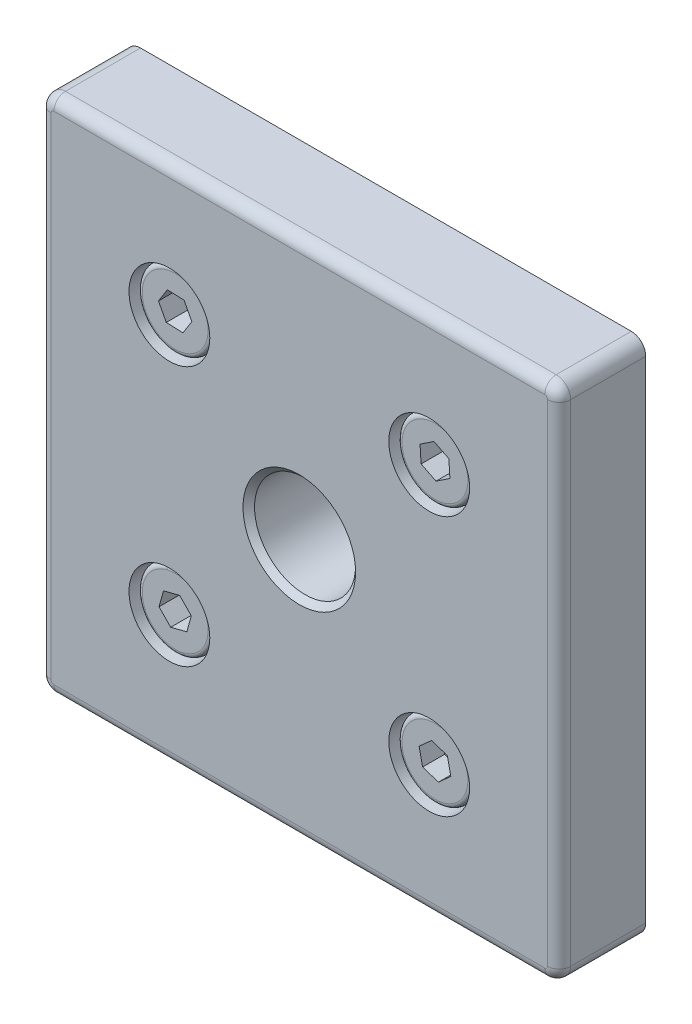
ISO-10303-21;
HEADER;
FILE_DESCRIPTION(('STEP AP214'),'2;1');
FILE_NAME('part.step','',(''),(''),'','','');
FILE_SCHEMA(('AUTOMOTIVE_DESIGN { 1 0 10303 214 1 1 1 1 }'));
ENDSEC;
DATA;
#1=APPLICATION_CONTEXT('core data for automotive mechanical design processes');
#2=APPLICATION_PROTOCOL_DEFINITION('international standard','automotive_design',2000,#1);
#3=PRODUCT_CONTEXT('',#1,'mechanical');
#4=PRODUCT('Part','Part','',(#3));
#5=PRODUCT_RELATED_PRODUCT_CATEGORY('part','',(#4));
#6=PRODUCT_DEFINITION_FORMATION('','',#4);
#7=PRODUCT_DEFINITION_CONTEXT('part definition',#1,'design');
#8=PRODUCT_DEFINITION('design','',#6,#7);
#9=PRODUCT_DEFINITION_SHAPE('','',#8);
#10=(LENGTH_UNIT() NAMED_UNIT(*) SI_UNIT(.MILLI.,.METRE.));
#11=(NAMED_UNIT(*) PLANE_ANGLE_UNIT() SI_UNIT($,.RADIAN.));
#12=(NAMED_UNIT(*) SI_UNIT($,.STERADIAN.) SOLID_ANGLE_UNIT());
#13=UNCERTAINTY_MEASURE_WITH_UNIT(LENGTH_MEASURE(1.E-05),#10,'distance_accuracy_value','');
#14=(GEOMETRIC_REPRESENTATION_CONTEXT(3) GLOBAL_UNCERTAINTY_ASSIGNED_CONTEXT((#13)) GLOBAL_UNIT_ASSIGNED_CONTEXT((#10,
#11,#12)) REPRESENTATION_CONTEXT('',''));
#15=CARTESIAN_POINT('',(0.,0.,0.));
#16=DIRECTION('',(0.,0.,1.));
#17=DIRECTION('',(1.,0.,0.));
#18=AXIS2_PLACEMENT_3D('',#15,#16,#17);
#19=CARTESIAN_POINT('',(15.9986417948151,34.1008295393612,-1.75075426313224));
#20=DIRECTION('',(0.,0.,1.));
#21=DIRECTION('',(0.444841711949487,0.895609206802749,0.));
#22=AXIS2_PLACEMENT_3D('',#19,#20,#21);
#23=CONICAL_SURFACE('',#22,2.5,1.0471975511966);
#24=DIRECTION('',(-0.385244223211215,-0.77562032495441,0.5));
#25=VECTOR('',#24,1.);
#26=CARTESIAN_POINT('',(14.8865375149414,31.8618065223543,-1.75075426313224));
#27=LINE('',#26,#25);
#28=CARTESIAN_POINT('',(15.9986417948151,34.1008295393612,-3.19412993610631));
#29=VERTEX_POINT('',#28);
#30=CARTESIAN_POINT('',(14.8865375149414,31.8618065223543,-1.75075426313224));
#31=VERTEX_POINT('',#30);
#32=EDGE_CURVE('P0_E332',#29,#31,#27,.T.);
#33=ORIENTED_EDGE('',*,*,#32,.F.);
#34=DIRECTION('',(0.385244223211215,0.77562032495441,0.5));
#35=VECTOR('',#34,1.);
#36=CARTESIAN_POINT('',(17.1107460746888,36.3398525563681,-1.75075426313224));
#37=LINE('',#36,#35);
#38=CARTESIAN_POINT('',(17.1107460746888,36.3398525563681,-1.75075426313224));
#39=VERTEX_POINT('',#38);
#40=EDGE_CURVE('P0_E335',#29,#39,#37,.T.);
#41=ORIENTED_EDGE('',*,*,#40,.T.);
#42=CARTESIAN_POINT('',(15.9986417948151,34.1008295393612,-1.75075426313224));
#43=DIRECTION('',(0.,0.,1.));
#44=DIRECTION('',(0.444841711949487,0.895609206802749,0.));
#45=AXIS2_PLACEMENT_3D('',#42,#43,#44);
#46=CIRCLE('',#45,2.5);
#47=CARTESIAN_POINT('',(14.6156431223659,36.1834516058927,-1.75075426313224));
#48=VERTEX_POINT('',#47);
#49=EDGE_CURVE('P0_E10',#39,#48,#46,.T.);
#50=ORIENTED_EDGE('',*,*,#49,.T.);
#51=CARTESIAN_POINT('',(15.9986417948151,34.1008295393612,-1.75075426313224));
#52=DIRECTION('',(0.,0.,1.));
#53=DIRECTION('',(0.444841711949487,0.895609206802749,0.));
#54=AXIS2_PLACEMENT_3D('',#51,#52,#53);
#55=CIRCLE('',#54,2.5);
#56=CARTESIAN_POINT('',(13.5035388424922,33.9444285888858,-1.75075426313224));
#57=VERTEX_POINT('',#56);
#58=EDGE_CURVE('P0_E25',#48,#57,#55,.T.);
#59=ORIENTED_EDGE('',*,*,#58,.T.);
#60=CARTESIAN_POINT('',(15.9986417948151,34.1008295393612,-1.75075426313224));
#61=DIRECTION('',(0.,0.,1.));
#62=DIRECTION('',(0.444841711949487,0.895609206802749,0.));
#63=AXIS2_PLACEMENT_3D('',#60,#61,#62);
#64=CIRCLE('',#63,2.5);
#65=EDGE_CURVE('P0_E18',#57,#31,#64,.T.);
#66=ORIENTED_EDGE('',*,*,#65,.T.);
#67=EDGE_LOOP('',(#33,#41,#50,#59,#66));
#68=FACE_BOUND('',#67,.T.);
#69=ADVANCED_FACE('P0_F15',(#68),#23,.F.);
#70=CARTESIAN_POINT('',(15.8180455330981,36.9819262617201,-1.75075426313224));
#71=DIRECTION('',(0.,0.,1.));
#72=DIRECTION('',(0.444841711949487,0.895609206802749,0.));
#73=AXIS2_PLACEMENT_3D('',#70,#71,#72);
#74=PLANE('',#73);
#75=ORIENTED_EDGE('',*,*,#49,.F.);
#76=DIRECTION('',(-0.89560920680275,0.444841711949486,0.));
#77=VECTOR('',#76,1.);
#78=CARTESIAN_POINT('',(18.4034466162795,35.6977788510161,-1.75075426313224));
#79=LINE('',#78,#77);
#80=CARTESIAN_POINT('',(15.8180455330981,36.9819262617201,-1.75075426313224));
#81=VERTEX_POINT('',#80);
#82=EDGE_CURVE('P0_E293',#39,#81,#79,.T.);
#83=ORIENTED_EDGE('',*,*,#82,.T.);
#84=DIRECTION('',(0.833048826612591,0.553199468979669,0.));
#85=VECTOR('',#84,1.);
#86=CARTESIAN_POINT('',(13.4132407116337,35.3849769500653,-1.75075426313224));
#87=LINE('',#86,#85);
#88=EDGE_CURVE('P0_E274',#48,#81,#87,.T.);
#89=ORIENTED_EDGE('',*,*,#88,.F.);
#90=EDGE_LOOP('',(#75,#83,#89));
#91=FACE_BOUND('',#90,.T.);
#92=ADVANCED_FACE('P0_F602',(#91),#74,.T.);
#93=CARTESIAN_POINT('',(15.8180455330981,36.9819262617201,-1.75075426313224));
#94=DIRECTION('',(0.,0.,1.));
#95=DIRECTION('',(0.444841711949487,0.895609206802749,0.));
#96=AXIS2_PLACEMENT_3D('',#93,#94,#95);
#97=PLANE('',#96);
#98=ORIENTED_EDGE('',*,*,#58,.F.);
#99=DIRECTION('',(0.833048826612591,0.553199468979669,0.));
#100=VECTOR('',#99,1.);
#101=CARTESIAN_POINT('',(13.4132407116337,35.3849769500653,-1.75075426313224));
#102=LINE('',#101,#100);
#103=CARTESIAN_POINT('',(13.4132407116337,35.3849769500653,-1.75075426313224));
#104=VERTEX_POINT('',#103);
#105=EDGE_CURVE('P0_E270',#104,#48,#102,.T.);
#106=ORIENTED_EDGE('',*,*,#105,.F.);
#107=DIRECTION('',(0.0625603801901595,-0.998041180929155,0.));
#108=VECTOR('',#107,1.);
#109=CARTESIAN_POINT('',(13.4132407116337,35.3849769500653,-1.75075426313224));
#110=LINE('',#109,#108);
#111=EDGE_CURVE('P0_E206',#104,#57,#110,.T.);
#112=ORIENTED_EDGE('',*,*,#111,.T.);
#113=EDGE_LOOP('',(#98,#106,#112));
#114=FACE_BOUND('',#113,.T.);
#115=ADVANCED_FACE('P0_F603',(#114),#97,.T.);
#116=CARTESIAN_POINT('',(15.8180455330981,36.9819262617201,-1.75075426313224));
#117=DIRECTION('',(0.,0.,1.));
#118=DIRECTION('',(0.444841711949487,0.895609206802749,0.));
#119=AXIS2_PLACEMENT_3D('',#116,#117,#118);
#120=PLANE('',#119);
#121=ORIENTED_EDGE('',*,*,#65,.F.);
#122=DIRECTION('',(0.0625603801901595,-0.998041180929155,0.));
#123=VECTOR('',#122,1.);
#124=CARTESIAN_POINT('',(13.4132407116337,35.3849769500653,-1.75075426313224));
#125=LINE('',#124,#123);
#126=CARTESIAN_POINT('',(13.5938369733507,32.5038802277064,-1.75075426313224));
#127=VERTEX_POINT('',#126);
#128=EDGE_CURVE('P0_E204',#57,#127,#125,.T.);
#129=ORIENTED_EDGE('',*,*,#128,.T.);
#130=DIRECTION('',(0.89560920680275,-0.444841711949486,0.));
#131=VECTOR('',#130,1.);
#132=CARTESIAN_POINT('',(13.5938369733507,32.5038802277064,-1.75075426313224));
#133=LINE('',#132,#131);
#134=EDGE_CURVE('P0_E174',#127,#31,#133,.T.);
#135=ORIENTED_EDGE('',*,*,#134,.T.);
#136=EDGE_LOOP('',(#121,#129,#135));
#137=FACE_BOUND('',#136,.T.);
#138=ADVANCED_FACE('P0_F613',(#137),#120,.T.);
#139=CARTESIAN_POINT('',(15.8180455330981,36.9819262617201,-1.75075426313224));
#140=DIRECTION('',(0.,0.,1.));
#141=DIRECTION('',(0.444841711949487,0.895609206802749,0.));
#142=AXIS2_PLACEMENT_3D('',#139,#140,#141);
#143=PLANE('',#142);
#144=CARTESIAN_POINT('',(15.9986417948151,34.1008295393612,-1.75075426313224));
#145=DIRECTION('',(0.,0.,1.));
#146=DIRECTION('',(0.444841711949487,0.895609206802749,0.));
#147=AXIS2_PLACEMENT_3D('',#144,#145,#146);
#148=CIRCLE('',#147,2.5);
#149=CARTESIAN_POINT('',(17.3816404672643,32.0182074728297,-1.75075426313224));
#150=VERTEX_POINT('',#149);
#151=EDGE_CURVE('P0_E169',#31,#150,#148,.T.);
#152=ORIENTED_EDGE('',*,*,#151,.F.);
#153=DIRECTION('',(0.89560920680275,-0.444841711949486,0.));
#154=VECTOR('',#153,1.);
#155=CARTESIAN_POINT('',(13.5938369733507,32.5038802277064,-1.75075426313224));
#156=LINE('',#155,#154);
#157=CARTESIAN_POINT('',(16.1792380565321,31.2197328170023,-1.75075426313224));
#158=VERTEX_POINT('',#157);
#159=EDGE_CURVE('P0_E162',#31,#158,#156,.T.);
#160=ORIENTED_EDGE('',*,*,#159,.T.);
#161=DIRECTION('',(-0.833048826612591,-0.553199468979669,0.));
#162=VECTOR('',#161,1.);
#163=CARTESIAN_POINT('',(18.5840428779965,32.8166821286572,-1.75075426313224));
#164=LINE('',#163,#162);
#165=EDGE_CURVE('P0_E166',#150,#158,#164,.T.);
#166=ORIENTED_EDGE('',*,*,#165,.F.);
#167=EDGE_LOOP('',(#152,#160,#166));
#168=FACE_BOUND('',#167,.T.);
#169=ADVANCED_FACE('P0_F164',(#168),#143,.T.);
#170=CARTESIAN_POINT('',(15.8180455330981,36.9819262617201,-1.75075426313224));
#171=DIRECTION('',(0.,0.,1.));
#172=DIRECTION('',(0.444841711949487,0.895609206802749,0.));
#173=AXIS2_PLACEMENT_3D('',#170,#171,#172);
#174=PLANE('',#173);
#175=CARTESIAN_POINT('',(15.9986417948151,34.1008295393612,-1.75075426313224));
#176=DIRECTION('',(0.,0.,1.));
#177=DIRECTION('',(0.444841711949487,0.895609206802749,0.));
#178=AXIS2_PLACEMENT_3D('',#175,#176,#177);
#179=CIRCLE('',#178,2.5);
#180=CARTESIAN_POINT('',(18.493744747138,34.2572304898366,-1.75075426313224));
#181=VERTEX_POINT('',#180);
#182=EDGE_CURVE('P0_E316',#150,#181,#179,.T.);
#183=ORIENTED_EDGE('',*,*,#182,.F.);
#184=DIRECTION('',(-0.833048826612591,-0.553199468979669,0.));
#185=VECTOR('',#184,1.);
#186=CARTESIAN_POINT('',(18.5840428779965,32.8166821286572,-1.75075426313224));
#187=LINE('',#186,#185);
#188=CARTESIAN_POINT('',(18.5840428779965,32.8166821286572,-1.75075426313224));
#189=VERTEX_POINT('',#188);
#190=EDGE_CURVE('P0_E188',#189,#150,#187,.T.);
#191=ORIENTED_EDGE('',*,*,#190,.F.);
#192=DIRECTION('',(0.0625603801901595,-0.998041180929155,0.));
#193=VECTOR('',#192,1.);
#194=CARTESIAN_POINT('',(18.4034466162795,35.6977788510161,-1.75075426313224));
#195=LINE('',#194,#193);
#196=EDGE_CURVE('P0_E290',#181,#189,#195,.T.);
#197=ORIENTED_EDGE('',*,*,#196,.F.);
#198=EDGE_LOOP('',(#183,#191,#197));
#199=FACE_BOUND('',#198,.T.);
#200=ADVANCED_FACE('P0_F314',(#199),#174,.T.);
#201=CARTESIAN_POINT('',(15.8180455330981,36.9819262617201,-1.75075426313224));
#202=DIRECTION('',(0.,0.,1.));
#203=DIRECTION('',(0.444841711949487,0.895609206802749,0.));
#204=AXIS2_PLACEMENT_3D('',#201,#202,#203);
#205=PLANE('',#204);
#206=CARTESIAN_POINT('',(15.9986417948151,34.1008295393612,-1.75075426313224));
#207=DIRECTION('',(0.,0.,1.));
#208=DIRECTION('',(0.444841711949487,0.895609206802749,0.));
#209=AXIS2_PLACEMENT_3D('',#206,#207,#208);
#210=CIRCLE('',#209,2.5);
#211=EDGE_CURVE('P0_E343',#181,#39,#210,.T.);
#212=ORIENTED_EDGE('',*,*,#211,.F.);
#213=DIRECTION('',(0.0625603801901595,-0.998041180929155,0.));
#214=VECTOR('',#213,1.);
#215=CARTESIAN_POINT('',(18.4034466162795,35.6977788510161,-1.75075426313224));
#216=LINE('',#215,#214);
#217=CARTESIAN_POINT('',(18.4034466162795,35.6977788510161,-1.75075426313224));
#218=VERTEX_POINT('',#217);
#219=EDGE_CURVE('P0_E301',#218,#181,#216,.T.);
#220=ORIENTED_EDGE('',*,*,#219,.F.);
#221=DIRECTION('',(-0.89560920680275,0.444841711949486,0.));
#222=VECTOR('',#221,1.);
#223=CARTESIAN_POINT('',(18.4034466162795,35.6977788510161,-1.75075426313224));
#224=LINE('',#223,#222);
#225=EDGE_CURVE('P0_E296',#218,#39,#224,.T.);
#226=ORIENTED_EDGE('',*,*,#225,.T.);
#227=EDGE_LOOP('',(#212,#220,#226));
#228=FACE_BOUND('',#227,.T.);
#229=ADVANCED_FACE('P0_F594',(#228),#205,.T.);
#230=CARTESIAN_POINT('',(13.4132407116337,35.3849769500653,-1.75075426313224));
#231=DIRECTION('',(-0.998041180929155,-0.0625603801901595,0.));
#232=DIRECTION('',(0.,0.,1.));
#233=AXIS2_PLACEMENT_3D('',#230,#231,#232);
#234=PLANE('',#233);
#235=DIRECTION('',(0.0625603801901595,-0.998041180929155,0.));
#236=VECTOR('',#235,1.);
#237=CARTESIAN_POINT('',(13.4132407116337,35.3849769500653,2.04924573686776));
#238=LINE('',#237,#236);
#239=CARTESIAN_POINT('',(13.4132407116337,35.3849769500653,2.04924573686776));
#240=VERTEX_POINT('',#239);
#241=CARTESIAN_POINT('',(13.5938369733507,32.5038802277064,2.04924573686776));
#242=VERTEX_POINT('',#241);
#243=EDGE_CURVE('P0_E259',#240,#242,#238,.T.);
#244=ORIENTED_EDGE('',*,*,#243,.T.);
#245=DIRECTION('',(0.,0.,1.));
#246=VECTOR('',#245,1.);
#247=CARTESIAN_POINT('',(13.5938369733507,32.5038802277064,-1.75075426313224));
#248=LINE('',#247,#246);
#249=EDGE_CURVE('P0_E202',#127,#242,#248,.T.);
#250=ORIENTED_EDGE('',*,*,#249,.F.);
#251=ORIENTED_EDGE('',*,*,#128,.F.);
#252=ORIENTED_EDGE('',*,*,#111,.F.);
#253=DIRECTION('',(0.,0.,1.));
#254=VECTOR('',#253,1.);
#255=CARTESIAN_POINT('',(13.4132407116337,35.3849769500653,-1.75075426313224));
#256=LINE('',#255,#254);
#257=EDGE_CURVE('P0_E275',#104,#240,#256,.T.);
#258=ORIENTED_EDGE('',*,*,#257,.T.);
#259=EDGE_LOOP('',(#244,#250,#251,#252,#258));
#260=FACE_BOUND('',#259,.T.);
#261=ADVANCED_FACE('P0_F610',(#260),#234,.F.);
#262=CARTESIAN_POINT('',(13.5938369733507,32.5038802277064,-1.75075426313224));
#263=DIRECTION('',(-0.444841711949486,-0.89560920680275,0.));
#264=DIRECTION('',(0.89560920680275,-0.444841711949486,0.));
#265=AXIS2_PLACEMENT_3D('',#262,#263,#264);
#266=PLANE('',#265);
#267=DIRECTION('',(0.89560920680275,-0.444841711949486,0.));
#268=VECTOR('',#267,1.);
#269=CARTESIAN_POINT('',(13.5938369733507,32.5038802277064,2.04924573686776));
#270=LINE('',#269,#268);
#271=CARTESIAN_POINT('',(16.1792380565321,31.2197328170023,2.04924573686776));
#272=VERTEX_POINT('',#271);
#273=EDGE_CURVE('P0_E180',#242,#272,#270,.T.);
#274=ORIENTED_EDGE('',*,*,#273,.T.);
#275=DIRECTION('',(0.,0.,1.));
#276=VECTOR('',#275,1.);
#277=CARTESIAN_POINT('',(16.1792380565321,31.2197328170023,-1.75075426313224));
#278=LINE('',#277,#276);
#279=EDGE_CURVE('P0_E175',#158,#272,#278,.T.);
#280=ORIENTED_EDGE('',*,*,#279,.F.);
#281=ORIENTED_EDGE('',*,*,#159,.F.);
#282=ORIENTED_EDGE('',*,*,#134,.F.);
#283=ORIENTED_EDGE('',*,*,#249,.T.);
#284=EDGE_LOOP('',(#274,#280,#281,#282,#283));
#285=FACE_BOUND('',#284,.T.);
#286=ADVANCED_FACE('P0_F178',(#285),#266,.F.);
#287=CARTESIAN_POINT('',(18.5840428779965,32.8166821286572,-1.75075426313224));
#288=DIRECTION('',(-0.553199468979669,0.833048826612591,0.));
#289=DIRECTION('',(0.,0.,-1.));
#290=AXIS2_PLACEMENT_3D('',#287,#288,#289);
#291=PLANE('',#290);
#292=DIRECTION('',(-0.833048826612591,-0.553199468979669,0.));
#293=VECTOR('',#292,1.);
#294=CARTESIAN_POINT('',(18.5840428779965,32.8166821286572,2.04924573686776));
#295=LINE('',#294,#293);
#296=CARTESIAN_POINT('',(18.5840428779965,32.8166821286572,2.04924573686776));
#297=VERTEX_POINT('',#296);
#298=EDGE_CURVE('P0_E253',#297,#272,#295,.T.);
#299=ORIENTED_EDGE('',*,*,#298,.F.);
#300=DIRECTION('',(0.,0.,1.));
#301=VECTOR('',#300,1.);
#302=CARTESIAN_POINT('',(18.5840428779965,32.8166821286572,-1.75075426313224));
#303=LINE('',#302,#301);
#304=EDGE_CURVE('P0_E196',#189,#297,#303,.T.);
#305=ORIENTED_EDGE('',*,*,#304,.F.);
#306=ORIENTED_EDGE('',*,*,#190,.T.);
#307=ORIENTED_EDGE('',*,*,#165,.T.);
#308=ORIENTED_EDGE('',*,*,#279,.T.);
#309=EDGE_LOOP('',(#299,#305,#306,#307,#308));
#310=FACE_BOUND('',#309,.T.);
#311=ADVANCED_FACE('P0_F186',(#310),#291,.T.);
#312=CARTESIAN_POINT('',(18.4034466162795,35.6977788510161,-1.75075426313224));
#313=DIRECTION('',(-0.998041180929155,-0.0625603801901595,0.));
#314=DIRECTION('',(0.,0.,1.));
#315=AXIS2_PLACEMENT_3D('',#312,#313,#314);
#316=PLANE('',#315);
#317=DIRECTION('',(0.0625603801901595,-0.998041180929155,0.));
#318=VECTOR('',#317,1.);
#319=CARTESIAN_POINT('',(18.4034466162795,35.6977788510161,2.04924573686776));
#320=LINE('',#319,#318);
#321=CARTESIAN_POINT('',(18.4034466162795,35.6977788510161,2.04924573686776));
#322=VERTEX_POINT('',#321);
#323=EDGE_CURVE('P0_E256',#322,#297,#320,.T.);
#324=ORIENTED_EDGE('',*,*,#323,.F.);
#325=DIRECTION('',(0.,0.,1.));
#326=VECTOR('',#325,1.);
#327=CARTESIAN_POINT('',(18.4034466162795,35.6977788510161,-1.75075426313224));
#328=LINE('',#327,#326);
#329=EDGE_CURVE('P0_E300',#218,#322,#328,.T.);
#330=ORIENTED_EDGE('',*,*,#329,.F.);
#331=ORIENTED_EDGE('',*,*,#219,.T.);
#332=ORIENTED_EDGE('',*,*,#196,.T.);
#333=ORIENTED_EDGE('',*,*,#304,.T.);
#334=EDGE_LOOP('',(#324,#330,#331,#332,#333));
#335=FACE_BOUND('',#334,.T.);
#336=ADVANCED_FACE('P0_F310',(#335),#316,.T.);
#337=CARTESIAN_POINT('',(18.4034466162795,35.6977788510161,-1.75075426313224));
#338=DIRECTION('',(0.444841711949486,0.89560920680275,0.));
#339=DIRECTION('',(0.89560920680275,-0.444841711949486,0.));
#340=AXIS2_PLACEMENT_3D('',#337,#338,#339);
#341=PLANE('',#340);
#342=DIRECTION('',(-0.89560920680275,0.444841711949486,0.));
#343=VECTOR('',#342,1.);
#344=CARTESIAN_POINT('',(18.4034466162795,35.6977788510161,2.04924573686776));
#345=LINE('',#344,#343);
#346=CARTESIAN_POINT('',(15.8180455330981,36.9819262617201,2.04924573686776));
#347=VERTEX_POINT('',#346);
#348=EDGE_CURVE('P0_E250',#322,#347,#345,.T.);
#349=ORIENTED_EDGE('',*,*,#348,.T.);
#350=DIRECTION('',(0.,0.,1.));
#351=VECTOR('',#350,1.);
#352=CARTESIAN_POINT('',(15.8180455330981,36.9819262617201,-1.75075426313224));
#353=LINE('',#352,#351);
#354=EDGE_CURVE('P0_E287',#81,#347,#353,.T.);
#355=ORIENTED_EDGE('',*,*,#354,.F.);
#356=ORIENTED_EDGE('',*,*,#82,.F.);
#357=ORIENTED_EDGE('',*,*,#225,.F.);
#358=ORIENTED_EDGE('',*,*,#329,.T.);
#359=EDGE_LOOP('',(#349,#355,#356,#357,#358));
#360=FACE_BOUND('',#359,.T.);
#361=ADVANCED_FACE('P0_F599',(#360),#341,.F.);
#362=CARTESIAN_POINT('',(13.4132407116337,35.3849769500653,-1.75075426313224));
#363=DIRECTION('',(0.553199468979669,-0.833048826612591,0.));
#364=DIRECTION('',(-0.833048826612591,-0.553199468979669,0.));
#365=AXIS2_PLACEMENT_3D('',#362,#363,#364);
#366=PLANE('',#365);
#367=DIRECTION('',(0.833048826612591,0.553199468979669,0.));
#368=VECTOR('',#367,1.);
#369=CARTESIAN_POINT('',(13.4132407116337,35.3849769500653,2.04924573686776));
#370=LINE('',#369,#368);
#371=EDGE_CURVE('P0_E246',#240,#347,#370,.T.);
#372=ORIENTED_EDGE('',*,*,#371,.F.);
#373=ORIENTED_EDGE('',*,*,#257,.F.);
#374=ORIENTED_EDGE('',*,*,#105,.T.);
#375=ORIENTED_EDGE('',*,*,#88,.T.);
#376=ORIENTED_EDGE('',*,*,#354,.T.);
#377=EDGE_LOOP('',(#372,#373,#374,#375,#376));
#378=FACE_BOUND('',#377,.T.);
#379=ADVANCED_FACE('P0_F607',(#378),#366,.T.);
#380=CARTESIAN_POINT('',(15.9986417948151,34.1008295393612,1.24924573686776));
#381=DIRECTION('',(0.,0.,1.));
#382=DIRECTION('',(0.444841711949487,0.895609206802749,0.));
#383=AXIS2_PLACEMENT_3D('',#380,#381,#382);
#384=TOROIDAL_SURFACE('',#383,5.7,0.8);
#385=CARTESIAN_POINT('',(13.463044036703,28.9958570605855,1.24924573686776));
#386=DIRECTION('',(-0.895609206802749,0.444841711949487,0.));
#387=DIRECTION('',(0.444841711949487,0.895609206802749,0.));
#388=AXIS2_PLACEMENT_3D('',#385,#386,#387);
#389=CIRCLE('',#388,0.8);
#390=CARTESIAN_POINT('',(13.1071706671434,28.2793696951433,1.24924573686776));
#391=VERTEX_POINT('',#390);
#392=CARTESIAN_POINT('',(13.463044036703,28.9958570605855,2.04924573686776));
#393=VERTEX_POINT('',#392);
#394=EDGE_CURVE('P0_E342',#391,#393,#389,.T.);
#395=ORIENTED_EDGE('',*,*,#394,.F.);
#396=CARTESIAN_POINT('',(15.9986417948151,34.1008295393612,1.24924573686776));
#397=DIRECTION('',(0.,0.,-1.));
#398=DIRECTION('',(0.444841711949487,0.895609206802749,0.));
#399=AXIS2_PLACEMENT_3D('',#396,#397,#398);
#400=CIRCLE('',#399,6.5);
#401=CARTESIAN_POINT('',(18.8901129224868,39.9222893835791,1.24924573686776));
#402=VERTEX_POINT('',#401);
#403=EDGE_CURVE('P0_E266',#402,#391,#400,.T.);
#404=ORIENTED_EDGE('',*,*,#403,.F.);
#405=CARTESIAN_POINT('',(18.5342395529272,39.2058020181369,1.24924573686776));
#406=DIRECTION('',(0.895609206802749,-0.444841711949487,0.));
#407=DIRECTION('',(-0.444841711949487,-0.895609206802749,0.));
#408=AXIS2_PLACEMENT_3D('',#405,#406,#407);
#409=CIRCLE('',#408,0.8);
#410=CARTESIAN_POINT('',(18.5342395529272,39.2058020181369,2.04924573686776));
#411=VERTEX_POINT('',#410);
#412=EDGE_CURVE('P0_E361',#402,#411,#409,.T.);
#413=ORIENTED_EDGE('',*,*,#412,.T.);
#414=CARTESIAN_POINT('',(15.9986417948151,34.1008295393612,2.04924573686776));
#415=DIRECTION('',(0.,0.,1.));
#416=DIRECTION('',(0.444841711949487,0.895609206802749,0.));
#417=AXIS2_PLACEMENT_3D('',#414,#415,#416);
#418=CIRCLE('',#417,5.7);
#419=EDGE_CURVE('P0_E243',#393,#411,#418,.T.);
#420=ORIENTED_EDGE('',*,*,#419,.F.);
#421=EDGE_LOOP('',(#395,#404,#413,#420));
#422=FACE_BOUND('',#421,.T.);
#423=ADVANCED_FACE('P0_F643',(#422),#384,.T.);
#424=CARTESIAN_POINT('',(15.9986417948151,34.1008295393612,-3.35075426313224));
#425=DIRECTION('',(0.,0.,-1.));
#426=DIRECTION('',(-0.444841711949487,-0.895609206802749,0.));
#427=AXIS2_PLACEMENT_3D('',#424,#425,#426);
#428=TOROIDAL_SURFACE('',#427,4.39999999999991,0.4);
#429=CARTESIAN_POINT('',(17.9559453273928,38.0415100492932,-3.35075426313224));
#430=DIRECTION('',(-0.895609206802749,0.444841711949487,0.));
#431=DIRECTION('',(0.444841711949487,0.895609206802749,0.));
#432=AXIS2_PLACEMENT_3D('',#429,#430,#431);
#433=CIRCLE('',#432,0.4);
#434=CARTESIAN_POINT('',(17.778008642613,37.6832663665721,-3.35075426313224));
#435=VERTEX_POINT('',#434);
#436=CARTESIAN_POINT('',(17.9559453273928,38.0415100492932,-2.95075426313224));
#437=VERTEX_POINT('',#436);
#438=EDGE_CURVE('P0_E371',#435,#437,#433,.T.);
#439=ORIENTED_EDGE('',*,*,#438,.F.);
#440=CARTESIAN_POINT('',(15.9986417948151,34.1008295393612,-3.35075426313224));
#441=DIRECTION('',(0.,0.,-1.));
#442=DIRECTION('',(-0.444841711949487,-0.895609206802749,0.));
#443=AXIS2_PLACEMENT_3D('',#440,#441,#442);
#444=CIRCLE('',#443,3.99999999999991);
#445=CARTESIAN_POINT('',(14.2192749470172,30.5183927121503,-3.35075426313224));
#446=VERTEX_POINT('',#445);
#447=EDGE_CURVE('P0_E226',#446,#435,#444,.T.);
#448=ORIENTED_EDGE('',*,*,#447,.F.);
#449=CARTESIAN_POINT('',(14.0413382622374,30.1601490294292,-3.35075426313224));
#450=DIRECTION('',(0.895609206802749,-0.444841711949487,0.));
#451=DIRECTION('',(-0.444841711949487,-0.895609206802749,0.));
#452=AXIS2_PLACEMENT_3D('',#449,#450,#451);
#453=CIRCLE('',#452,0.4);
#454=CARTESIAN_POINT('',(14.0413382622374,30.1601490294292,-2.95075426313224));
#455=VERTEX_POINT('',#454);
#456=EDGE_CURVE('P0_E353',#446,#455,#453,.T.);
#457=ORIENTED_EDGE('',*,*,#456,.T.);
#458=CARTESIAN_POINT('',(15.9986417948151,34.1008295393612,-2.95075426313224));
#459=DIRECTION('',(0.,0.,1.));
#460=DIRECTION('',(-0.444841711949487,-0.895609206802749,0.));
#461=AXIS2_PLACEMENT_3D('',#458,#459,#460);
#462=CIRCLE('',#461,4.39999999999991);
#463=EDGE_CURVE('P0_E269',#437,#455,#462,.T.);
#464=ORIENTED_EDGE('',*,*,#463,.F.);
#465=EDGE_LOOP('',(#439,#448,#457,#464));
#466=FACE_BOUND('',#465,.T.);
#467=ADVANCED_FACE('P0_F646',(#466),#428,.F.);
#468=CARTESIAN_POINT('',(13.0346231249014,35.573033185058,-27.9507542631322));
#469=DIRECTION('',(0.,0.,-1.));
#470=DIRECTION('',(-0.895609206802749,0.444841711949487,0.));
#471=AXIS2_PLACEMENT_3D('',#468,#469,#470);
#472=PLANE('',#471);
#473=CARTESIAN_POINT('',(15.9986417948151,34.1008295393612,-27.9507542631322));
#474=DIRECTION('',(0.,0.,1.));
#475=DIRECTION('',(0.444841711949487,0.895609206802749,0.));
#476=AXIS2_PLACEMENT_3D('',#473,#474,#475);
#477=CIRCLE('',#476,3.3095);
#478=CARTESIAN_POINT('',(17.4708454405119,37.0648482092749,-27.9507542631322));
#479=VERTEX_POINT('',#478);
#480=CARTESIAN_POINT('',(14.5264381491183,31.1368108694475,-27.9507542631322));
#481=VERTEX_POINT('',#480);
#482=EDGE_CURVE('P0_E349',#479,#481,#477,.T.);
#483=ORIENTED_EDGE('',*,*,#482,.F.);
#484=CARTESIAN_POINT('',(15.9986417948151,34.1008295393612,-27.9507542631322));
#485=DIRECTION('',(0.,0.,1.));
#486=DIRECTION('',(0.444841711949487,0.895609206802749,0.));
#487=AXIS2_PLACEMENT_3D('',#484,#485,#486);
#488=CIRCLE('',#487,3.3095);
#489=EDGE_CURVE('P0_E279',#481,#479,#488,.T.);
#490=ORIENTED_EDGE('',*,*,#489,.F.);
#491=EDGE_LOOP('',(#483,#490));
#492=FACE_BOUND('',#491,.T.);
#493=ADVANCED_FACE('P0_F652',(#492),#472,.T.);
#494=CARTESIAN_POINT('',(15.9986417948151,34.1008295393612,-27.9507542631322));
#495=DIRECTION('',(0.,0.,1.));
#496=DIRECTION('',(0.444841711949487,0.895609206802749,0.));
#497=AXIS2_PLACEMENT_3D('',#494,#495,#496);
#498=CONICAL_SURFACE('',#497,3.3095,0.785398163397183);
#499=DIRECTION('',(-0.314550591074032,-0.633291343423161,0.707106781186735));
#500=VECTOR('',#499,1.);
#501=CARTESIAN_POINT('',(14.5264381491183,31.1368108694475,-27.9507542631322));
#502=LINE('',#501,#500);
#503=CARTESIAN_POINT('',(14.2192749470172,30.5183927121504,-27.2602542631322));
#504=VERTEX_POINT('',#503);
#505=EDGE_CURVE('P0_E344',#481,#504,#502,.T.);
#506=ORIENTED_EDGE('',*,*,#505,.F.);
#507=ORIENTED_EDGE('',*,*,#489,.T.);
#508=DIRECTION('',(0.314550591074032,0.633291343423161,0.707106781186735));
#509=VECTOR('',#508,1.);
#510=CARTESIAN_POINT('',(17.4708454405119,37.0648482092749,-27.9507542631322));
#511=LINE('',#510,#509);
#512=CARTESIAN_POINT('',(17.778008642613,37.683266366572,-27.2602542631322));
#513=VERTEX_POINT('',#512);
#514=EDGE_CURVE('P0_E383',#479,#513,#511,.T.);
#515=ORIENTED_EDGE('',*,*,#514,.T.);
#516=CARTESIAN_POINT('',(15.9986417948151,34.1008295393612,-27.2602542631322));
#517=DIRECTION('',(0.,0.,1.));
#518=DIRECTION('',(0.444841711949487,0.895609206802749,0.));
#519=AXIS2_PLACEMENT_3D('',#516,#517,#518);
#520=CIRCLE('',#519,3.99999999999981);
#521=EDGE_CURVE('P0_E276',#504,#513,#520,.T.);
#522=ORIENTED_EDGE('',*,*,#521,.F.);
#523=EDGE_LOOP('',(#506,#507,#515,#522));
#524=FACE_BOUND('',#523,.T.);
#525=ADVANCED_FACE('P0_F656',(#524),#498,.T.);
#526=CARTESIAN_POINT('',(15.9986417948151,34.1008295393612,33.7992457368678));
#527=DIRECTION('',(0.,0.,1.));
#528=DIRECTION('',(0.444841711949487,0.895609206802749,0.));
#529=AXIS2_PLACEMENT_3D('',#526,#527,#528);
#530=CYLINDRICAL_SURFACE('',#529,3.99999999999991);
#531=DIRECTION('',(0.,0.,1.));
#532=VECTOR('',#531,1.);
#533=CARTESIAN_POINT('',(14.2192749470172,30.5183927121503,33.7992457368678));
#534=LINE('',#533,#532);
#535=EDGE_CURVE('P0_E224',#504,#446,#534,.T.);
#536=ORIENTED_EDGE('',*,*,#535,.F.);
#537=ORIENTED_EDGE('',*,*,#521,.T.);
#538=DIRECTION('',(0.,0.,1.));
#539=VECTOR('',#538,1.);
#540=CARTESIAN_POINT('',(17.778008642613,37.6832663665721,33.7992457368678));
#541=LINE('',#540,#539);
#542=EDGE_CURVE('P0_E230',#513,#435,#541,.T.);
#543=ORIENTED_EDGE('',*,*,#542,.T.);
#544=CARTESIAN_POINT('',(15.9986417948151,34.1008295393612,-3.35075426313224));
#545=DIRECTION('',(0.,0.,-1.));
#546=DIRECTION('',(-0.444841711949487,-0.895609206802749,0.));
#547=AXIS2_PLACEMENT_3D('',#544,#545,#546);
#548=CIRCLE('',#547,3.99999999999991);
#549=EDGE_CURVE('P0_E365',#435,#446,#548,.T.);
#550=ORIENTED_EDGE('',*,*,#549,.T.);
#551=EDGE_LOOP('',(#536,#537,#543,#550));
#552=FACE_BOUND('',#551,.T.);
#553=ADVANCED_FACE('P0_F413',(#552),#530,.T.);
#554=CARTESIAN_POINT('',(10.1771819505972,36.9923006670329,-2.95075426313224));
#555=DIRECTION('',(0.,0.,-1.));
#556=DIRECTION('',(-0.895609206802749,0.444841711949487,0.));
#557=AXIS2_PLACEMENT_3D('',#554,#555,#556);
#558=PLANE('',#557);
#559=CARTESIAN_POINT('',(15.9986417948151,34.1008295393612,-2.95075426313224));
#560=DIRECTION('',(0.,0.,1.));
#561=DIRECTION('',(-0.444841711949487,-0.895609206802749,0.));
#562=AXIS2_PLACEMENT_3D('',#559,#560,#561);
#563=CIRCLE('',#562,4.39999999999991);
#564=EDGE_CURVE('P0_E375',#455,#437,#563,.T.);
#565=ORIENTED_EDGE('',*,*,#564,.T.);
#566=ORIENTED_EDGE('',*,*,#463,.T.);
#567=EDGE_LOOP('',(#565,#566));
#568=FACE_BOUND('',#567,.T.);
#569=CARTESIAN_POINT('',(15.9986417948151,34.1008295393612,-2.95075426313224));
#570=DIRECTION('',(0.,0.,1.));
#571=DIRECTION('',(0.444841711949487,0.895609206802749,0.));
#572=AXIS2_PLACEMENT_3D('',#569,#570,#571);
#573=CIRCLE('',#572,6.5);
#574=CARTESIAN_POINT('',(18.8901129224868,39.9222893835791,-2.95075426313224));
#575=VERTEX_POINT('',#574);
#576=CARTESIAN_POINT('',(13.1071706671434,28.2793696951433,-2.95075426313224));
#577=VERTEX_POINT('',#576);
#578=EDGE_CURVE('P0_E234',#575,#577,#573,.T.);
#579=ORIENTED_EDGE('',*,*,#578,.F.);
#580=CARTESIAN_POINT('',(15.9986417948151,34.1008295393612,-2.95075426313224));
#581=DIRECTION('',(0.,0.,1.));
#582=DIRECTION('',(0.444841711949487,0.895609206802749,0.));
#583=AXIS2_PLACEMENT_3D('',#580,#581,#582);
#584=CIRCLE('',#583,6.5);
#585=EDGE_CURVE('P0_E263',#577,#575,#584,.T.);
#586=ORIENTED_EDGE('',*,*,#585,.F.);
#587=EDGE_LOOP('',(#579,#586));
#588=FACE_BOUND('',#587,.T.);
#589=ADVANCED_FACE('P0_F662',(#568,#588),#558,.T.);
#590=CARTESIAN_POINT('',(15.9986417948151,34.1008295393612,33.7992457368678));
#591=DIRECTION('',(0.,0.,1.));
#592=DIRECTION('',(0.444841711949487,0.895609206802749,0.));
#593=AXIS2_PLACEMENT_3D('',#590,#591,#592);
#594=CYLINDRICAL_SURFACE('',#593,6.5);
#595=DIRECTION('',(0.,0.,1.));
#596=VECTOR('',#595,1.);
#597=CARTESIAN_POINT('',(13.1071706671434,28.2793696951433,33.7992457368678));
#598=LINE('',#597,#596);
#599=EDGE_CURVE('P0_E235',#577,#391,#598,.T.);
#600=ORIENTED_EDGE('',*,*,#599,.F.);
#601=ORIENTED_EDGE('',*,*,#585,.T.);
#602=DIRECTION('',(0.,0.,1.));
#603=VECTOR('',#602,1.);
#604=CARTESIAN_POINT('',(18.8901129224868,39.9222893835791,33.7992457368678));
#605=LINE('',#604,#603);
#606=EDGE_CURVE('P0_E239',#575,#402,#605,.T.);
#607=ORIENTED_EDGE('',*,*,#606,.T.);
#608=ORIENTED_EDGE('',*,*,#403,.T.);
#609=EDGE_LOOP('',(#600,#601,#607,#608));
#610=FACE_BOUND('',#609,.T.);
#611=ADVANCED_FACE('P0_F665',(#610),#594,.T.);
#612=CARTESIAN_POINT('',(15.9986417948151,34.1008295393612,2.04924573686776));
#613=DIRECTION('',(0.,0.,1.));
#614=DIRECTION('',(0.444841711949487,0.895609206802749,0.));
#615=AXIS2_PLACEMENT_3D('',#612,#613,#614);
#616=PLANE('',#615);
#617=ORIENTED_EDGE('',*,*,#371,.T.);
#618=ORIENTED_EDGE('',*,*,#348,.F.);
#619=ORIENTED_EDGE('',*,*,#323,.T.);
#620=ORIENTED_EDGE('',*,*,#298,.T.);
#621=ORIENTED_EDGE('',*,*,#273,.F.);
#622=ORIENTED_EDGE('',*,*,#243,.F.);
#623=EDGE_LOOP('',(#617,#618,#619,#620,#621,#622));
#624=FACE_BOUND('',#623,.T.);
#625=CARTESIAN_POINT('',(15.9986417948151,34.1008295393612,2.04924573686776));
#626=DIRECTION('',(0.,0.,1.));
#627=DIRECTION('',(0.444841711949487,0.895609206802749,0.));
#628=AXIS2_PLACEMENT_3D('',#625,#626,#627);
#629=CIRCLE('',#628,5.7);
#630=EDGE_CURVE('P0_E357',#411,#393,#629,.T.);
#631=ORIENTED_EDGE('',*,*,#630,.T.);
#632=ORIENTED_EDGE('',*,*,#419,.T.);
#633=EDGE_LOOP('',(#631,#632));
#634=FACE_BOUND('',#633,.T.);
#635=ADVANCED_FACE('P0_F320',(#624,#634),#616,.T.);
#636=CARTESIAN_POINT('',(15.9986417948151,34.1008295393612,33.7992457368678));
#637=DIRECTION('',(0.,0.,1.));
#638=DIRECTION('',(0.444841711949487,0.895609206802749,0.));
#639=AXIS2_PLACEMENT_3D('',#636,#637,#638);
#640=CYLINDRICAL_SURFACE('',#639,6.5);
#641=ORIENTED_EDGE('',*,*,#578,.T.);
#642=ORIENTED_EDGE('',*,*,#599,.T.);
#643=CARTESIAN_POINT('',(15.9986417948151,34.1008295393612,1.24924573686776));
#644=DIRECTION('',(0.,0.,-1.));
#645=DIRECTION('',(0.444841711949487,0.895609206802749,0.));
#646=AXIS2_PLACEMENT_3D('',#643,#644,#645);
#647=CIRCLE('',#646,6.5);
#648=EDGE_CURVE('P0_E338',#391,#402,#647,.T.);
#649=ORIENTED_EDGE('',*,*,#648,.T.);
#650=ORIENTED_EDGE('',*,*,#606,.F.);
#651=EDGE_LOOP('',(#641,#642,#649,#650));
#652=FACE_BOUND('',#651,.T.);
#653=ADVANCED_FACE('P0_F672',(#652),#640,.T.);
#654=CARTESIAN_POINT('',(15.9986417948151,34.1008295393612,33.7992457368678));
#655=DIRECTION('',(0.,0.,1.));
#656=DIRECTION('',(0.444841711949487,0.895609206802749,0.));
#657=AXIS2_PLACEMENT_3D('',#654,#655,#656);
#658=CYLINDRICAL_SURFACE('',#657,3.99999999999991);
#659=CARTESIAN_POINT('',(15.9986417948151,34.1008295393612,-27.2602542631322));
#660=DIRECTION('',(0.,0.,1.));
#661=DIRECTION('',(0.444841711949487,0.895609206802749,0.));
#662=AXIS2_PLACEMENT_3D('',#659,#660,#661);
#663=CIRCLE('',#662,3.99999999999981);
#664=EDGE_CURVE('P0_E348',#513,#504,#663,.T.);
#665=ORIENTED_EDGE('',*,*,#664,.T.);
#666=ORIENTED_EDGE('',*,*,#535,.T.);
#667=ORIENTED_EDGE('',*,*,#447,.T.);
#668=ORIENTED_EDGE('',*,*,#542,.F.);
#669=EDGE_LOOP('',(#665,#666,#667,#668));
#670=FACE_BOUND('',#669,.T.);
#671=ADVANCED_FACE('P0_F676',(#670),#658,.T.);
#672=CARTESIAN_POINT('',(15.9986417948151,34.1008295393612,-27.9507542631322));
#673=DIRECTION('',(0.,0.,1.));
#674=DIRECTION('',(0.444841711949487,0.895609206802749,0.));
#675=AXIS2_PLACEMENT_3D('',#672,#673,#674);
#676=CONICAL_SURFACE('',#675,3.3095,0.785398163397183);
#677=ORIENTED_EDGE('',*,*,#482,.T.);
#678=ORIENTED_EDGE('',*,*,#505,.T.);
#679=ORIENTED_EDGE('',*,*,#664,.F.);
#680=ORIENTED_EDGE('',*,*,#514,.F.);
#681=EDGE_LOOP('',(#677,#678,#679,#680));
#682=FACE_BOUND('',#681,.T.);
#683=ADVANCED_FACE('P0_F673',(#682),#676,.T.);
#684=CARTESIAN_POINT('',(15.9986417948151,34.1008295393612,-3.35075426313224));
#685=DIRECTION('',(0.,0.,-1.));
#686=DIRECTION('',(-0.444841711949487,-0.895609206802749,0.));
#687=AXIS2_PLACEMENT_3D('',#684,#685,#686);
#688=TOROIDAL_SURFACE('',#687,4.39999999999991,0.4);
#689=ORIENTED_EDGE('',*,*,#549,.F.);
#690=ORIENTED_EDGE('',*,*,#438,.T.);
#691=ORIENTED_EDGE('',*,*,#564,.F.);
#692=ORIENTED_EDGE('',*,*,#456,.F.);
#693=EDGE_LOOP('',(#689,#690,#691,#692));
#694=FACE_BOUND('',#693,.T.);
#695=ADVANCED_FACE('P0_F416',(#694),#688,.F.);
#696=CARTESIAN_POINT('',(15.9986417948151,34.1008295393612,1.24924573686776));
#697=DIRECTION('',(0.,0.,1.));
#698=DIRECTION('',(0.444841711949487,0.895609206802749,0.));
#699=AXIS2_PLACEMENT_3D('',#696,#697,#698);
#700=TOROIDAL_SURFACE('',#699,5.7,0.8);
#701=ORIENTED_EDGE('',*,*,#648,.F.);
#702=ORIENTED_EDGE('',*,*,#394,.T.);
#703=ORIENTED_EDGE('',*,*,#630,.F.);
#704=ORIENTED_EDGE('',*,*,#412,.F.);
#705=EDGE_LOOP('',(#701,#702,#703,#704));
#706=FACE_BOUND('',#705,.T.);
#707=ADVANCED_FACE('P0_F683',(#706),#700,.T.);
#708=CARTESIAN_POINT('',(15.9986417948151,34.1008295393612,-1.75075426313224));
#709=DIRECTION('',(0.,0.,1.));
#710=DIRECTION('',(0.444841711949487,0.895609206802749,0.));
#711=AXIS2_PLACEMENT_3D('',#708,#709,#710);
#712=CONICAL_SURFACE('',#711,2.5,1.0471975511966);
#713=ORIENTED_EDGE('',*,*,#40,.F.);
#714=ORIENTED_EDGE('',*,*,#32,.T.);
#715=ORIENTED_EDGE('',*,*,#151,.T.);
#716=ORIENTED_EDGE('',*,*,#182,.T.);
#717=ORIENTED_EDGE('',*,*,#211,.T.);
#718=EDGE_LOOP('',(#713,#714,#715,#716,#717));
#719=FACE_BOUND('',#718,.T.);
#720=ADVANCED_FACE('P0_F592',(#719),#712,.F.);
#721=CLOSED_SHELL('',(#69,#92,#115,#138,#169,#200,#229,#261,#286,#311,#336,#361,#379,#423,#467,
#493,#525,#553,#589,#611,#635,#653,#671,#683,#695,#707,#720));
#722=MANIFOLD_SOLID_BREP('P0_B1',#721);
#723=CARTESIAN_POINT('',(-29.0013582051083,34.100829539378,-1.75075426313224));
#724=DIRECTION('',(0.,0.,1.));
#725=DIRECTION('',(0.0399438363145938,0.999201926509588,0.));
#726=AXIS2_PLACEMENT_3D('',#723,#724,#725);
#727=CONICAL_SURFACE('',#726,2.5,1.0471975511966);
#728=DIRECTION('',(-0.0345923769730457,-0.865334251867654,0.5));
#729=VECTOR('',#728,1.);
#730=CARTESIAN_POINT('',(-29.1012177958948,31.602824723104,-1.75075426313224));
#731=LINE('',#730,#729);
#732=CARTESIAN_POINT('',(-29.0013582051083,34.100829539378,-3.19412993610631));
#733=VERTEX_POINT('',#732);
#734=CARTESIAN_POINT('',(-29.1012177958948,31.602824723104,-1.75075426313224));
#735=VERTEX_POINT('',#734);
#736=EDGE_CURVE('P1_E333',#733,#735,#731,.T.);
#737=ORIENTED_EDGE('',*,*,#736,.F.);
#738=DIRECTION('',(0.0345923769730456,0.865334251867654,0.5));
#739=VECTOR('',#738,1.);
#740=CARTESIAN_POINT('',(-28.9014986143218,36.598834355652,-1.75075426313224));
#741=LINE('',#740,#739);
#742=CARTESIAN_POINT('',(-28.9014986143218,36.598834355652,-1.75075426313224));
#743=VERTEX_POINT('',#742);
#744=EDGE_CURVE('P1_E336',#733,#743,#741,.T.);
#745=ORIENTED_EDGE('',*,*,#744,.T.);
#746=CARTESIAN_POINT('',(-29.0013582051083,34.100829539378,-1.75075426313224));
#747=DIRECTION('',(0.,0.,1.));
#748=DIRECTION('',(0.0399438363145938,0.999201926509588,0.));
#749=AXIS2_PLACEMENT_3D('',#746,#747,#748);
#750=CIRCLE('',#749,2.5);
#751=CARTESIAN_POINT('',(-31.1147640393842,35.4363128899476,-1.75075426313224));
#752=VERTEX_POINT('',#751);
#753=EDGE_CURVE('P1_E11',#743,#752,#750,.T.);
#754=ORIENTED_EDGE('',*,*,#753,.T.);
#755=CARTESIAN_POINT('',(-29.0013582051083,34.100829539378,-1.75075426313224));
#756=DIRECTION('',(0.,0.,1.));
#757=DIRECTION('',(0.0399438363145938,0.999201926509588,0.));
#758=AXIS2_PLACEMENT_3D('',#755,#756,#757);
#759=CIRCLE('',#758,2.5);
#760=CARTESIAN_POINT('',(-31.2146236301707,32.9383080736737,-1.75075426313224));
#761=VERTEX_POINT('',#760);
#762=EDGE_CURVE('P1_E26',#752,#761,#759,.T.);
#763=ORIENTED_EDGE('',*,*,#762,.T.);
#764=CARTESIAN_POINT('',(-29.0013582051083,34.100829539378,-1.75075426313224));
#765=DIRECTION('',(0.,0.,1.));
#766=DIRECTION('',(0.0399438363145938,0.999201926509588,0.));
#767=AXIS2_PLACEMENT_3D('',#764,#765,#766);
#768=CIRCLE('',#767,2.5);
#769=EDGE_CURVE('P1_E19',#761,#735,#768,.T.);
#770=ORIENTED_EDGE('',*,*,#769,.T.);
#771=EDGE_LOOP('',(#737,#745,#754,#763,#770));
#772=FACE_BOUND('',#771,.T.);
#773=ADVANCED_FACE('P1_F16',(#772),#727,.F.);
#774=CARTESIAN_POINT('',(-30.3437223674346,36.6564883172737,-1.75075426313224));
#775=DIRECTION('',(0.,0.,1.));
#776=DIRECTION('',(0.0399438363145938,0.999201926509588,0.));
#777=AXIS2_PLACEMENT_3D('',#774,#775,#776);
#778=PLANE('',#777);
#779=ORIENTED_EDGE('',*,*,#753,.F.);
#780=DIRECTION('',(-0.999201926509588,0.0399438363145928,0.));
#781=VECTOR('',#780,1.);
#782=CARTESIAN_POINT('',(-27.4592748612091,36.5411803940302,-1.75075426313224));
#783=LINE('',#782,#781);
#784=CARTESIAN_POINT('',(-30.3437223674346,36.6564883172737,-1.75075426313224));
#785=VERTEX_POINT('',#784);
#786=EDGE_CURVE('P1_E294',#743,#785,#783,.T.);
#787=ORIENTED_EDGE('',*,*,#786,.T.);
#788=DIRECTION('',(0.53419334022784,0.84536233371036,0.));
#789=VECTOR('',#788,1.);
#790=CARTESIAN_POINT('',(-31.8858057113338,34.2161374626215,-1.75075426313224));
#791=LINE('',#790,#789);
#792=EDGE_CURVE('P1_E275',#752,#785,#791,.T.);
#793=ORIENTED_EDGE('',*,*,#792,.F.);
#794=EDGE_LOOP('',(#779,#787,#793));
#795=FACE_BOUND('',#794,.T.);
#796=ADVANCED_FACE('P1_F603',(#795),#778,.T.);
#797=CARTESIAN_POINT('',(-30.3437223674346,36.6564883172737,-1.75075426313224));
#798=DIRECTION('',(0.,0.,1.));
#799=DIRECTION('',(0.0399438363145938,0.999201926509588,0.));
#800=AXIS2_PLACEMENT_3D('',#797,#798,#799);
#801=PLANE('',#800);
#802=ORIENTED_EDGE('',*,*,#762,.F.);
#803=DIRECTION('',(0.53419334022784,0.84536233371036,0.));
#804=VECTOR('',#803,1.);
#805=CARTESIAN_POINT('',(-31.8858057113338,34.2161374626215,-1.75075426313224));
#806=LINE('',#805,#804);
#807=CARTESIAN_POINT('',(-31.8858057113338,34.2161374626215,-1.75075426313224));
#808=VERTEX_POINT('',#807);
#809=EDGE_CURVE('P1_E271',#808,#752,#806,.T.);
#810=ORIENTED_EDGE('',*,*,#809,.F.);
#811=DIRECTION('',(0.465008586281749,-0.885306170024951,0.));
#812=VECTOR('',#811,1.);
#813=CARTESIAN_POINT('',(-31.8858057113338,34.2161374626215,-1.75075426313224));
#814=LINE('',#813,#812);
#815=EDGE_CURVE('P1_E207',#808,#761,#814,.T.);
#816=ORIENTED_EDGE('',*,*,#815,.T.);
#817=EDGE_LOOP('',(#802,#810,#816));
#818=FACE_BOUND('',#817,.T.);
#819=ADVANCED_FACE('P1_F604',(#818),#801,.T.);
#820=CARTESIAN_POINT('',(-30.3437223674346,36.6564883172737,-1.75075426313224));
#821=DIRECTION('',(0.,0.,1.));
#822=DIRECTION('',(0.0399438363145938,0.999201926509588,0.));
#823=AXIS2_PLACEMENT_3D('',#820,#821,#822);
#824=PLANE('',#823);
#825=ORIENTED_EDGE('',*,*,#769,.F.);
#826=DIRECTION('',(0.465008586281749,-0.885306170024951,0.));
#827=VECTOR('',#826,1.);
#828=CARTESIAN_POINT('',(-31.8858057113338,34.2161374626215,-1.75075426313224));
#829=LINE('',#828,#827);
#830=CARTESIAN_POINT('',(-30.5434415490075,31.6604786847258,-1.75075426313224));
#831=VERTEX_POINT('',#830);
#832=EDGE_CURVE('P1_E205',#761,#831,#829,.T.);
#833=ORIENTED_EDGE('',*,*,#832,.T.);
#834=DIRECTION('',(0.999201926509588,-0.0399438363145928,0.));
#835=VECTOR('',#834,1.);
#836=CARTESIAN_POINT('',(-30.5434415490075,31.6604786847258,-1.75075426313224));
#837=LINE('',#836,#835);
#838=EDGE_CURVE('P1_E175',#831,#735,#837,.T.);
#839=ORIENTED_EDGE('',*,*,#838,.T.);
#840=EDGE_LOOP('',(#825,#833,#839));
#841=FACE_BOUND('',#840,.T.);
#842=ADVANCED_FACE('P1_F614',(#841),#824,.T.);
#843=CARTESIAN_POINT('',(-30.3437223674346,36.6564883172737,-1.75075426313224));
#844=DIRECTION('',(0.,0.,1.));
#845=DIRECTION('',(0.0399438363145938,0.999201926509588,0.));
#846=AXIS2_PLACEMENT_3D('',#843,#844,#845);
#847=PLANE('',#846);
#848=CARTESIAN_POINT('',(-29.0013582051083,34.100829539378,-1.75075426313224));
#849=DIRECTION('',(0.,0.,1.));
#850=DIRECTION('',(0.0399438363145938,0.999201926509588,0.));
#851=AXIS2_PLACEMENT_3D('',#848,#849,#850);
#852=CIRCLE('',#851,2.5);
#853=CARTESIAN_POINT('',(-26.8879523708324,32.7653461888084,-1.75075426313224));
#854=VERTEX_POINT('',#853);
#855=EDGE_CURVE('P1_E170',#735,#854,#852,.T.);
#856=ORIENTED_EDGE('',*,*,#855,.F.);
#857=DIRECTION('',(0.999201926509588,-0.0399438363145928,0.));
#858=VECTOR('',#857,1.);
#859=CARTESIAN_POINT('',(-30.5434415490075,31.6604786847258,-1.75075426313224));
#860=LINE('',#859,#858);
#861=CARTESIAN_POINT('',(-27.658994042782,31.5451707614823,-1.75075426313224));
#862=VERTEX_POINT('',#861);
#863=EDGE_CURVE('P1_E163',#735,#862,#860,.T.);
#864=ORIENTED_EDGE('',*,*,#863,.T.);
#865=DIRECTION('',(-0.53419334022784,-0.84536233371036,0.));
#866=VECTOR('',#865,1.);
#867=CARTESIAN_POINT('',(-26.1169106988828,33.9855216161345,-1.75075426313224));
#868=LINE('',#867,#866);
#869=EDGE_CURVE('P1_E167',#854,#862,#868,.T.);
#870=ORIENTED_EDGE('',*,*,#869,.F.);
#871=EDGE_LOOP('',(#856,#864,#870));
#872=FACE_BOUND('',#871,.T.);
#873=ADVANCED_FACE('P1_F165',(#872),#847,.T.);
#874=CARTESIAN_POINT('',(-30.3437223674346,36.6564883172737,-1.75075426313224));
#875=DIRECTION('',(0.,0.,1.));
#876=DIRECTION('',(0.0399438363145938,0.999201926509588,0.));
#877=AXIS2_PLACEMENT_3D('',#874,#875,#876);
#878=PLANE('',#877);
#879=CARTESIAN_POINT('',(-29.0013582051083,34.100829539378,-1.75075426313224));
#880=DIRECTION('',(0.,0.,1.));
#881=DIRECTION('',(0.0399438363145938,0.999201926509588,0.));
#882=AXIS2_PLACEMENT_3D('',#879,#880,#881);
#883=CIRCLE('',#882,2.5);
#884=CARTESIAN_POINT('',(-26.7880927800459,35.2633510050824,-1.75075426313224));
#885=VERTEX_POINT('',#884);
#886=EDGE_CURVE('P1_E317',#854,#885,#883,.T.);
#887=ORIENTED_EDGE('',*,*,#886,.F.);
#888=DIRECTION('',(-0.53419334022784,-0.84536233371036,0.));
#889=VECTOR('',#888,1.);
#890=CARTESIAN_POINT('',(-26.1169106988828,33.9855216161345,-1.75075426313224));
#891=LINE('',#890,#889);
#892=CARTESIAN_POINT('',(-26.1169106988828,33.9855216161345,-1.75075426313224));
#893=VERTEX_POINT('',#892);
#894=EDGE_CURVE('P1_E189',#893,#854,#891,.T.);
#895=ORIENTED_EDGE('',*,*,#894,.F.);
#896=DIRECTION('',(0.465008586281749,-0.885306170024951,0.));
#897=VECTOR('',#896,1.);
#898=CARTESIAN_POINT('',(-27.4592748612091,36.5411803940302,-1.75075426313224));
#899=LINE('',#898,#897);
#900=EDGE_CURVE('P1_E291',#885,#893,#899,.T.);
#901=ORIENTED_EDGE('',*,*,#900,.F.);
#902=EDGE_LOOP('',(#887,#895,#901));
#903=FACE_BOUND('',#902,.T.);
#904=ADVANCED_FACE('P1_F315',(#903),#878,.T.);
#905=CARTESIAN_POINT('',(-30.3437223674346,36.6564883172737,-1.75075426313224));
#906=DIRECTION('',(0.,0.,1.));
#907=DIRECTION('',(0.0399438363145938,0.999201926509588,0.));
#908=AXIS2_PLACEMENT_3D('',#905,#906,#907);
#909=PLANE('',#908);
#910=CARTESIAN_POINT('',(-29.0013582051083,34.100829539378,-1.75075426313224));
#911=DIRECTION('',(0.,0.,1.));
#912=DIRECTION('',(0.0399438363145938,0.999201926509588,0.));
#913=AXIS2_PLACEMENT_3D('',#910,#911,#912);
#914=CIRCLE('',#913,2.5);
#915=EDGE_CURVE('P1_E344',#885,#743,#914,.T.);
#916=ORIENTED_EDGE('',*,*,#915,.F.);
#917=DIRECTION('',(0.465008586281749,-0.885306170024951,0.));
#918=VECTOR('',#917,1.);
#919=CARTESIAN_POINT('',(-27.4592748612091,36.5411803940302,-1.75075426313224));
#920=LINE('',#919,#918);
#921=CARTESIAN_POINT('',(-27.4592748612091,36.5411803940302,-1.75075426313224));
#922=VERTEX_POINT('',#921);
#923=EDGE_CURVE('P1_E302',#922,#885,#920,.T.);
#924=ORIENTED_EDGE('',*,*,#923,.F.);
#925=DIRECTION('',(-0.999201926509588,0.0399438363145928,0.));
#926=VECTOR('',#925,1.);
#927=CARTESIAN_POINT('',(-27.4592748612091,36.5411803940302,-1.75075426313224));
#928=LINE('',#927,#926);
#929=EDGE_CURVE('P1_E297',#922,#743,#928,.T.);
#930=ORIENTED_EDGE('',*,*,#929,.T.);
#931=EDGE_LOOP('',(#916,#924,#930));
#932=FACE_BOUND('',#931,.T.);
#933=ADVANCED_FACE('P1_F595',(#932),#909,.T.);
#934=CARTESIAN_POINT('',(-31.8858057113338,34.2161374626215,-1.75075426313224));
#935=DIRECTION('',(-0.885306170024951,-0.465008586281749,0.));
#936=DIRECTION('',(0.,0.,1.));
#937=AXIS2_PLACEMENT_3D('',#934,#935,#936);
#938=PLANE('',#937);
#939=DIRECTION('',(0.465008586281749,-0.885306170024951,0.));
#940=VECTOR('',#939,1.);
#941=CARTESIAN_POINT('',(-31.8858057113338,34.2161374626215,2.04924573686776));
#942=LINE('',#941,#940);
#943=CARTESIAN_POINT('',(-31.8858057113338,34.2161374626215,2.04924573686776));
#944=VERTEX_POINT('',#943);
#945=CARTESIAN_POINT('',(-30.5434415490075,31.6604786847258,2.04924573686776));
#946=VERTEX_POINT('',#945);
#947=EDGE_CURVE('P1_E260',#944,#946,#942,.T.);
#948=ORIENTED_EDGE('',*,*,#947,.T.);
#949=DIRECTION('',(0.,0.,1.));
#950=VECTOR('',#949,1.);
#951=CARTESIAN_POINT('',(-30.5434415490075,31.6604786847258,-1.75075426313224));
#952=LINE('',#951,#950);
#953=EDGE_CURVE('P1_E203',#831,#946,#952,.T.);
#954=ORIENTED_EDGE('',*,*,#953,.F.);
#955=ORIENTED_EDGE('',*,*,#832,.F.);
#956=ORIENTED_EDGE('',*,*,#815,.F.);
#957=DIRECTION('',(0.,0.,1.));
#958=VECTOR('',#957,1.);
#959=CARTESIAN_POINT('',(-31.8858057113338,34.2161374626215,-1.75075426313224));
#960=LINE('',#959,#958);
#961=EDGE_CURVE('P1_E276',#808,#944,#960,.T.);
#962=ORIENTED_EDGE('',*,*,#961,.T.);
#963=EDGE_LOOP('',(#948,#954,#955,#956,#962));
#964=FACE_BOUND('',#963,.T.);
#965=ADVANCED_FACE('P1_F611',(#964),#938,.F.);
#966=CARTESIAN_POINT('',(-30.5434415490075,31.6604786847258,-1.75075426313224));
#967=DIRECTION('',(-0.0399438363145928,-0.999201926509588,0.));
#968=DIRECTION('',(0.999201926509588,-0.0399438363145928,0.));
#969=AXIS2_PLACEMENT_3D('',#966,#967,#968);
#970=PLANE('',#969);
#971=DIRECTION('',(0.999201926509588,-0.0399438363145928,0.));
#972=VECTOR('',#971,1.);
#973=CARTESIAN_POINT('',(-30.5434415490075,31.6604786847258,2.04924573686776));
#974=LINE('',#973,#972);
#975=CARTESIAN_POINT('',(-27.658994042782,31.5451707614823,2.04924573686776));
#976=VERTEX_POINT('',#975);
#977=EDGE_CURVE('P1_E181',#946,#976,#974,.T.);
#978=ORIENTED_EDGE('',*,*,#977,.T.);
#979=DIRECTION('',(0.,0.,1.));
#980=VECTOR('',#979,1.);
#981=CARTESIAN_POINT('',(-27.658994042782,31.5451707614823,-1.75075426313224));
#982=LINE('',#981,#980);
#983=EDGE_CURVE('P1_E176',#862,#976,#982,.T.);
#984=ORIENTED_EDGE('',*,*,#983,.F.);
#985=ORIENTED_EDGE('',*,*,#863,.F.);
#986=ORIENTED_EDGE('',*,*,#838,.F.);
#987=ORIENTED_EDGE('',*,*,#953,.T.);
#988=EDGE_LOOP('',(#978,#984,#985,#986,#987));
#989=FACE_BOUND('',#988,.T.);
#990=ADVANCED_FACE('P1_F179',(#989),#970,.F.);
#991=CARTESIAN_POINT('',(-26.1169106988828,33.9855216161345,-1.75075426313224));
#992=DIRECTION('',(-0.84536233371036,0.53419334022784,0.));
#993=DIRECTION('',(0.,0.,-1.));
#994=AXIS2_PLACEMENT_3D('',#991,#992,#993);
#995=PLANE('',#994);
#996=DIRECTION('',(-0.53419334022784,-0.84536233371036,0.));
#997=VECTOR('',#996,1.);
#998=CARTESIAN_POINT('',(-26.1169106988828,33.9855216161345,2.04924573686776));
#999=LINE('',#998,#997);
#1000=CARTESIAN_POINT('',(-26.1169106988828,33.9855216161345,2.04924573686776));
#1001=VERTEX_POINT('',#1000);
#1002=EDGE_CURVE('P1_E254',#1001,#976,#999,.T.);
#1003=ORIENTED_EDGE('',*,*,#1002,.F.);
#1004=DIRECTION('',(0.,0.,1.));
#1005=VECTOR('',#1004,1.);
#1006=CARTESIAN_POINT('',(-26.1169106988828,33.9855216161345,-1.75075426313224));
#1007=LINE('',#1006,#1005);
#1008=EDGE_CURVE('P1_E197',#893,#1001,#1007,.T.);
#1009=ORIENTED_EDGE('',*,*,#1008,.F.);
#1010=ORIENTED_EDGE('',*,*,#894,.T.);
#1011=ORIENTED_EDGE('',*,*,#869,.T.);
#1012=ORIENTED_EDGE('',*,*,#983,.T.);
#1013=EDGE_LOOP('',(#1003,#1009,#1010,#1011,#1012));
#1014=FACE_BOUND('',#1013,.T.);
#1015=ADVANCED_FACE('P1_F187',(#1014),#995,.T.);
#1016=CARTESIAN_POINT('',(-27.4592748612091,36.5411803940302,-1.75075426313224));
#1017=DIRECTION('',(-0.885306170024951,-0.465008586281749,0.));
#1018=DIRECTION('',(0.,0.,1.));
#1019=AXIS2_PLACEMENT_3D('',#1016,#1017,#1018);
#1020=PLANE('',#1019);
#1021=DIRECTION('',(0.465008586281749,-0.885306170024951,0.));
#1022=VECTOR('',#1021,1.);
#1023=CARTESIAN_POINT('',(-27.4592748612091,36.5411803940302,2.04924573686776));
#1024=LINE('',#1023,#1022);
#1025=CARTESIAN_POINT('',(-27.4592748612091,36.5411803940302,2.04924573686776));
#1026=VERTEX_POINT('',#1025);
#1027=EDGE_CURVE('P1_E257',#1026,#1001,#1024,.T.);
#1028=ORIENTED_EDGE('',*,*,#1027,.F.);
#1029=DIRECTION('',(0.,0.,1.));
#1030=VECTOR('',#1029,1.);
#1031=CARTESIAN_POINT('',(-27.4592748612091,36.5411803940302,-1.75075426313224));
#1032=LINE('',#1031,#1030);
#1033=EDGE_CURVE('P1_E301',#922,#1026,#1032,.T.);
#1034=ORIENTED_EDGE('',*,*,#1033,.F.);
#1035=ORIENTED_EDGE('',*,*,#923,.T.);
#1036=ORIENTED_EDGE('',*,*,#900,.T.);
#1037=ORIENTED_EDGE('',*,*,#1008,.T.);
#1038=EDGE_LOOP('',(#1028,#1034,#1035,#1036,#1037));
#1039=FACE_BOUND('',#1038,.T.);
#1040=ADVANCED_FACE('P1_F311',(#1039),#1020,.T.);
#1041=CARTESIAN_POINT('',(-27.4592748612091,36.5411803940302,-1.75075426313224));
#1042=DIRECTION('',(0.0399438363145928,0.999201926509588,0.));
#1043=DIRECTION('',(0.999201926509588,-0.0399438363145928,0.));
#1044=AXIS2_PLACEMENT_3D('',#1041,#1042,#1043);
#1045=PLANE('',#1044);
#1046=DIRECTION('',(-0.999201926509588,0.0399438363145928,0.));
#1047=VECTOR('',#1046,1.);
#1048=CARTESIAN_POINT('',(-27.4592748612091,36.5411803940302,2.04924573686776));
#1049=LINE('',#1048,#1047);
#1050=CARTESIAN_POINT('',(-30.3437223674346,36.6564883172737,2.04924573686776));
#1051=VERTEX_POINT('',#1050);
#1052=EDGE_CURVE('P1_E251',#1026,#1051,#1049,.T.);
#1053=ORIENTED_EDGE('',*,*,#1052,.T.);
#1054=DIRECTION('',(0.,0.,1.));
#1055=VECTOR('',#1054,1.);
#1056=CARTESIAN_POINT('',(-30.3437223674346,36.6564883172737,-1.75075426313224));
#1057=LINE('',#1056,#1055);
#1058=EDGE_CURVE('P1_E288',#785,#1051,#1057,.T.);
#1059=ORIENTED_EDGE('',*,*,#1058,.F.);
#1060=ORIENTED_EDGE('',*,*,#786,.F.);
#1061=ORIENTED_EDGE('',*,*,#929,.F.);
#1062=ORIENTED_EDGE('',*,*,#1033,.T.);
#1063=EDGE_LOOP('',(#1053,#1059,#1060,#1061,#1062));
#1064=FACE_BOUND('',#1063,.T.);
#1065=ADVANCED_FACE('P1_F600',(#1064),#1045,.F.);
#1066=CARTESIAN_POINT('',(-31.8858057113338,34.2161374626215,-1.75075426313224));
#1067=DIRECTION('',(0.84536233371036,-0.53419334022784,0.));
#1068=DIRECTION('',(-0.53419334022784,-0.84536233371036,0.));
#1069=AXIS2_PLACEMENT_3D('',#1066,#1067,#1068);
#1070=PLANE('',#1069);
#1071=DIRECTION('',(0.53419334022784,0.84536233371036,0.));
#1072=VECTOR('',#1071,1.);
#1073=CARTESIAN_POINT('',(-31.8858057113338,34.2161374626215,2.04924573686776));
#1074=LINE('',#1073,#1072);
#1075=EDGE_CURVE('P1_E247',#944,#1051,#1074,.T.);
#1076=ORIENTED_EDGE('',*,*,#1075,.F.);
#1077=ORIENTED_EDGE('',*,*,#961,.F.);
#1078=ORIENTED_EDGE('',*,*,#809,.T.);
#1079=ORIENTED_EDGE('',*,*,#792,.T.);
#1080=ORIENTED_EDGE('',*,*,#1058,.T.);
#1081=EDGE_LOOP('',(#1076,#1077,#1078,#1079,#1080));
#1082=FACE_BOUND('',#1081,.T.);
#1083=ADVANCED_FACE('P1_F608',(#1082),#1070,.T.);
#1084=CARTESIAN_POINT('',(-29.0013582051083,34.100829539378,1.24924573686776));
#1085=DIRECTION('',(0.,0.,1.));
#1086=DIRECTION('',(0.0399438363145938,0.999201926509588,0.));
#1087=AXIS2_PLACEMENT_3D('',#1084,#1085,#1086);
#1088=TOROIDAL_SURFACE('',#1087,5.7,0.8);
#1089=CARTESIAN_POINT('',(-29.2290380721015,28.4053785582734,1.24924573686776));
#1090=DIRECTION('',(-0.999201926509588,0.039943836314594,0.));
#1091=DIRECTION('',(0.039943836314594,0.999201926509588,0.));
#1092=AXIS2_PLACEMENT_3D('',#1089,#1090,#1091);
#1093=CIRCLE('',#1092,0.8);
#1094=CARTESIAN_POINT('',(-29.2609931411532,27.6060170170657,1.24924573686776));
#1095=VERTEX_POINT('',#1094);
#1096=CARTESIAN_POINT('',(-29.2290380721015,28.4053785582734,2.04924573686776));
#1097=VERTEX_POINT('',#1096);
#1098=EDGE_CURVE('P1_E343',#1095,#1097,#1093,.T.);
#1099=ORIENTED_EDGE('',*,*,#1098,.F.);
#1100=CARTESIAN_POINT('',(-29.0013582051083,34.100829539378,1.24924573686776));
#1101=DIRECTION('',(0.,0.,-1.));
#1102=DIRECTION('',(0.0399438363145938,0.999201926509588,0.));
#1103=AXIS2_PLACEMENT_3D('',#1100,#1101,#1102);
#1104=CIRCLE('',#1103,6.5);
#1105=CARTESIAN_POINT('',(-28.7417232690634,40.5956420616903,1.24924573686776));
#1106=VERTEX_POINT('',#1105);
#1107=EDGE_CURVE('P1_E267',#1106,#1095,#1104,.T.);
#1108=ORIENTED_EDGE('',*,*,#1107,.F.);
#1109=CARTESIAN_POINT('',(-28.7736783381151,39.7962805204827,1.24924573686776));
#1110=DIRECTION('',(0.999201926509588,-0.0399438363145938,0.));
#1111=DIRECTION('',(-0.0399438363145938,-0.999201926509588,0.));
#1112=AXIS2_PLACEMENT_3D('',#1109,#1110,#1111);
#1113=CIRCLE('',#1112,0.8);
#1114=CARTESIAN_POINT('',(-28.7736783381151,39.7962805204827,2.04924573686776));
#1115=VERTEX_POINT('',#1114);
#1116=EDGE_CURVE('P1_E362',#1106,#1115,#1113,.T.);
#1117=ORIENTED_EDGE('',*,*,#1116,.T.);
#1118=CARTESIAN_POINT('',(-29.0013582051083,34.100829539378,2.04924573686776));
#1119=DIRECTION('',(0.,0.,1.));
#1120=DIRECTION('',(0.0399438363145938,0.999201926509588,0.));
#1121=AXIS2_PLACEMENT_3D('',#1118,#1119,#1120);
#1122=CIRCLE('',#1121,5.7);
#1123=EDGE_CURVE('P1_E244',#1097,#1115,#1122,.T.);
#1124=ORIENTED_EDGE('',*,*,#1123,.F.);
#1125=EDGE_LOOP('',(#1099,#1108,#1117,#1124));
#1126=FACE_BOUND('',#1125,.T.);
#1127=ADVANCED_FACE('P1_F644',(#1126),#1088,.T.);
#1128=CARTESIAN_POINT('',(-29.0013582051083,34.100829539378,-3.35075426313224));
#1129=DIRECTION('',(0.,0.,-1.));
#1130=DIRECTION('',(-0.0399438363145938,-0.999201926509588,0.));
#1131=AXIS2_PLACEMENT_3D('',#1128,#1129,#1130);
#1132=TOROIDAL_SURFACE('',#1131,4.39999999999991,0.4);
#1133=CARTESIAN_POINT('',(-28.8256053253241,38.4973180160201,-3.35075426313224));
#1134=DIRECTION('',(-0.999201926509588,0.0399438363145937,0.));
#1135=DIRECTION('',(0.0399438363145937,0.999201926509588,0.));
#1136=AXIS2_PLACEMENT_3D('',#1133,#1134,#1135);
#1137=CIRCLE('',#1136,0.4);
#1138=CARTESIAN_POINT('',(-28.8415828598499,38.0976372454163,-3.35075426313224));
#1139=VERTEX_POINT('',#1138);
#1140=CARTESIAN_POINT('',(-28.8256053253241,38.4973180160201,-2.95075426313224));
#1141=VERTEX_POINT('',#1140);
#1142=EDGE_CURVE('P1_E372',#1139,#1141,#1137,.T.);
#1143=ORIENTED_EDGE('',*,*,#1142,.F.);
#1144=CARTESIAN_POINT('',(-29.0013582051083,34.100829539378,-3.35075426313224));
#1145=DIRECTION('',(0.,0.,-1.));
#1146=DIRECTION('',(-0.0399438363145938,-0.999201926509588,0.));
#1147=AXIS2_PLACEMENT_3D('',#1144,#1145,#1146);
#1148=CIRCLE('',#1147,3.99999999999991);
#1149=CARTESIAN_POINT('',(-29.1611335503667,30.1040218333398,-3.35075426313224));
#1150=VERTEX_POINT('',#1149);
#1151=EDGE_CURVE('P1_E227',#1150,#1139,#1148,.T.);
#1152=ORIENTED_EDGE('',*,*,#1151,.F.);
#1153=CARTESIAN_POINT('',(-29.1771110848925,29.7043410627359,-3.35075426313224));
#1154=DIRECTION('',(0.999201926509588,-0.0399438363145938,0.));
#1155=DIRECTION('',(-0.0399438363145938,-0.999201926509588,0.));
#1156=AXIS2_PLACEMENT_3D('',#1153,#1154,#1155);
#1157=CIRCLE('',#1156,0.4);
#1158=CARTESIAN_POINT('',(-29.1771110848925,29.7043410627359,-2.95075426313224));
#1159=VERTEX_POINT('',#1158);
#1160=EDGE_CURVE('P1_E354',#1150,#1159,#1157,.T.);
#1161=ORIENTED_EDGE('',*,*,#1160,.T.);
#1162=CARTESIAN_POINT('',(-29.0013582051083,34.100829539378,-2.95075426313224));
#1163=DIRECTION('',(0.,0.,1.));
#1164=DIRECTION('',(-0.0399438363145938,-0.999201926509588,0.));
#1165=AXIS2_PLACEMENT_3D('',#1162,#1163,#1164);
#1166=CIRCLE('',#1165,4.39999999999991);
#1167=EDGE_CURVE('P1_E270',#1141,#1159,#1166,.T.);
#1168=ORIENTED_EDGE('',*,*,#1167,.F.);
#1169=EDGE_LOOP('',(#1143,#1152,#1161,#1168));
#1170=FACE_BOUND('',#1169,.T.);
#1171=ADVANCED_FACE('P1_F647',(#1170),#1132,.F.);
#1172=CARTESIAN_POINT('',(-32.3082169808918,34.2330236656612,-27.9507542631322));
#1173=DIRECTION('',(0.,0.,-1.));
#1174=DIRECTION('',(-0.999201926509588,0.0399438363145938,0.));
#1175=AXIS2_PLACEMENT_3D('',#1172,#1173,#1174);
#1176=PLANE('',#1175);
#1177=CARTESIAN_POINT('',(-29.0013582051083,34.100829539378,-27.9507542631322));
#1178=DIRECTION('',(0.,0.,1.));
#1179=DIRECTION('',(0.0399438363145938,0.999201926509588,0.));
#1180=AXIS2_PLACEMENT_3D('',#1177,#1178,#1179);
#1181=CIRCLE('',#1180,3.3095);
#1182=CARTESIAN_POINT('',(-28.8691640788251,37.4076883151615,-27.9507542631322));
#1183=VERTEX_POINT('',#1182);
#1184=CARTESIAN_POINT('',(-29.1335523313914,30.7939707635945,-27.9507542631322));
#1185=VERTEX_POINT('',#1184);
#1186=EDGE_CURVE('P1_E350',#1183,#1185,#1181,.T.);
#1187=ORIENTED_EDGE('',*,*,#1186,.F.);
#1188=CARTESIAN_POINT('',(-29.0013582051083,34.100829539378,-27.9507542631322));
#1189=DIRECTION('',(0.,0.,1.));
#1190=DIRECTION('',(0.0399438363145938,0.999201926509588,0.));
#1191=AXIS2_PLACEMENT_3D('',#1188,#1189,#1190);
#1192=CIRCLE('',#1191,3.3095);
#1193=EDGE_CURVE('P1_E280',#1185,#1183,#1192,.T.);
#1194=ORIENTED_EDGE('',*,*,#1193,.F.);
#1195=EDGE_LOOP('',(#1187,#1194));
#1196=FACE_BOUND('',#1195,.T.);
#1197=ADVANCED_FACE('P1_F653',(#1196),#1176,.T.);
#1198=CARTESIAN_POINT('',(-29.0013582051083,34.100829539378,-27.9507542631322));
#1199=DIRECTION('',(0.,0.,1.));
#1200=DIRECTION('',(0.0399438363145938,0.999201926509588,0.));
#1201=AXIS2_PLACEMENT_3D('',#1198,#1199,#1200);
#1202=CONICAL_SURFACE('',#1201,3.3095,0.785398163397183);
#1203=DIRECTION('',(-0.0282445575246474,-0.706542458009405,0.707106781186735));
#1204=VECTOR('',#1203,1.);
#1205=CARTESIAN_POINT('',(-29.1335523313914,30.7939707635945,-27.9507542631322));
#1206=LINE('',#1205,#1204);
#1207=CARTESIAN_POINT('',(-29.1611335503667,30.1040218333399,-27.2602542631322));
#1208=VERTEX_POINT('',#1207);
#1209=EDGE_CURVE('P1_E345',#1185,#1208,#1206,.T.);
#1210=ORIENTED_EDGE('',*,*,#1209,.F.);
#1211=ORIENTED_EDGE('',*,*,#1193,.T.);
#1212=DIRECTION('',(0.0282445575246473,0.706542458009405,0.707106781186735));
#1213=VECTOR('',#1212,1.);
#1214=CARTESIAN_POINT('',(-28.8691640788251,37.4076883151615,-27.9507542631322));
#1215=LINE('',#1214,#1213);
#1216=CARTESIAN_POINT('',(-28.8415828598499,38.0976372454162,-27.2602542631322));
#1217=VERTEX_POINT('',#1216);
#1218=EDGE_CURVE('P1_E384',#1183,#1217,#1215,.T.);
#1219=ORIENTED_EDGE('',*,*,#1218,.T.);
#1220=CARTESIAN_POINT('',(-29.0013582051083,34.100829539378,-27.2602542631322));
#1221=DIRECTION('',(0.,0.,1.));
#1222=DIRECTION('',(0.0399438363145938,0.999201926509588,0.));
#1223=AXIS2_PLACEMENT_3D('',#1220,#1221,#1222);
#1224=CIRCLE('',#1223,3.99999999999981);
#1225=EDGE_CURVE('P1_E277',#1208,#1217,#1224,.T.);
#1226=ORIENTED_EDGE('',*,*,#1225,.F.);
#1227=EDGE_LOOP('',(#1210,#1211,#1219,#1226));
#1228=FACE_BOUND('',#1227,.T.);
#1229=ADVANCED_FACE('P1_F657',(#1228),#1202,.T.);
#1230=CARTESIAN_POINT('',(-29.0013582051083,34.100829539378,33.7992457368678));
#1231=DIRECTION('',(0.,0.,1.));
#1232=DIRECTION('',(0.0399438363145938,0.999201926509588,0.));
#1233=AXIS2_PLACEMENT_3D('',#1230,#1231,#1232);
#1234=CYLINDRICAL_SURFACE('',#1233,3.99999999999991);
#1235=DIRECTION('',(0.,0.,1.));
#1236=VECTOR('',#1235,1.);
#1237=CARTESIAN_POINT('',(-29.1611335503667,30.1040218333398,33.7992457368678));
#1238=LINE('',#1237,#1236);
#1239=EDGE_CURVE('P1_E225',#1208,#1150,#1238,.T.);
#1240=ORIENTED_EDGE('',*,*,#1239,.F.);
#1241=ORIENTED_EDGE('',*,*,#1225,.T.);
#1242=DIRECTION('',(0.,0.,1.));
#1243=VECTOR('',#1242,1.);
#1244=CARTESIAN_POINT('',(-28.8415828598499,38.0976372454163,33.7992457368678));
#1245=LINE('',#1244,#1243);
#1246=EDGE_CURVE('P1_E231',#1217,#1139,#1245,.T.);
#1247=ORIENTED_EDGE('',*,*,#1246,.T.);
#1248=CARTESIAN_POINT('',(-29.0013582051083,34.100829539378,-3.35075426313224));
#1249=DIRECTION('',(0.,0.,-1.));
#1250=DIRECTION('',(-0.0399438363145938,-0.999201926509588,0.));
#1251=AXIS2_PLACEMENT_3D('',#1248,#1249,#1250);
#1252=CIRCLE('',#1251,3.99999999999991);
#1253=EDGE_CURVE('P1_E366',#1139,#1150,#1252,.T.);
#1254=ORIENTED_EDGE('',*,*,#1253,.T.);
#1255=EDGE_LOOP('',(#1240,#1241,#1247,#1254));
#1256=FACE_BOUND('',#1255,.T.);
#1257=ADVANCED_FACE('P1_F414',(#1256),#1234,.T.);
#1258=CARTESIAN_POINT('',(-35.4961707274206,34.3604644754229,-2.95075426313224));
#1259=DIRECTION('',(0.,0.,-1.));
#1260=DIRECTION('',(-0.999201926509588,0.0399438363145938,0.));
#1261=AXIS2_PLACEMENT_3D('',#1258,#1259,#1260);
#1262=PLANE('',#1261);
#1263=CARTESIAN_POINT('',(-29.0013582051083,34.100829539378,-2.95075426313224));
#1264=DIRECTION('',(0.,0.,1.));
#1265=DIRECTION('',(-0.0399438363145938,-0.999201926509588,0.));
#1266=AXIS2_PLACEMENT_3D('',#1263,#1264,#1265);
#1267=CIRCLE('',#1266,4.39999999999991);
#1268=EDGE_CURVE('P1_E376',#1159,#1141,#1267,.T.);
#1269=ORIENTED_EDGE('',*,*,#1268,.T.);
#1270=ORIENTED_EDGE('',*,*,#1167,.T.);
#1271=EDGE_LOOP('',(#1269,#1270));
#1272=FACE_BOUND('',#1271,.T.);
#1273=CARTESIAN_POINT('',(-29.0013582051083,34.100829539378,-2.95075426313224));
#1274=DIRECTION('',(0.,0.,1.));
#1275=DIRECTION('',(0.0399438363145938,0.999201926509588,0.));
#1276=AXIS2_PLACEMENT_3D('',#1273,#1274,#1275);
#1277=CIRCLE('',#1276,6.5);
#1278=CARTESIAN_POINT('',(-28.7417232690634,40.5956420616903,-2.95075426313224));
#1279=VERTEX_POINT('',#1278);
#1280=CARTESIAN_POINT('',(-29.2609931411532,27.6060170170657,-2.95075426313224));
#1281=VERTEX_POINT('',#1280);
#1282=EDGE_CURVE('P1_E235',#1279,#1281,#1277,.T.);
#1283=ORIENTED_EDGE('',*,*,#1282,.F.);
#1284=CARTESIAN_POINT('',(-29.0013582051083,34.100829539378,-2.95075426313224));
#1285=DIRECTION('',(0.,0.,1.));
#1286=DIRECTION('',(0.0399438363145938,0.999201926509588,0.));
#1287=AXIS2_PLACEMENT_3D('',#1284,#1285,#1286);
#1288=CIRCLE('',#1287,6.5);
#1289=EDGE_CURVE('P1_E264',#1281,#1279,#1288,.T.);
#1290=ORIENTED_EDGE('',*,*,#1289,.F.);
#1291=EDGE_LOOP('',(#1283,#1290));
#1292=FACE_BOUND('',#1291,.T.);
#1293=ADVANCED_FACE('P1_F663',(#1272,#1292),#1262,.T.);
#1294=CARTESIAN_POINT('',(-29.0013582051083,34.100829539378,33.7992457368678));
#1295=DIRECTION('',(0.,0.,1.));
#1296=DIRECTION('',(0.0399438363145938,0.999201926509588,0.));
#1297=AXIS2_PLACEMENT_3D('',#1294,#1295,#1296);
#1298=CYLINDRICAL_SURFACE('',#1297,6.5);
#1299=DIRECTION('',(0.,0.,1.));
#1300=VECTOR('',#1299,1.);
#1301=CARTESIAN_POINT('',(-29.2609931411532,27.6060170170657,33.7992457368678));
#1302=LINE('',#1301,#1300);
#1303=EDGE_CURVE('P1_E236',#1281,#1095,#1302,.T.);
#1304=ORIENTED_EDGE('',*,*,#1303,.F.);
#1305=ORIENTED_EDGE('',*,*,#1289,.T.);
#1306=DIRECTION('',(0.,0.,1.));
#1307=VECTOR('',#1306,1.);
#1308=CARTESIAN_POINT('',(-28.7417232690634,40.5956420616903,33.7992457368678));
#1309=LINE('',#1308,#1307);
#1310=EDGE_CURVE('P1_E240',#1279,#1106,#1309,.T.);
#1311=ORIENTED_EDGE('',*,*,#1310,.T.);
#1312=ORIENTED_EDGE('',*,*,#1107,.T.);
#1313=EDGE_LOOP('',(#1304,#1305,#1311,#1312));
#1314=FACE_BOUND('',#1313,.T.);
#1315=ADVANCED_FACE('P1_F666',(#1314),#1298,.T.);
#1316=CARTESIAN_POINT('',(-29.0013582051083,34.100829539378,2.04924573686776));
#1317=DIRECTION('',(0.,0.,1.));
#1318=DIRECTION('',(0.0399438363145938,0.999201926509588,0.));
#1319=AXIS2_PLACEMENT_3D('',#1316,#1317,#1318);
#1320=PLANE('',#1319);
#1321=ORIENTED_EDGE('',*,*,#1075,.T.);
#1322=ORIENTED_EDGE('',*,*,#1052,.F.);
#1323=ORIENTED_EDGE('',*,*,#1027,.T.);
#1324=ORIENTED_EDGE('',*,*,#1002,.T.);
#1325=ORIENTED_EDGE('',*,*,#977,.F.);
#1326=ORIENTED_EDGE('',*,*,#947,.F.);
#1327=EDGE_LOOP('',(#1321,#1322,#1323,#1324,#1325,#1326));
#1328=FACE_BOUND('',#1327,.T.);
#1329=CARTESIAN_POINT('',(-29.0013582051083,34.100829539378,2.04924573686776));
#1330=DIRECTION('',(0.,0.,1.));
#1331=DIRECTION('',(0.0399438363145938,0.999201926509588,0.));
#1332=AXIS2_PLACEMENT_3D('',#1329,#1330,#1331);
#1333=CIRCLE('',#1332,5.7);
#1334=EDGE_CURVE('P1_E358',#1115,#1097,#1333,.T.);
#1335=ORIENTED_EDGE('',*,*,#1334,.T.);
#1336=ORIENTED_EDGE('',*,*,#1123,.T.);
#1337=EDGE_LOOP('',(#1335,#1336));
#1338=FACE_BOUND('',#1337,.T.);
#1339=ADVANCED_FACE('P1_F321',(#1328,#1338),#1320,.T.);
#1340=CARTESIAN_POINT('',(-29.0013582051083,34.100829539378,33.7992457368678));
#1341=DIRECTION('',(0.,0.,1.));
#1342=DIRECTION('',(0.0399438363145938,0.999201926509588,0.));
#1343=AXIS2_PLACEMENT_3D('',#1340,#1341,#1342);
#1344=CYLINDRICAL_SURFACE('',#1343,6.5);
#1345=ORIENTED_EDGE('',*,*,#1282,.T.);
#1346=ORIENTED_EDGE('',*,*,#1303,.T.);
#1347=CARTESIAN_POINT('',(-29.0013582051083,34.100829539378,1.24924573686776));
#1348=DIRECTION('',(0.,0.,-1.));
#1349=DIRECTION('',(0.0399438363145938,0.999201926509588,0.));
#1350=AXIS2_PLACEMENT_3D('',#1347,#1348,#1349);
#1351=CIRCLE('',#1350,6.5);
#1352=EDGE_CURVE('P1_E339',#1095,#1106,#1351,.T.);
#1353=ORIENTED_EDGE('',*,*,#1352,.T.);
#1354=ORIENTED_EDGE('',*,*,#1310,.F.);
#1355=EDGE_LOOP('',(#1345,#1346,#1353,#1354));
#1356=FACE_BOUND('',#1355,.T.);
#1357=ADVANCED_FACE('P1_F673',(#1356),#1344,.T.);
#1358=CARTESIAN_POINT('',(-29.0013582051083,34.100829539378,33.7992457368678));
#1359=DIRECTION('',(0.,0.,1.));
#1360=DIRECTION('',(0.0399438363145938,0.999201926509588,0.));
#1361=AXIS2_PLACEMENT_3D('',#1358,#1359,#1360);
#1362=CYLINDRICAL_SURFACE('',#1361,3.99999999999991);
#1363=CARTESIAN_POINT('',(-29.0013582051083,34.100829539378,-27.2602542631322));
#1364=DIRECTION('',(0.,0.,1.));
#1365=DIRECTION('',(0.0399438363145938,0.999201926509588,0.));
#1366=AXIS2_PLACEMENT_3D('',#1363,#1364,#1365);
#1367=CIRCLE('',#1366,3.99999999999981);
#1368=EDGE_CURVE('P1_E349',#1217,#1208,#1367,.T.);
#1369=ORIENTED_EDGE('',*,*,#1368,.T.);
#1370=ORIENTED_EDGE('',*,*,#1239,.T.);
#1371=ORIENTED_EDGE('',*,*,#1151,.T.);
#1372=ORIENTED_EDGE('',*,*,#1246,.F.);
#1373=EDGE_LOOP('',(#1369,#1370,#1371,#1372));
#1374=FACE_BOUND('',#1373,.T.);
#1375=ADVANCED_FACE('P1_F677',(#1374),#1362,.T.);
#1376=CARTESIAN_POINT('',(-29.0013582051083,34.100829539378,-27.9507542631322));
#1377=DIRECTION('',(0.,0.,1.));
#1378=DIRECTION('',(0.0399438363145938,0.999201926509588,0.));
#1379=AXIS2_PLACEMENT_3D('',#1376,#1377,#1378);
#1380=CONICAL_SURFACE('',#1379,3.3095,0.785398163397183);
#1381=ORIENTED_EDGE('',*,*,#1186,.T.);
#1382=ORIENTED_EDGE('',*,*,#1209,.T.);
#1383=ORIENTED_EDGE('',*,*,#1368,.F.);
#1384=ORIENTED_EDGE('',*,*,#1218,.F.);
#1385=EDGE_LOOP('',(#1381,#1382,#1383,#1384));
#1386=FACE_BOUND('',#1385,.T.);
#1387=ADVANCED_FACE('P1_F674',(#1386),#1380,.T.);
#1388=CARTESIAN_POINT('',(-29.0013582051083,34.100829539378,-3.35075426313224));
#1389=DIRECTION('',(0.,0.,-1.));
#1390=DIRECTION('',(-0.0399438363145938,-0.999201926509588,0.));
#1391=AXIS2_PLACEMENT_3D('',#1388,#1389,#1390);
#1392=TOROIDAL_SURFACE('',#1391,4.39999999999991,0.4);
#1393=ORIENTED_EDGE('',*,*,#1253,.F.);
#1394=ORIENTED_EDGE('',*,*,#1142,.T.);
#1395=ORIENTED_EDGE('',*,*,#1268,.F.);
#1396=ORIENTED_EDGE('',*,*,#1160,.F.);
#1397=EDGE_LOOP('',(#1393,#1394,#1395,#1396));
#1398=FACE_BOUND('',#1397,.T.);
#1399=ADVANCED_FACE('P1_F417',(#1398),#1392,.F.);
#1400=CARTESIAN_POINT('',(-29.0013582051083,34.100829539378,1.24924573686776));
#1401=DIRECTION('',(0.,0.,1.));
#1402=DIRECTION('',(0.0399438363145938,0.999201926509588,0.));
#1403=AXIS2_PLACEMENT_3D('',#1400,#1401,#1402);
#1404=TOROIDAL_SURFACE('',#1403,5.7,0.8);
#1405=ORIENTED_EDGE('',*,*,#1352,.F.);
#1406=ORIENTED_EDGE('',*,*,#1098,.T.);
#1407=ORIENTED_EDGE('',*,*,#1334,.F.);
#1408=ORIENTED_EDGE('',*,*,#1116,.F.);
#1409=EDGE_LOOP('',(#1405,#1406,#1407,#1408));
#1410=FACE_BOUND('',#1409,.T.);
#1411=ADVANCED_FACE('P1_F684',(#1410),#1404,.T.);
#1412=CARTESIAN_POINT('',(-29.0013582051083,34.100829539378,-1.75075426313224));
#1413=DIRECTION('',(0.,0.,1.));
#1414=DIRECTION('',(0.0399438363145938,0.999201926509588,0.));
#1415=AXIS2_PLACEMENT_3D('',#1412,#1413,#1414);
#1416=CONICAL_SURFACE('',#1415,2.5,1.0471975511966);
#1417=ORIENTED_EDGE('',*,*,#744,.F.);
#1418=ORIENTED_EDGE('',*,*,#736,.T.);
#1419=ORIENTED_EDGE('',*,*,#855,.T.);
#1420=ORIENTED_EDGE('',*,*,#886,.T.);
#1421=ORIENTED_EDGE('',*,*,#915,.T.);
#1422=EDGE_LOOP('',(#1417,#1418,#1419,#1420,#1421));
#1423=FACE_BOUND('',#1422,.T.);
#1424=ADVANCED_FACE('P1_F593',(#1423),#1416,.F.);
#1425=CLOSED_SHELL('',(#773,#796,#819,#842,#873,#904,#933,#965,#990,#1015,#1040,#1065,#1083,
#1127,#1171,#1197,#1229,#1257,#1293,#1315,#1339,#1357,#1375,#1387,#1399,#1411,#1424));
#1426=MANIFOLD_SOLID_BREP('P1_B1',#1425);
#1427=CARTESIAN_POINT('',(-29.0013582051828,-10.8991704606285,-1.75075426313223));
#1428=DIRECTION('',(0.,0.,1.));
#1429=DIRECTION('',(0.248764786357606,-0.968563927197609,0.));
#1430=AXIS2_PLACEMENT_3D('',#1427,#1428,#1429);
#1431=CONICAL_SURFACE('',#1430,2.5,1.0471975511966);
#1432=DIRECTION('',(-0.215436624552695,0.838800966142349,0.5));
#1433=VECTOR('',#1432,1.);
#1434=CARTESIAN_POINT('',(-29.6232701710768,-8.47776064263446,-1.75075426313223));
#1435=LINE('',#1434,#1433);
#1436=CARTESIAN_POINT('',(-29.0013582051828,-10.8991704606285,-3.1941299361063));
#1437=VERTEX_POINT('',#1436);
#1438=CARTESIAN_POINT('',(-29.6232701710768,-8.47776064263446,-1.75075426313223));
#1439=VERTEX_POINT('',#1438);
#1440=EDGE_CURVE('P2_E333',#1437,#1439,#1435,.T.);
#1441=ORIENTED_EDGE('',*,*,#1440,.F.);
#1442=DIRECTION('',(0.215436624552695,-0.838800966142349,0.5));
#1443=VECTOR('',#1442,1.);
#1444=CARTESIAN_POINT('',(-28.3794462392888,-13.3205802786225,-1.75075426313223));
#1445=LINE('',#1444,#1443);
#1446=CARTESIAN_POINT('',(-28.3794462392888,-13.3205802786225,-1.75075426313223));
#1447=VERTEX_POINT('',#1446);
#1448=EDGE_CURVE('P2_E336',#1437,#1447,#1445,.T.);
#1449=ORIENTED_EDGE('',*,*,#1448,.T.);
#1450=CARTESIAN_POINT('',(-29.0013582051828,-10.8991704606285,-1.75075426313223));
#1451=DIRECTION('',(0.,0.,1.));
#1452=DIRECTION('',(0.248764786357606,-0.968563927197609,0.));
#1453=AXIS2_PLACEMENT_3D('',#1450,#1451,#1452);
#1454=CIRCLE('',#1453,2.5);
#1455=CARTESIAN_POINT('',(-26.5933998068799,-11.5712838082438,-1.75075426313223));
#1456=VERTEX_POINT('',#1455);
#1457=EDGE_CURVE('P2_E11',#1447,#1456,#1454,.T.);
#1458=ORIENTED_EDGE('',*,*,#1457,.T.);
#1459=CARTESIAN_POINT('',(-29.0013582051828,-10.8991704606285,-1.75075426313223));
#1460=DIRECTION('',(0.,0.,1.));
#1461=DIRECTION('',(0.248764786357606,-0.968563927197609,0.));
#1462=AXIS2_PLACEMENT_3D('',#1459,#1460,#1461);
#1463=CIRCLE('',#1462,2.5);
#1464=CARTESIAN_POINT('',(-27.2153117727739,-9.14987399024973,-1.75075426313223));
#1465=VERTEX_POINT('',#1464);
#1466=EDGE_CURVE('P2_E26',#1456,#1465,#1463,.T.);
#1467=ORIENTED_EDGE('',*,*,#1466,.T.);
#1468=CARTESIAN_POINT('',(-29.0013582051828,-10.8991704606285,-1.75075426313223));
#1469=DIRECTION('',(0.,0.,1.));
#1470=DIRECTION('',(0.248764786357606,-0.968563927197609,0.));
#1471=AXIS2_PLACEMENT_3D('',#1468,#1469,#1470);
#1472=CIRCLE('',#1471,2.5);
#1473=EDGE_CURVE('P2_E19',#1465,#1439,#1472,.T.);
#1474=ORIENTED_EDGE('',*,*,#1473,.T.);
#1475=EDGE_LOOP('',(#1441,#1449,#1458,#1467,#1474));
#1476=FACE_BOUND('',#1475,.T.);
#1477=ADVANCED_FACE('P2_F16',(#1476),#1431,.F.);
#1478=CARTESIAN_POINT('',(-26.9814446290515,-12.9615192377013,-1.75075426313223));
#1479=DIRECTION('',(0.,0.,1.));
#1480=DIRECTION('',(0.248764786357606,-0.968563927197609,0.));
#1481=AXIS2_PLACEMENT_3D('',#1478,#1479,#1480);
#1482=PLANE('',#1481);
#1483=ORIENTED_EDGE('',*,*,#1457,.F.);
#1484=DIRECTION('',(0.968563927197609,0.248764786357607,0.));
#1485=VECTOR('',#1484,1.);
#1486=CARTESIAN_POINT('',(-29.777447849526,-13.6796413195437,-1.75075426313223));
#1487=LINE('',#1486,#1485);
#1488=CARTESIAN_POINT('',(-26.9814446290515,-12.9615192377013,-1.75075426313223));
#1489=VERTEX_POINT('',#1488);
#1490=EDGE_CURVE('P2_E294',#1447,#1489,#1487,.T.);
#1491=ORIENTED_EDGE('',*,*,#1490,.T.);
#1492=DIRECTION('',(-0.268845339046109,-0.963183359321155,0.));
#1493=VECTOR('',#1492,1.);
#1494=CARTESIAN_POINT('',(-26.2053549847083,-10.1810483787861,-1.75075426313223));
#1495=LINE('',#1494,#1493);
#1496=EDGE_CURVE('P2_E275',#1456,#1489,#1495,.T.);
#1497=ORIENTED_EDGE('',*,*,#1496,.F.);
#1498=EDGE_LOOP('',(#1483,#1491,#1497));
#1499=FACE_BOUND('',#1498,.T.);
#1500=ADVANCED_FACE('P2_F603',(#1499),#1482,.T.);
#1501=CARTESIAN_POINT('',(-26.9814446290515,-12.9615192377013,-1.75075426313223));
#1502=DIRECTION('',(0.,0.,1.));
#1503=DIRECTION('',(0.248764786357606,-0.968563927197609,0.));
#1504=AXIS2_PLACEMENT_3D('',#1501,#1502,#1503);
#1505=PLANE('',#1504);
#1506=ORIENTED_EDGE('',*,*,#1466,.F.);
#1507=DIRECTION('',(-0.268845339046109,-0.963183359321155,0.));
#1508=VECTOR('',#1507,1.);
#1509=CARTESIAN_POINT('',(-26.2053549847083,-10.1810483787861,-1.75075426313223));
#1510=LINE('',#1509,#1508);
#1511=CARTESIAN_POINT('',(-26.2053549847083,-10.1810483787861,-1.75075426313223));
#1512=VERTEX_POINT('',#1511);
#1513=EDGE_CURVE('P2_E271',#1512,#1456,#1510,.T.);
#1514=ORIENTED_EDGE('',*,*,#1513,.F.);
#1515=DIRECTION('',(-0.699718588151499,0.714418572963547,0.));
#1516=VECTOR('',#1515,1.);
#1517=CARTESIAN_POINT('',(-26.2053549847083,-10.1810483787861,-1.75075426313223));
#1518=LINE('',#1517,#1516);
#1519=EDGE_CURVE('P2_E207',#1512,#1465,#1518,.T.);
#1520=ORIENTED_EDGE('',*,*,#1519,.T.);
#1521=EDGE_LOOP('',(#1506,#1514,#1520));
#1522=FACE_BOUND('',#1521,.T.);
#1523=ADVANCED_FACE('P2_F604',(#1522),#1505,.T.);
#1524=CARTESIAN_POINT('',(-26.9814446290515,-12.9615192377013,-1.75075426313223));
#1525=DIRECTION('',(0.,0.,1.));
#1526=DIRECTION('',(0.248764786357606,-0.968563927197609,0.));
#1527=AXIS2_PLACEMENT_3D('',#1524,#1525,#1526);
#1528=PLANE('',#1527);
#1529=ORIENTED_EDGE('',*,*,#1473,.F.);
#1530=DIRECTION('',(-0.699718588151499,0.714418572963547,0.));
#1531=VECTOR('',#1530,1.);
#1532=CARTESIAN_POINT('',(-26.2053549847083,-10.1810483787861,-1.75075426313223));
#1533=LINE('',#1532,#1531);
#1534=CARTESIAN_POINT('',(-28.2252685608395,-8.1186996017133,-1.75075426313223));
#1535=VERTEX_POINT('',#1534);
#1536=EDGE_CURVE('P2_E205',#1465,#1535,#1533,.T.);
#1537=ORIENTED_EDGE('',*,*,#1536,.T.);
#1538=DIRECTION('',(-0.968563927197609,-0.248764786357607,0.));
#1539=VECTOR('',#1538,1.);
#1540=CARTESIAN_POINT('',(-28.2252685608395,-8.1186996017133,-1.75075426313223));
#1541=LINE('',#1540,#1539);
#1542=EDGE_CURVE('P2_E175',#1535,#1439,#1541,.T.);
#1543=ORIENTED_EDGE('',*,*,#1542,.T.);
#1544=EDGE_LOOP('',(#1529,#1537,#1543));
#1545=FACE_BOUND('',#1544,.T.);
#1546=ADVANCED_FACE('P2_F614',(#1545),#1528,.T.);
#1547=CARTESIAN_POINT('',(-26.9814446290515,-12.9615192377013,-1.75075426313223));
#1548=DIRECTION('',(0.,0.,1.));
#1549=DIRECTION('',(0.248764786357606,-0.968563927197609,0.));
#1550=AXIS2_PLACEMENT_3D('',#1547,#1548,#1549);
#1551=PLANE('',#1550);
#1552=CARTESIAN_POINT('',(-29.0013582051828,-10.8991704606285,-1.75075426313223));
#1553=DIRECTION('',(0.,0.,1.));
#1554=DIRECTION('',(0.248764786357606,-0.968563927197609,0.));
#1555=AXIS2_PLACEMENT_3D('',#1552,#1553,#1554);
#1556=CIRCLE('',#1555,2.5);
#1557=CARTESIAN_POINT('',(-31.4093166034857,-10.2270571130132,-1.75075426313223));
#1558=VERTEX_POINT('',#1557);
#1559=EDGE_CURVE('P2_E170',#1439,#1558,#1556,.T.);
#1560=ORIENTED_EDGE('',*,*,#1559,.F.);
#1561=DIRECTION('',(-0.968563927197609,-0.248764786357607,0.));
#1562=VECTOR('',#1561,1.);
#1563=CARTESIAN_POINT('',(-28.2252685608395,-8.1186996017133,-1.75075426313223));
#1564=LINE('',#1563,#1562);
#1565=CARTESIAN_POINT('',(-31.021271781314,-8.83682168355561,-1.75075426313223));
#1566=VERTEX_POINT('',#1565);
#1567=EDGE_CURVE('P2_E163',#1439,#1566,#1564,.T.);
#1568=ORIENTED_EDGE('',*,*,#1567,.T.);
#1569=DIRECTION('',(0.268845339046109,0.963183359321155,0.));
#1570=VECTOR('',#1569,1.);
#1571=CARTESIAN_POINT('',(-31.7973614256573,-11.6172925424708,-1.75075426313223));
#1572=LINE('',#1571,#1570);
#1573=EDGE_CURVE('P2_E167',#1558,#1566,#1572,.T.);
#1574=ORIENTED_EDGE('',*,*,#1573,.F.);
#1575=EDGE_LOOP('',(#1560,#1568,#1574));
#1576=FACE_BOUND('',#1575,.T.);
#1577=ADVANCED_FACE('P2_F165',(#1576),#1551,.T.);
#1578=CARTESIAN_POINT('',(-26.9814446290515,-12.9615192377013,-1.75075426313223));
#1579=DIRECTION('',(0.,0.,1.));
#1580=DIRECTION('',(0.248764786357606,-0.968563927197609,0.));
#1581=AXIS2_PLACEMENT_3D('',#1578,#1579,#1580);
#1582=PLANE('',#1581);
#1583=CARTESIAN_POINT('',(-29.0013582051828,-10.8991704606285,-1.75075426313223));
#1584=DIRECTION('',(0.,0.,1.));
#1585=DIRECTION('',(0.248764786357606,-0.968563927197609,0.));
#1586=AXIS2_PLACEMENT_3D('',#1583,#1584,#1585);
#1587=CIRCLE('',#1586,2.5);
#1588=CARTESIAN_POINT('',(-30.7874046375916,-12.6484669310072,-1.75075426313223));
#1589=VERTEX_POINT('',#1588);
#1590=EDGE_CURVE('P2_E317',#1558,#1589,#1587,.T.);
#1591=ORIENTED_EDGE('',*,*,#1590,.F.);
#1592=DIRECTION('',(0.268845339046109,0.963183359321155,0.));
#1593=VECTOR('',#1592,1.);
#1594=CARTESIAN_POINT('',(-31.7973614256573,-11.6172925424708,-1.75075426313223));
#1595=LINE('',#1594,#1593);
#1596=CARTESIAN_POINT('',(-31.7973614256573,-11.6172925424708,-1.75075426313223));
#1597=VERTEX_POINT('',#1596);
#1598=EDGE_CURVE('P2_E189',#1597,#1558,#1595,.T.);
#1599=ORIENTED_EDGE('',*,*,#1598,.F.);
#1600=DIRECTION('',(-0.699718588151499,0.714418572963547,0.));
#1601=VECTOR('',#1600,1.);
#1602=CARTESIAN_POINT('',(-29.777447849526,-13.6796413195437,-1.75075426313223));
#1603=LINE('',#1602,#1601);
#1604=EDGE_CURVE('P2_E291',#1589,#1597,#1603,.T.);
#1605=ORIENTED_EDGE('',*,*,#1604,.F.);
#1606=EDGE_LOOP('',(#1591,#1599,#1605));
#1607=FACE_BOUND('',#1606,.T.);
#1608=ADVANCED_FACE('P2_F315',(#1607),#1582,.T.);
#1609=CARTESIAN_POINT('',(-26.9814446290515,-12.9615192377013,-1.75075426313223));
#1610=DIRECTION('',(0.,0.,1.));
#1611=DIRECTION('',(0.248764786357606,-0.968563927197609,0.));
#1612=AXIS2_PLACEMENT_3D('',#1609,#1610,#1611);
#1613=PLANE('',#1612);
#1614=CARTESIAN_POINT('',(-29.0013582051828,-10.8991704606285,-1.75075426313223));
#1615=DIRECTION('',(0.,0.,1.));
#1616=DIRECTION('',(0.248764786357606,-0.968563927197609,0.));
#1617=AXIS2_PLACEMENT_3D('',#1614,#1615,#1616);
#1618=CIRCLE('',#1617,2.5);
#1619=EDGE_CURVE('P2_E344',#1589,#1447,#1618,.T.);
#1620=ORIENTED_EDGE('',*,*,#1619,.F.);
#1621=DIRECTION('',(-0.699718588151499,0.714418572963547,0.));
#1622=VECTOR('',#1621,1.);
#1623=CARTESIAN_POINT('',(-29.777447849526,-13.6796413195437,-1.75075426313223));
#1624=LINE('',#1623,#1622);
#1625=CARTESIAN_POINT('',(-29.777447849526,-13.6796413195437,-1.75075426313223));
#1626=VERTEX_POINT('',#1625);
#1627=EDGE_CURVE('P2_E302',#1626,#1589,#1624,.T.);
#1628=ORIENTED_EDGE('',*,*,#1627,.F.);
#1629=DIRECTION('',(0.968563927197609,0.248764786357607,0.));
#1630=VECTOR('',#1629,1.);
#1631=CARTESIAN_POINT('',(-29.777447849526,-13.6796413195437,-1.75075426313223));
#1632=LINE('',#1631,#1630);
#1633=EDGE_CURVE('P2_E297',#1626,#1447,#1632,.T.);
#1634=ORIENTED_EDGE('',*,*,#1633,.T.);
#1635=EDGE_LOOP('',(#1620,#1628,#1634));
#1636=FACE_BOUND('',#1635,.T.);
#1637=ADVANCED_FACE('P2_F595',(#1636),#1613,.T.);
#1638=CARTESIAN_POINT('',(-26.2053549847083,-10.1810483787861,-1.75075426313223));
#1639=DIRECTION('',(0.714418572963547,0.699718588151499,0.));
#1640=DIRECTION('',(0.,0.,1.));
#1641=AXIS2_PLACEMENT_3D('',#1638,#1639,#1640);
#1642=PLANE('',#1641);
#1643=DIRECTION('',(-0.699718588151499,0.714418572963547,0.));
#1644=VECTOR('',#1643,1.);
#1645=CARTESIAN_POINT('',(-26.2053549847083,-10.1810483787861,2.04924573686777));
#1646=LINE('',#1645,#1644);
#1647=CARTESIAN_POINT('',(-26.2053549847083,-10.1810483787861,2.04924573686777));
#1648=VERTEX_POINT('',#1647);
#1649=CARTESIAN_POINT('',(-28.2252685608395,-8.1186996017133,2.04924573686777));
#1650=VERTEX_POINT('',#1649);
#1651=EDGE_CURVE('P2_E260',#1648,#1650,#1646,.T.);
#1652=ORIENTED_EDGE('',*,*,#1651,.T.);
#1653=DIRECTION('',(0.,0.,1.));
#1654=VECTOR('',#1653,1.);
#1655=CARTESIAN_POINT('',(-28.2252685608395,-8.1186996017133,-1.75075426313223));
#1656=LINE('',#1655,#1654);
#1657=EDGE_CURVE('P2_E203',#1535,#1650,#1656,.T.);
#1658=ORIENTED_EDGE('',*,*,#1657,.F.);
#1659=ORIENTED_EDGE('',*,*,#1536,.F.);
#1660=ORIENTED_EDGE('',*,*,#1519,.F.);
#1661=DIRECTION('',(0.,0.,1.));
#1662=VECTOR('',#1661,1.);
#1663=CARTESIAN_POINT('',(-26.2053549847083,-10.1810483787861,-1.75075426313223));
#1664=LINE('',#1663,#1662);
#1665=EDGE_CURVE('P2_E276',#1512,#1648,#1664,.T.);
#1666=ORIENTED_EDGE('',*,*,#1665,.T.);
#1667=EDGE_LOOP('',(#1652,#1658,#1659,#1660,#1666));
#1668=FACE_BOUND('',#1667,.T.);
#1669=ADVANCED_FACE('P2_F611',(#1668),#1642,.F.);
#1670=CARTESIAN_POINT('',(-28.2252685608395,-8.1186996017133,-1.75075426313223));
#1671=DIRECTION('',(-0.248764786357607,0.968563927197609,0.));
#1672=DIRECTION('',(-0.968563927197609,-0.248764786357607,0.));
#1673=AXIS2_PLACEMENT_3D('',#1670,#1671,#1672);
#1674=PLANE('',#1673);
#1675=DIRECTION('',(-0.968563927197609,-0.248764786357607,0.));
#1676=VECTOR('',#1675,1.);
#1677=CARTESIAN_POINT('',(-28.2252685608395,-8.1186996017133,2.04924573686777));
#1678=LINE('',#1677,#1676);
#1679=CARTESIAN_POINT('',(-31.021271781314,-8.83682168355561,2.04924573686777));
#1680=VERTEX_POINT('',#1679);
#1681=EDGE_CURVE('P2_E181',#1650,#1680,#1678,.T.);
#1682=ORIENTED_EDGE('',*,*,#1681,.T.);
#1683=DIRECTION('',(0.,0.,1.));
#1684=VECTOR('',#1683,1.);
#1685=CARTESIAN_POINT('',(-31.021271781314,-8.83682168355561,-1.75075426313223));
#1686=LINE('',#1685,#1684);
#1687=EDGE_CURVE('P2_E176',#1566,#1680,#1686,.T.);
#1688=ORIENTED_EDGE('',*,*,#1687,.F.);
#1689=ORIENTED_EDGE('',*,*,#1567,.F.);
#1690=ORIENTED_EDGE('',*,*,#1542,.F.);
#1691=ORIENTED_EDGE('',*,*,#1657,.T.);
#1692=EDGE_LOOP('',(#1682,#1688,#1689,#1690,#1691));
#1693=FACE_BOUND('',#1692,.T.);
#1694=ADVANCED_FACE('P2_F179',(#1693),#1674,.F.);
#1695=CARTESIAN_POINT('',(-31.7973614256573,-11.6172925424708,-1.75075426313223));
#1696=DIRECTION('',(0.963183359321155,-0.268845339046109,0.));
#1697=DIRECTION('',(0.,0.,-1.));
#1698=AXIS2_PLACEMENT_3D('',#1695,#1696,#1697);
#1699=PLANE('',#1698);
#1700=DIRECTION('',(0.268845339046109,0.963183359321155,0.));
#1701=VECTOR('',#1700,1.);
#1702=CARTESIAN_POINT('',(-31.7973614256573,-11.6172925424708,2.04924573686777));
#1703=LINE('',#1702,#1701);
#1704=CARTESIAN_POINT('',(-31.7973614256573,-11.6172925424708,2.04924573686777));
#1705=VERTEX_POINT('',#1704);
#1706=EDGE_CURVE('P2_E254',#1705,#1680,#1703,.T.);
#1707=ORIENTED_EDGE('',*,*,#1706,.F.);
#1708=DIRECTION('',(0.,0.,1.));
#1709=VECTOR('',#1708,1.);
#1710=CARTESIAN_POINT('',(-31.7973614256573,-11.6172925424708,-1.75075426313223));
#1711=LINE('',#1710,#1709);
#1712=EDGE_CURVE('P2_E197',#1597,#1705,#1711,.T.);
#1713=ORIENTED_EDGE('',*,*,#1712,.F.);
#1714=ORIENTED_EDGE('',*,*,#1598,.T.);
#1715=ORIENTED_EDGE('',*,*,#1573,.T.);
#1716=ORIENTED_EDGE('',*,*,#1687,.T.);
#1717=EDGE_LOOP('',(#1707,#1713,#1714,#1715,#1716));
#1718=FACE_BOUND('',#1717,.T.);
#1719=ADVANCED_FACE('P2_F187',(#1718),#1699,.T.);
#1720=CARTESIAN_POINT('',(-29.777447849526,-13.6796413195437,-1.75075426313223));
#1721=DIRECTION('',(0.714418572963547,0.699718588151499,0.));
#1722=DIRECTION('',(0.,0.,1.));
#1723=AXIS2_PLACEMENT_3D('',#1720,#1721,#1722);
#1724=PLANE('',#1723);
#1725=DIRECTION('',(-0.699718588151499,0.714418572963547,0.));
#1726=VECTOR('',#1725,1.);
#1727=CARTESIAN_POINT('',(-29.777447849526,-13.6796413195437,2.04924573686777));
#1728=LINE('',#1727,#1726);
#1729=CARTESIAN_POINT('',(-29.777447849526,-13.6796413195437,2.04924573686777));
#1730=VERTEX_POINT('',#1729);
#1731=EDGE_CURVE('P2_E257',#1730,#1705,#1728,.T.);
#1732=ORIENTED_EDGE('',*,*,#1731,.F.);
#1733=DIRECTION('',(0.,0.,1.));
#1734=VECTOR('',#1733,1.);
#1735=CARTESIAN_POINT('',(-29.777447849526,-13.6796413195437,-1.75075426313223));
#1736=LINE('',#1735,#1734);
#1737=EDGE_CURVE('P2_E301',#1626,#1730,#1736,.T.);
#1738=ORIENTED_EDGE('',*,*,#1737,.F.);
#1739=ORIENTED_EDGE('',*,*,#1627,.T.);
#1740=ORIENTED_EDGE('',*,*,#1604,.T.);
#1741=ORIENTED_EDGE('',*,*,#1712,.T.);
#1742=EDGE_LOOP('',(#1732,#1738,#1739,#1740,#1741));
#1743=FACE_BOUND('',#1742,.T.);
#1744=ADVANCED_FACE('P2_F311',(#1743),#1724,.T.);
#1745=CARTESIAN_POINT('',(-29.777447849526,-13.6796413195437,-1.75075426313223));
#1746=DIRECTION('',(0.248764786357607,-0.968563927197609,0.));
#1747=DIRECTION('',(-0.968563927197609,-0.248764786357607,0.));
#1748=AXIS2_PLACEMENT_3D('',#1745,#1746,#1747);
#1749=PLANE('',#1748);
#1750=DIRECTION('',(0.968563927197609,0.248764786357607,0.));
#1751=VECTOR('',#1750,1.);
#1752=CARTESIAN_POINT('',(-29.777447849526,-13.6796413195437,2.04924573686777));
#1753=LINE('',#1752,#1751);
#1754=CARTESIAN_POINT('',(-26.9814446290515,-12.9615192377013,2.04924573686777));
#1755=VERTEX_POINT('',#1754);
#1756=EDGE_CURVE('P2_E251',#1730,#1755,#1753,.T.);
#1757=ORIENTED_EDGE('',*,*,#1756,.T.);
#1758=DIRECTION('',(0.,0.,1.));
#1759=VECTOR('',#1758,1.);
#1760=CARTESIAN_POINT('',(-26.9814446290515,-12.9615192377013,-1.75075426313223));
#1761=LINE('',#1760,#1759);
#1762=EDGE_CURVE('P2_E288',#1489,#1755,#1761,.T.);
#1763=ORIENTED_EDGE('',*,*,#1762,.F.);
#1764=ORIENTED_EDGE('',*,*,#1490,.F.);
#1765=ORIENTED_EDGE('',*,*,#1633,.F.);
#1766=ORIENTED_EDGE('',*,*,#1737,.T.);
#1767=EDGE_LOOP('',(#1757,#1763,#1764,#1765,#1766));
#1768=FACE_BOUND('',#1767,.T.);
#1769=ADVANCED_FACE('P2_F600',(#1768),#1749,.F.);
#1770=CARTESIAN_POINT('',(-26.2053549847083,-10.1810483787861,-1.75075426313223));
#1771=DIRECTION('',(-0.963183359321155,0.268845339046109,0.));
#1772=DIRECTION('',(0.268845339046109,0.963183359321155,0.));
#1773=AXIS2_PLACEMENT_3D('',#1770,#1771,#1772);
#1774=PLANE('',#1773);
#1775=DIRECTION('',(-0.268845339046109,-0.963183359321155,0.));
#1776=VECTOR('',#1775,1.);
#1777=CARTESIAN_POINT('',(-26.2053549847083,-10.1810483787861,2.04924573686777));
#1778=LINE('',#1777,#1776);
#1779=EDGE_CURVE('P2_E247',#1648,#1755,#1778,.T.);
#1780=ORIENTED_EDGE('',*,*,#1779,.F.);
#1781=ORIENTED_EDGE('',*,*,#1665,.F.);
#1782=ORIENTED_EDGE('',*,*,#1513,.T.);
#1783=ORIENTED_EDGE('',*,*,#1496,.T.);
#1784=ORIENTED_EDGE('',*,*,#1762,.T.);
#1785=EDGE_LOOP('',(#1780,#1781,#1782,#1783,#1784));
#1786=FACE_BOUND('',#1785,.T.);
#1787=ADVANCED_FACE('P2_F608',(#1786),#1774,.T.);
#1788=CARTESIAN_POINT('',(-29.0013582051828,-10.8991704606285,1.24924573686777));
#1789=DIRECTION('',(0.,0.,1.));
#1790=DIRECTION('',(0.248764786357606,-0.968563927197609,0.));
#1791=AXIS2_PLACEMENT_3D('',#1788,#1789,#1790);
#1792=TOROIDAL_SURFACE('',#1791,5.7,0.8);
#1793=CARTESIAN_POINT('',(-30.4193174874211,-5.37835607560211,1.24924573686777));
#1794=DIRECTION('',(0.968563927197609,0.248764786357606,0.));
#1795=DIRECTION('',(0.248764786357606,-0.968563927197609,0.));
#1796=AXIS2_PLACEMENT_3D('',#1793,#1794,#1795);
#1797=CIRCLE('',#1796,0.8);
#1798=CARTESIAN_POINT('',(-30.6183293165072,-4.60350493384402,1.24924573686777));
#1799=VERTEX_POINT('',#1798);
#1800=CARTESIAN_POINT('',(-30.4193174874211,-5.37835607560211,2.04924573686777));
#1801=VERTEX_POINT('',#1800);
#1802=EDGE_CURVE('P2_E343',#1799,#1801,#1797,.T.);
#1803=ORIENTED_EDGE('',*,*,#1802,.F.);
#1804=CARTESIAN_POINT('',(-29.0013582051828,-10.8991704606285,1.24924573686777));
#1805=DIRECTION('',(0.,0.,-1.));
#1806=DIRECTION('',(0.248764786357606,-0.968563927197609,0.));
#1807=AXIS2_PLACEMENT_3D('',#1804,#1805,#1806);
#1808=CIRCLE('',#1807,6.5);
#1809=CARTESIAN_POINT('',(-27.3843870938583,-17.1948359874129,1.24924573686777));
#1810=VERTEX_POINT('',#1809);
#1811=EDGE_CURVE('P2_E267',#1810,#1799,#1808,.T.);
#1812=ORIENTED_EDGE('',*,*,#1811,.F.);
#1813=CARTESIAN_POINT('',(-27.5833989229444,-16.4199848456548,1.24924573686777));
#1814=DIRECTION('',(-0.968563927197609,-0.248764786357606,0.));
#1815=DIRECTION('',(-0.248764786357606,0.968563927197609,0.));
#1816=AXIS2_PLACEMENT_3D('',#1813,#1814,#1815);
#1817=CIRCLE('',#1816,0.8);
#1818=CARTESIAN_POINT('',(-27.5833989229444,-16.4199848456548,2.04924573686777));
#1819=VERTEX_POINT('',#1818);
#1820=EDGE_CURVE('P2_E362',#1810,#1819,#1817,.T.);
#1821=ORIENTED_EDGE('',*,*,#1820,.T.);
#1822=CARTESIAN_POINT('',(-29.0013582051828,-10.8991704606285,2.04924573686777));
#1823=DIRECTION('',(0.,0.,1.));
#1824=DIRECTION('',(0.248764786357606,-0.968563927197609,0.));
#1825=AXIS2_PLACEMENT_3D('',#1822,#1823,#1824);
#1826=CIRCLE('',#1825,5.7);
#1827=EDGE_CURVE('P2_E244',#1801,#1819,#1826,.T.);
#1828=ORIENTED_EDGE('',*,*,#1827,.F.);
#1829=EDGE_LOOP('',(#1803,#1812,#1821,#1828));
#1830=FACE_BOUND('',#1829,.T.);
#1831=ADVANCED_FACE('P2_F644',(#1830),#1792,.T.);
#1832=CARTESIAN_POINT('',(-29.0013582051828,-10.8991704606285,-3.35075426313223));
#1833=DIRECTION('',(0.,0.,-1.));
#1834=DIRECTION('',(-0.248764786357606,0.968563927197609,0.));
#1835=AXIS2_PLACEMENT_3D('',#1832,#1833,#1834);
#1836=TOROIDAL_SURFACE('',#1835,4.39999999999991,0.4);
#1837=CARTESIAN_POINT('',(-27.9067931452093,-15.1608517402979,-3.35075426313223));
#1838=DIRECTION('',(0.968563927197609,0.248764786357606,0.));
#1839=DIRECTION('',(0.248764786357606,-0.968563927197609,0.));
#1840=AXIS2_PLACEMENT_3D('',#1837,#1838,#1839);
#1841=CIRCLE('',#1840,0.4);
#1842=CARTESIAN_POINT('',(-28.0062990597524,-14.7734261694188,-3.35075426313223));
#1843=VERTEX_POINT('',#1842);
#1844=CARTESIAN_POINT('',(-27.9067931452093,-15.1608517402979,-2.95075426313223));
#1845=VERTEX_POINT('',#1844);
#1846=EDGE_CURVE('P2_E372',#1843,#1845,#1841,.T.);
#1847=ORIENTED_EDGE('',*,*,#1846,.F.);
#1848=CARTESIAN_POINT('',(-29.0013582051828,-10.8991704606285,-3.35075426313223));
#1849=DIRECTION('',(0.,0.,-1.));
#1850=DIRECTION('',(-0.248764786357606,0.968563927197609,0.));
#1851=AXIS2_PLACEMENT_3D('',#1848,#1849,#1850);
#1852=CIRCLE('',#1851,3.99999999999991);
#1853=CARTESIAN_POINT('',(-29.9964173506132,-7.02491475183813,-3.35075426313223));
#1854=VERTEX_POINT('',#1853);
#1855=EDGE_CURVE('P2_E227',#1854,#1843,#1852,.T.);
#1856=ORIENTED_EDGE('',*,*,#1855,.F.);
#1857=CARTESIAN_POINT('',(-30.0959232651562,-6.63748918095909,-3.35075426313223));
#1858=DIRECTION('',(-0.968563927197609,-0.248764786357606,0.));
#1859=DIRECTION('',(-0.248764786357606,0.968563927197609,0.));
#1860=AXIS2_PLACEMENT_3D('',#1857,#1858,#1859);
#1861=CIRCLE('',#1860,0.4);
#1862=CARTESIAN_POINT('',(-30.0959232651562,-6.63748918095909,-2.95075426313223));
#1863=VERTEX_POINT('',#1862);
#1864=EDGE_CURVE('P2_E354',#1854,#1863,#1861,.T.);
#1865=ORIENTED_EDGE('',*,*,#1864,.T.);
#1866=CARTESIAN_POINT('',(-29.0013582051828,-10.8991704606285,-2.95075426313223));
#1867=DIRECTION('',(0.,0.,1.));
#1868=DIRECTION('',(-0.248764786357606,0.968563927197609,0.));
#1869=AXIS2_PLACEMENT_3D('',#1866,#1867,#1868);
#1870=CIRCLE('',#1869,4.39999999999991);
#1871=EDGE_CURVE('P2_E270',#1845,#1863,#1870,.T.);
#1872=ORIENTED_EDGE('',*,*,#1871,.F.);
#1873=EDGE_LOOP('',(#1847,#1856,#1865,#1872));
#1874=FACE_BOUND('',#1873,.T.);
#1875=ADVANCED_FACE('P2_F647',(#1874),#1836,.F.);
#1876=CARTESIAN_POINT('',(-25.7958958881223,-10.075883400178,-27.9507542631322));
#1877=DIRECTION('',(0.,0.,-1.));
#1878=DIRECTION('',(0.968563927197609,0.248764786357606,0.));
#1879=AXIS2_PLACEMENT_3D('',#1876,#1877,#1878);
#1880=PLANE('',#1879);
#1881=CARTESIAN_POINT('',(-29.0013582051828,-10.8991704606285,-27.9507542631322));
#1882=DIRECTION('',(0.,0.,1.));
#1883=DIRECTION('',(0.248764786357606,-0.968563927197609,0.));
#1884=AXIS2_PLACEMENT_3D('',#1881,#1882,#1883);
#1885=CIRCLE('',#1884,3.3095);
#1886=CARTESIAN_POINT('',(-28.1780711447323,-14.104632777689,-27.9507542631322));
#1887=VERTEX_POINT('',#1886);
#1888=CARTESIAN_POINT('',(-29.8246452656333,-7.69370814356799,-27.9507542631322));
#1889=VERTEX_POINT('',#1888);
#1890=EDGE_CURVE('P2_E350',#1887,#1889,#1885,.T.);
#1891=ORIENTED_EDGE('',*,*,#1890,.F.);
#1892=CARTESIAN_POINT('',(-29.0013582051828,-10.8991704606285,-27.9507542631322));
#1893=DIRECTION('',(0.,0.,1.));
#1894=DIRECTION('',(0.248764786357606,-0.968563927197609,0.));
#1895=AXIS2_PLACEMENT_3D('',#1892,#1893,#1894);
#1896=CIRCLE('',#1895,3.3095);
#1897=EDGE_CURVE('P2_E280',#1889,#1887,#1896,.T.);
#1898=ORIENTED_EDGE('',*,*,#1897,.F.);
#1899=EDGE_LOOP('',(#1891,#1898));
#1900=FACE_BOUND('',#1899,.T.);
#1901=ADVANCED_FACE('P2_F653',(#1900),#1880,.T.);
#1902=CARTESIAN_POINT('',(-29.0013582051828,-10.8991704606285,-27.9507542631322));
#1903=DIRECTION('',(0.,0.,1.));
#1904=DIRECTION('',(0.248764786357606,-0.968563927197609,0.));
#1905=AXIS2_PLACEMENT_3D('',#1902,#1903,#1904);
#1906=CONICAL_SURFACE('',#1905,3.3095,0.785398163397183);
#1907=DIRECTION('',(-0.175903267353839,0.684878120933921,0.707106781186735));
#1908=VECTOR('',#1907,1.);
#1909=CARTESIAN_POINT('',(-29.8246452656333,-7.69370814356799,-27.9507542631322));
#1910=LINE('',#1909,#1908);
#1911=CARTESIAN_POINT('',(-29.9964173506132,-7.02491475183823,-27.2602542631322));
#1912=VERTEX_POINT('',#1911);
#1913=EDGE_CURVE('P2_E345',#1889,#1912,#1910,.T.);
#1914=ORIENTED_EDGE('',*,*,#1913,.F.);
#1915=ORIENTED_EDGE('',*,*,#1897,.T.);
#1916=DIRECTION('',(0.175903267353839,-0.684878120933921,0.707106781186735));
#1917=VECTOR('',#1916,1.);
#1918=CARTESIAN_POINT('',(-28.1780711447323,-14.104632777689,-27.9507542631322));
#1919=LINE('',#1918,#1917);
#1920=CARTESIAN_POINT('',(-28.0062990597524,-14.7734261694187,-27.2602542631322));
#1921=VERTEX_POINT('',#1920);
#1922=EDGE_CURVE('P2_E384',#1887,#1921,#1919,.T.);
#1923=ORIENTED_EDGE('',*,*,#1922,.T.);
#1924=CARTESIAN_POINT('',(-29.0013582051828,-10.8991704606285,-27.2602542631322));
#1925=DIRECTION('',(0.,0.,1.));
#1926=DIRECTION('',(0.248764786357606,-0.968563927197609,0.));
#1927=AXIS2_PLACEMENT_3D('',#1924,#1925,#1926);
#1928=CIRCLE('',#1927,3.99999999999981);
#1929=EDGE_CURVE('P2_E277',#1912,#1921,#1928,.T.);
#1930=ORIENTED_EDGE('',*,*,#1929,.F.);
#1931=EDGE_LOOP('',(#1914,#1915,#1923,#1930));
#1932=FACE_BOUND('',#1931,.T.);
#1933=ADVANCED_FACE('P2_F657',(#1932),#1906,.T.);
#1934=CARTESIAN_POINT('',(-29.0013582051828,-10.8991704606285,33.7992457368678));
#1935=DIRECTION('',(0.,0.,1.));
#1936=DIRECTION('',(0.248764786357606,-0.968563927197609,0.));
#1937=AXIS2_PLACEMENT_3D('',#1934,#1935,#1936);
#1938=CYLINDRICAL_SURFACE('',#1937,3.99999999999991);
#1939=DIRECTION('',(0.,0.,1.));
#1940=VECTOR('',#1939,1.);
#1941=CARTESIAN_POINT('',(-29.9964173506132,-7.02491475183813,33.7992457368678));
#1942=LINE('',#1941,#1940);
#1943=EDGE_CURVE('P2_E225',#1912,#1854,#1942,.T.);
#1944=ORIENTED_EDGE('',*,*,#1943,.F.);
#1945=ORIENTED_EDGE('',*,*,#1929,.T.);
#1946=DIRECTION('',(0.,0.,1.));
#1947=VECTOR('',#1946,1.);
#1948=CARTESIAN_POINT('',(-28.0062990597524,-14.7734261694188,33.7992457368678));
#1949=LINE('',#1948,#1947);
#1950=EDGE_CURVE('P2_E231',#1921,#1843,#1949,.T.);
#1951=ORIENTED_EDGE('',*,*,#1950,.T.);
#1952=CARTESIAN_POINT('',(-29.0013582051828,-10.8991704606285,-3.35075426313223));
#1953=DIRECTION('',(0.,0.,-1.));
#1954=DIRECTION('',(-0.248764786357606,0.968563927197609,0.));
#1955=AXIS2_PLACEMENT_3D('',#1952,#1953,#1954);
#1956=CIRCLE('',#1955,3.99999999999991);
#1957=EDGE_CURVE('P2_E366',#1843,#1854,#1956,.T.);
#1958=ORIENTED_EDGE('',*,*,#1957,.T.);
#1959=EDGE_LOOP('',(#1944,#1945,#1951,#1958));
#1960=FACE_BOUND('',#1959,.T.);
#1961=ADVANCED_FACE('P2_F414',(#1960),#1938,.T.);
#1962=CARTESIAN_POINT('',(-22.7056926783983,-9.28219934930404,-2.95075426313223));
#1963=DIRECTION('',(0.,0.,-1.));
#1964=DIRECTION('',(0.968563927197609,0.248764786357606,0.));
#1965=AXIS2_PLACEMENT_3D('',#1962,#1963,#1964);
#1966=PLANE('',#1965);
#1967=CARTESIAN_POINT('',(-29.0013582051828,-10.8991704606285,-2.95075426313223));
#1968=DIRECTION('',(0.,0.,1.));
#1969=DIRECTION('',(-0.248764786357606,0.968563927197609,0.));
#1970=AXIS2_PLACEMENT_3D('',#1967,#1968,#1969);
#1971=CIRCLE('',#1970,4.39999999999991);
#1972=EDGE_CURVE('P2_E376',#1863,#1845,#1971,.T.);
#1973=ORIENTED_EDGE('',*,*,#1972,.T.);
#1974=ORIENTED_EDGE('',*,*,#1871,.T.);
#1975=EDGE_LOOP('',(#1973,#1974));
#1976=FACE_BOUND('',#1975,.T.);
#1977=CARTESIAN_POINT('',(-29.0013582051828,-10.8991704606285,-2.95075426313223));
#1978=DIRECTION('',(0.,0.,1.));
#1979=DIRECTION('',(0.248764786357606,-0.968563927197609,0.));
#1980=AXIS2_PLACEMENT_3D('',#1977,#1978,#1979);
#1981=CIRCLE('',#1980,6.5);
#1982=CARTESIAN_POINT('',(-27.3843870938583,-17.1948359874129,-2.95075426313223));
#1983=VERTEX_POINT('',#1982);
#1984=CARTESIAN_POINT('',(-30.6183293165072,-4.60350493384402,-2.95075426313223));
#1985=VERTEX_POINT('',#1984);
#1986=EDGE_CURVE('P2_E235',#1983,#1985,#1981,.T.);
#1987=ORIENTED_EDGE('',*,*,#1986,.F.);
#1988=CARTESIAN_POINT('',(-29.0013582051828,-10.8991704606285,-2.95075426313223));
#1989=DIRECTION('',(0.,0.,1.));
#1990=DIRECTION('',(0.248764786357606,-0.968563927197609,0.));
#1991=AXIS2_PLACEMENT_3D('',#1988,#1989,#1990);
#1992=CIRCLE('',#1991,6.5);
#1993=EDGE_CURVE('P2_E264',#1985,#1983,#1992,.T.);
#1994=ORIENTED_EDGE('',*,*,#1993,.F.);
#1995=EDGE_LOOP('',(#1987,#1994));
#1996=FACE_BOUND('',#1995,.T.);
#1997=ADVANCED_FACE('P2_F663',(#1976,#1996),#1966,.T.);
#1998=CARTESIAN_POINT('',(-29.0013582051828,-10.8991704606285,33.7992457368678));
#1999=DIRECTION('',(0.,0.,1.));
#2000=DIRECTION('',(0.248764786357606,-0.968563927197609,0.));
#2001=AXIS2_PLACEMENT_3D('',#1998,#1999,#2000);
#2002=CYLINDRICAL_SURFACE('',#2001,6.5);
#2003=DIRECTION('',(0.,0.,1.));
#2004=VECTOR('',#2003,1.);
#2005=CARTESIAN_POINT('',(-30.6183293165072,-4.60350493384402,33.7992457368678));
#2006=LINE('',#2005,#2004);
#2007=EDGE_CURVE('P2_E236',#1985,#1799,#2006,.T.);
#2008=ORIENTED_EDGE('',*,*,#2007,.F.);
#2009=ORIENTED_EDGE('',*,*,#1993,.T.);
#2010=DIRECTION('',(0.,0.,1.));
#2011=VECTOR('',#2010,1.);
#2012=CARTESIAN_POINT('',(-27.3843870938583,-17.1948359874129,33.7992457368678));
#2013=LINE('',#2012,#2011);
#2014=EDGE_CURVE('P2_E240',#1983,#1810,#2013,.T.);
#2015=ORIENTED_EDGE('',*,*,#2014,.T.);
#2016=ORIENTED_EDGE('',*,*,#1811,.T.);
#2017=EDGE_LOOP('',(#2008,#2009,#2015,#2016));
#2018=FACE_BOUND('',#2017,.T.);
#2019=ADVANCED_FACE('P2_F666',(#2018),#2002,.T.);
#2020=CARTESIAN_POINT('',(-29.0013582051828,-10.8991704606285,2.04924573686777));
#2021=DIRECTION('',(0.,0.,1.));
#2022=DIRECTION('',(0.248764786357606,-0.968563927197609,0.));
#2023=AXIS2_PLACEMENT_3D('',#2020,#2021,#2022);
#2024=PLANE('',#2023);
#2025=ORIENTED_EDGE('',*,*,#1779,.T.);
#2026=ORIENTED_EDGE('',*,*,#1756,.F.);
#2027=ORIENTED_EDGE('',*,*,#1731,.T.);
#2028=ORIENTED_EDGE('',*,*,#1706,.T.);
#2029=ORIENTED_EDGE('',*,*,#1681,.F.);
#2030=ORIENTED_EDGE('',*,*,#1651,.F.);
#2031=EDGE_LOOP('',(#2025,#2026,#2027,#2028,#2029,#2030));
#2032=FACE_BOUND('',#2031,.T.);
#2033=CARTESIAN_POINT('',(-29.0013582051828,-10.8991704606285,2.04924573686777));
#2034=DIRECTION('',(0.,0.,1.));
#2035=DIRECTION('',(0.248764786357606,-0.968563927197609,0.));
#2036=AXIS2_PLACEMENT_3D('',#2033,#2034,#2035);
#2037=CIRCLE('',#2036,5.7);
#2038=EDGE_CURVE('P2_E358',#1819,#1801,#2037,.T.);
#2039=ORIENTED_EDGE('',*,*,#2038,.T.);
#2040=ORIENTED_EDGE('',*,*,#1827,.T.);
#2041=EDGE_LOOP('',(#2039,#2040));
#2042=FACE_BOUND('',#2041,.T.);
#2043=ADVANCED_FACE('P2_F321',(#2032,#2042),#2024,.T.);
#2044=CARTESIAN_POINT('',(-29.0013582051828,-10.8991704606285,33.7992457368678));
#2045=DIRECTION('',(0.,0.,1.));
#2046=DIRECTION('',(0.248764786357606,-0.968563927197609,0.));
#2047=AXIS2_PLACEMENT_3D('',#2044,#2045,#2046);
#2048=CYLINDRICAL_SURFACE('',#2047,6.5);
#2049=ORIENTED_EDGE('',*,*,#1986,.T.);
#2050=ORIENTED_EDGE('',*,*,#2007,.T.);
#2051=CARTESIAN_POINT('',(-29.0013582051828,-10.8991704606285,1.24924573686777));
#2052=DIRECTION('',(0.,0.,-1.));
#2053=DIRECTION('',(0.248764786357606,-0.968563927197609,0.));
#2054=AXIS2_PLACEMENT_3D('',#2051,#2052,#2053);
#2055=CIRCLE('',#2054,6.5);
#2056=EDGE_CURVE('P2_E339',#1799,#1810,#2055,.T.);
#2057=ORIENTED_EDGE('',*,*,#2056,.T.);
#2058=ORIENTED_EDGE('',*,*,#2014,.F.);
#2059=EDGE_LOOP('',(#2049,#2050,#2057,#2058));
#2060=FACE_BOUND('',#2059,.T.);
#2061=ADVANCED_FACE('P2_F673',(#2060),#2048,.T.);
#2062=CARTESIAN_POINT('',(-29.0013582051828,-10.8991704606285,33.7992457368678));
#2063=DIRECTION('',(0.,0.,1.));
#2064=DIRECTION('',(0.248764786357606,-0.968563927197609,0.));
#2065=AXIS2_PLACEMENT_3D('',#2062,#2063,#2064);
#2066=CYLINDRICAL_SURFACE('',#2065,3.99999999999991);
#2067=CARTESIAN_POINT('',(-29.0013582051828,-10.8991704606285,-27.2602542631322));
#2068=DIRECTION('',(0.,0.,1.));
#2069=DIRECTION('',(0.248764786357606,-0.968563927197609,0.));
#2070=AXIS2_PLACEMENT_3D('',#2067,#2068,#2069);
#2071=CIRCLE('',#2070,3.99999999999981);
#2072=EDGE_CURVE('P2_E349',#1921,#1912,#2071,.T.);
#2073=ORIENTED_EDGE('',*,*,#2072,.T.);
#2074=ORIENTED_EDGE('',*,*,#1943,.T.);
#2075=ORIENTED_EDGE('',*,*,#1855,.T.);
#2076=ORIENTED_EDGE('',*,*,#1950,.F.);
#2077=EDGE_LOOP('',(#2073,#2074,#2075,#2076));
#2078=FACE_BOUND('',#2077,.T.);
#2079=ADVANCED_FACE('P2_F677',(#2078),#2066,.T.);
#2080=CARTESIAN_POINT('',(-29.0013582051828,-10.8991704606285,-27.9507542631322));
#2081=DIRECTION('',(0.,0.,1.));
#2082=DIRECTION('',(0.248764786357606,-0.968563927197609,0.));
#2083=AXIS2_PLACEMENT_3D('',#2080,#2081,#2082);
#2084=CONICAL_SURFACE('',#2083,3.3095,0.785398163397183);
#2085=ORIENTED_EDGE('',*,*,#1890,.T.);
#2086=ORIENTED_EDGE('',*,*,#1913,.T.);
#2087=ORIENTED_EDGE('',*,*,#2072,.F.);
#2088=ORIENTED_EDGE('',*,*,#1922,.F.);
#2089=EDGE_LOOP('',(#2085,#2086,#2087,#2088));
#2090=FACE_BOUND('',#2089,.T.);
#2091=ADVANCED_FACE('P2_F674',(#2090),#2084,.T.);
#2092=CARTESIAN_POINT('',(-29.0013582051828,-10.8991704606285,-3.35075426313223));
#2093=DIRECTION('',(0.,0.,-1.));
#2094=DIRECTION('',(-0.248764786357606,0.968563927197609,0.));
#2095=AXIS2_PLACEMENT_3D('',#2092,#2093,#2094);
#2096=TOROIDAL_SURFACE('',#2095,4.39999999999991,0.4);
#2097=ORIENTED_EDGE('',*,*,#1957,.F.);
#2098=ORIENTED_EDGE('',*,*,#1846,.T.);
#2099=ORIENTED_EDGE('',*,*,#1972,.F.);
#2100=ORIENTED_EDGE('',*,*,#1864,.F.);
#2101=EDGE_LOOP('',(#2097,#2098,#2099,#2100));
#2102=FACE_BOUND('',#2101,.T.);
#2103=ADVANCED_FACE('P2_F417',(#2102),#2096,.F.);
#2104=CARTESIAN_POINT('',(-29.0013582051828,-10.8991704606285,1.24924573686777));
#2105=DIRECTION('',(0.,0.,1.));
#2106=DIRECTION('',(0.248764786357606,-0.968563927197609,0.));
#2107=AXIS2_PLACEMENT_3D('',#2104,#2105,#2106);
#2108=TOROIDAL_SURFACE('',#2107,5.7,0.8);
#2109=ORIENTED_EDGE('',*,*,#2056,.F.);
#2110=ORIENTED_EDGE('',*,*,#1802,.T.);
#2111=ORIENTED_EDGE('',*,*,#2038,.F.);
#2112=ORIENTED_EDGE('',*,*,#1820,.F.);
#2113=EDGE_LOOP('',(#2109,#2110,#2111,#2112));
#2114=FACE_BOUND('',#2113,.T.);
#2115=ADVANCED_FACE('P2_F684',(#2114),#2108,.T.);
#2116=CARTESIAN_POINT('',(-29.0013582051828,-10.8991704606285,-1.75075426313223));
#2117=DIRECTION('',(0.,0.,1.));
#2118=DIRECTION('',(0.248764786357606,-0.968563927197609,0.));
#2119=AXIS2_PLACEMENT_3D('',#2116,#2117,#2118);
#2120=CONICAL_SURFACE('',#2119,2.5,1.0471975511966);
#2121=ORIENTED_EDGE('',*,*,#1448,.F.);
#2122=ORIENTED_EDGE('',*,*,#1440,.T.);
#2123=ORIENTED_EDGE('',*,*,#1559,.T.);
#2124=ORIENTED_EDGE('',*,*,#1590,.T.);
#2125=ORIENTED_EDGE('',*,*,#1619,.T.);
#2126=EDGE_LOOP('',(#2121,#2122,#2123,#2124,#2125));
#2127=FACE_BOUND('',#2126,.T.);
#2128=ADVANCED_FACE('P2_F593',(#2127),#2120,.F.);
#2129=CLOSED_SHELL('',(#1477,#1500,#1523,#1546,#1577,#1608,#1637,#1669,#1694,#1719,#1744,#1769,
#1787,#1831,#1875,#1901,#1933,#1961,#1997,#2019,#2043,#2061,#2079,#2091,#2103,#2115,#2128));
#2130=MANIFOLD_SOLID_BREP('P2_B1',#2129);
#2131=CARTESIAN_POINT('',(15.9986417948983,-10.8991704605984,-1.75075426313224));
#2132=DIRECTION('',(0.,0.,1.));
#2133=DIRECTION('',(0.97825545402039,0.207403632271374,0.));
#2134=AXIS2_PLACEMENT_3D('',#2131,#2132,#2133);
#2135=CONICAL_SURFACE('',#2134,2.5,1.0471975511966);
#2136=DIRECTION('',(-0.847194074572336,-0.179616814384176,0.5));
#2137=VECTOR('',#2136,1.);
#2138=CARTESIAN_POINT('',(13.5530031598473,-11.4176795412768,-1.75075426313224));
#2139=LINE('',#2138,#2137);
#2140=CARTESIAN_POINT('',(15.9986417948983,-10.8991704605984,-3.19412993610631));
#2141=VERTEX_POINT('',#2140);
#2142=CARTESIAN_POINT('',(13.5530031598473,-11.4176795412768,-1.75075426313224));
#2143=VERTEX_POINT('',#2142);
#2144=EDGE_CURVE('P3_E333',#2141,#2143,#2139,.T.);
#2145=ORIENTED_EDGE('',*,*,#2144,.F.);
#2146=DIRECTION('',(0.847194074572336,0.179616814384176,0.5));
#2147=VECTOR('',#2146,1.);
#2148=CARTESIAN_POINT('',(18.4442804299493,-10.38066137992,-1.75075426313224));
#2149=LINE('',#2148,#2147);
#2150=CARTESIAN_POINT('',(18.4442804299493,-10.38066137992,-1.75075426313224));
#2151=VERTEX_POINT('',#2150);
#2152=EDGE_CURVE('P3_E336',#2141,#2151,#2149,.T.);
#2153=ORIENTED_EDGE('',*,*,#2152,.T.);
#2154=CARTESIAN_POINT('',(15.9986417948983,-10.8991704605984,-1.75075426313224));
#2155=DIRECTION('',(0.,0.,1.));
#2156=DIRECTION('',(0.97825545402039,0.207403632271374,0.));
#2157=AXIS2_PLACEMENT_3D('',#2154,#2155,#2156);
#2158=CIRCLE('',#2157,2.5);
#2159=CARTESIAN_POINT('',(16.7724190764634,-8.52193073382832,-1.75075426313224));
#2160=VERTEX_POINT('',#2159);
#2161=EDGE_CURVE('P3_E11',#2151,#2160,#2158,.T.);
#2162=ORIENTED_EDGE('',*,*,#2161,.T.);
#2163=CARTESIAN_POINT('',(15.9986417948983,-10.8991704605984,-1.75075426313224));
#2164=DIRECTION('',(0.,0.,1.));
#2165=DIRECTION('',(0.97825545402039,0.207403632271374,0.));
#2166=AXIS2_PLACEMENT_3D('',#2163,#2164,#2165);
#2167=CIRCLE('',#2166,2.5);
#2168=CARTESIAN_POINT('',(14.3267804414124,-9.04043981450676,-1.75075426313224));
#2169=VERTEX_POINT('',#2168);
#2170=EDGE_CURVE('P3_E26',#2160,#2169,#2167,.T.);
#2171=ORIENTED_EDGE('',*,*,#2170,.T.);
#2172=CARTESIAN_POINT('',(15.9986417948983,-10.8991704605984,-1.75075426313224));
#2173=DIRECTION('',(0.,0.,1.));
#2174=DIRECTION('',(0.97825545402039,0.207403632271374,0.));
#2175=AXIS2_PLACEMENT_3D('',#2172,#2173,#2174);
#2176=CIRCLE('',#2175,2.5);
#2177=EDGE_CURVE('P3_E19',#2169,#2143,#2176,.T.);
#2178=ORIENTED_EDGE('',*,*,#2177,.T.);
#2179=EDGE_LOOP('',(#2145,#2153,#2162,#2171,#2178));
#2180=FACE_BOUND('',#2179,.T.);
#2181=ADVANCED_FACE('P3_F16',(#2180),#2135,.F.);
#2182=CARTESIAN_POINT('',(18.1449190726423,-8.96867125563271,-1.75075426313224));
#2183=DIRECTION('',(0.,0.,1.));
#2184=DIRECTION('',(0.97825545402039,0.207403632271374,0.));
#2185=AXIS2_PLACEMENT_3D('',#2182,#2183,#2184);
#2186=PLANE('',#2185);
#2187=ORIENTED_EDGE('',*,*,#2161,.F.);
#2188=DIRECTION('',(-0.207403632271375,0.97825545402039,0.));
#2189=VECTOR('',#2188,1.);
#2190=CARTESIAN_POINT('',(18.7436417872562,-11.7926515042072,-1.75075426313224));
#2191=LINE('',#2190,#2189);
#2192=CARTESIAN_POINT('',(18.1449190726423,-8.96867125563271,-1.75075426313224));
#2193=VERTEX_POINT('',#2192);
#2194=EDGE_CURVE('P3_E294',#2151,#2193,#2191,.T.);
#2195=ORIENTED_EDGE('',*,*,#2194,.T.);
#2196=DIRECTION('',(0.950895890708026,-0.309510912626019,0.));
#2197=VECTOR('',#2196,1.);
#2198=CARTESIAN_POINT('',(15.3999190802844,-8.07519021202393,-1.75075426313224));
#2199=LINE('',#2198,#2197);
#2200=EDGE_CURVE('P3_E275',#2160,#2193,#2199,.T.);
#2201=ORIENTED_EDGE('',*,*,#2200,.F.);
#2202=EDGE_LOOP('',(#2187,#2195,#2201));
#2203=FACE_BOUND('',#2202,.T.);
#2204=ADVANCED_FACE('P3_F603',(#2203),#2186,.T.);
#2205=CARTESIAN_POINT('',(18.1449190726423,-8.96867125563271,-1.75075426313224));
#2206=DIRECTION('',(0.,0.,1.));
#2207=DIRECTION('',(0.97825545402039,0.207403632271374,0.));
#2208=AXIS2_PLACEMENT_3D('',#2205,#2206,#2207);
#2209=PLANE('',#2208);
#2210=ORIENTED_EDGE('',*,*,#2170,.F.);
#2211=DIRECTION('',(0.950895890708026,-0.309510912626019,0.));
#2212=VECTOR('',#2211,1.);
#2213=CARTESIAN_POINT('',(15.3999190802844,-8.07519021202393,-1.75075426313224));
#2214=LINE('',#2213,#2212);
#2215=CARTESIAN_POINT('',(15.3999190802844,-8.07519021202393,-1.75075426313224));
#2216=VERTEX_POINT('',#2215);
#2217=EDGE_CURVE('P3_E271',#2216,#2160,#2214,.T.);
#2218=ORIENTED_EDGE('',*,*,#2217,.F.);
#2219=DIRECTION('',(-0.74349225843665,-0.668744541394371,0.));
#2220=VECTOR('',#2219,1.);
#2221=CARTESIAN_POINT('',(15.3999190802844,-8.07519021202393,-1.75075426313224));
#2222=LINE('',#2221,#2220);
#2223=EDGE_CURVE('P3_E207',#2216,#2169,#2222,.T.);
#2224=ORIENTED_EDGE('',*,*,#2223,.T.);
#2225=EDGE_LOOP('',(#2210,#2218,#2224));
#2226=FACE_BOUND('',#2225,.T.);
#2227=ADVANCED_FACE('P3_F604',(#2226),#2209,.T.);
#2228=CARTESIAN_POINT('',(18.1449190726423,-8.96867125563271,-1.75075426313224));
#2229=DIRECTION('',(0.,0.,1.));
#2230=DIRECTION('',(0.97825545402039,0.207403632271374,0.));
#2231=AXIS2_PLACEMENT_3D('',#2228,#2229,#2230);
#2232=PLANE('',#2231);
#2233=ORIENTED_EDGE('',*,*,#2177,.F.);
#2234=DIRECTION('',(-0.74349225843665,-0.668744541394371,0.));
#2235=VECTOR('',#2234,1.);
#2236=CARTESIAN_POINT('',(15.3999190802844,-8.07519021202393,-1.75075426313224));
#2237=LINE('',#2236,#2235);
#2238=CARTESIAN_POINT('',(13.2536418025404,-10.0056894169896,-1.75075426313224));
#2239=VERTEX_POINT('',#2238);
#2240=EDGE_CURVE('P3_E205',#2169,#2239,#2237,.T.);
#2241=ORIENTED_EDGE('',*,*,#2240,.T.);
#2242=DIRECTION('',(0.207403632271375,-0.97825545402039,0.));
#2243=VECTOR('',#2242,1.);
#2244=CARTESIAN_POINT('',(13.2536418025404,-10.0056894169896,-1.75075426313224));
#2245=LINE('',#2244,#2243);
#2246=EDGE_CURVE('P3_E175',#2239,#2143,#2245,.T.);
#2247=ORIENTED_EDGE('',*,*,#2246,.T.);
#2248=EDGE_LOOP('',(#2233,#2241,#2247));
#2249=FACE_BOUND('',#2248,.T.);
#2250=ADVANCED_FACE('P3_F614',(#2249),#2232,.T.);
#2251=CARTESIAN_POINT('',(18.1449190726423,-8.96867125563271,-1.75075426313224));
#2252=DIRECTION('',(0.,0.,1.));
#2253=DIRECTION('',(0.97825545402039,0.207403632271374,0.));
#2254=AXIS2_PLACEMENT_3D('',#2251,#2252,#2253);
#2255=PLANE('',#2254);
#2256=CARTESIAN_POINT('',(15.9986417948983,-10.8991704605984,-1.75075426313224));
#2257=DIRECTION('',(0.,0.,1.));
#2258=DIRECTION('',(0.97825545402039,0.207403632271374,0.));
#2259=AXIS2_PLACEMENT_3D('',#2256,#2257,#2258);
#2260=CIRCLE('',#2259,2.5);
#2261=CARTESIAN_POINT('',(15.2248645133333,-13.2764101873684,-1.75075426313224));
#2262=VERTEX_POINT('',#2261);
#2263=EDGE_CURVE('P3_E170',#2143,#2262,#2260,.T.);
#2264=ORIENTED_EDGE('',*,*,#2263,.F.);
#2265=DIRECTION('',(0.207403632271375,-0.97825545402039,0.));
#2266=VECTOR('',#2265,1.);
#2267=CARTESIAN_POINT('',(13.2536418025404,-10.0056894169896,-1.75075426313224));
#2268=LINE('',#2267,#2266);
#2269=CARTESIAN_POINT('',(13.8523645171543,-12.8296696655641,-1.75075426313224));
#2270=VERTEX_POINT('',#2269);
#2271=EDGE_CURVE('P3_E163',#2143,#2270,#2268,.T.);
#2272=ORIENTED_EDGE('',*,*,#2271,.T.);
#2273=DIRECTION('',(-0.950895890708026,0.309510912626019,0.));
#2274=VECTOR('',#2273,1.);
#2275=CARTESIAN_POINT('',(16.5973645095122,-13.7231507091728,-1.75075426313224));
#2276=LINE('',#2275,#2274);
#2277=EDGE_CURVE('P3_E167',#2262,#2270,#2276,.T.);
#2278=ORIENTED_EDGE('',*,*,#2277,.F.);
#2279=EDGE_LOOP('',(#2264,#2272,#2278));
#2280=FACE_BOUND('',#2279,.T.);
#2281=ADVANCED_FACE('P3_F165',(#2280),#2255,.T.);
#2282=CARTESIAN_POINT('',(18.1449190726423,-8.96867125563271,-1.75075426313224));
#2283=DIRECTION('',(0.,0.,1.));
#2284=DIRECTION('',(0.97825545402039,0.207403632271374,0.));
#2285=AXIS2_PLACEMENT_3D('',#2282,#2283,#2284);
#2286=PLANE('',#2285);
#2287=CARTESIAN_POINT('',(15.9986417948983,-10.8991704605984,-1.75075426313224));
#2288=DIRECTION('',(0.,0.,1.));
#2289=DIRECTION('',(0.97825545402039,0.207403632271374,0.));
#2290=AXIS2_PLACEMENT_3D('',#2287,#2288,#2289);
#2291=CIRCLE('',#2290,2.5);
#2292=CARTESIAN_POINT('',(17.6705031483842,-12.75790110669,-1.75075426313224));
#2293=VERTEX_POINT('',#2292);
#2294=EDGE_CURVE('P3_E317',#2262,#2293,#2291,.T.);
#2295=ORIENTED_EDGE('',*,*,#2294,.F.);
#2296=DIRECTION('',(-0.950895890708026,0.309510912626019,0.));
#2297=VECTOR('',#2296,1.);
#2298=CARTESIAN_POINT('',(16.5973645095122,-13.7231507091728,-1.75075426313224));
#2299=LINE('',#2298,#2297);
#2300=CARTESIAN_POINT('',(16.5973645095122,-13.7231507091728,-1.75075426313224));
#2301=VERTEX_POINT('',#2300);
#2302=EDGE_CURVE('P3_E189',#2301,#2262,#2299,.T.);
#2303=ORIENTED_EDGE('',*,*,#2302,.F.);
#2304=DIRECTION('',(-0.74349225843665,-0.668744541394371,0.));
#2305=VECTOR('',#2304,1.);
#2306=CARTESIAN_POINT('',(18.7436417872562,-11.7926515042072,-1.75075426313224));
#2307=LINE('',#2306,#2305);
#2308=EDGE_CURVE('P3_E291',#2293,#2301,#2307,.T.);
#2309=ORIENTED_EDGE('',*,*,#2308,.F.);
#2310=EDGE_LOOP('',(#2295,#2303,#2309));
#2311=FACE_BOUND('',#2310,.T.);
#2312=ADVANCED_FACE('P3_F315',(#2311),#2286,.T.);
#2313=CARTESIAN_POINT('',(18.1449190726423,-8.96867125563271,-1.75075426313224));
#2314=DIRECTION('',(0.,0.,1.));
#2315=DIRECTION('',(0.97825545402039,0.207403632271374,0.));
#2316=AXIS2_PLACEMENT_3D('',#2313,#2314,#2315);
#2317=PLANE('',#2316);
#2318=CARTESIAN_POINT('',(15.9986417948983,-10.8991704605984,-1.75075426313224));
#2319=DIRECTION('',(0.,0.,1.));
#2320=DIRECTION('',(0.97825545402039,0.207403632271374,0.));
#2321=AXIS2_PLACEMENT_3D('',#2318,#2319,#2320);
#2322=CIRCLE('',#2321,2.5);
#2323=EDGE_CURVE('P3_E344',#2293,#2151,#2322,.T.);
#2324=ORIENTED_EDGE('',*,*,#2323,.F.);
#2325=DIRECTION('',(-0.74349225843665,-0.668744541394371,0.));
#2326=VECTOR('',#2325,1.);
#2327=CARTESIAN_POINT('',(18.7436417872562,-11.7926515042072,-1.75075426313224));
#2328=LINE('',#2327,#2326);
#2329=CARTESIAN_POINT('',(18.7436417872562,-11.7926515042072,-1.75075426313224));
#2330=VERTEX_POINT('',#2329);
#2331=EDGE_CURVE('P3_E302',#2330,#2293,#2328,.T.);
#2332=ORIENTED_EDGE('',*,*,#2331,.F.);
#2333=DIRECTION('',(-0.207403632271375,0.97825545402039,0.));
#2334=VECTOR('',#2333,1.);
#2335=CARTESIAN_POINT('',(18.7436417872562,-11.7926515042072,-1.75075426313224));
#2336=LINE('',#2335,#2334);
#2337=EDGE_CURVE('P3_E297',#2330,#2151,#2336,.T.);
#2338=ORIENTED_EDGE('',*,*,#2337,.T.);
#2339=EDGE_LOOP('',(#2324,#2332,#2338));
#2340=FACE_BOUND('',#2339,.T.);
#2341=ADVANCED_FACE('P3_F595',(#2340),#2317,.T.);
#2342=CARTESIAN_POINT('',(15.3999190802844,-8.07519021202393,-1.75075426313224));
#2343=DIRECTION('',(-0.668744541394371,0.74349225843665,0.));
#2344=DIRECTION('',(0.,0.,1.));
#2345=AXIS2_PLACEMENT_3D('',#2342,#2343,#2344);
#2346=PLANE('',#2345);
#2347=DIRECTION('',(-0.74349225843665,-0.668744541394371,0.));
#2348=VECTOR('',#2347,1.);
#2349=CARTESIAN_POINT('',(15.3999190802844,-8.07519021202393,2.04924573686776));
#2350=LINE('',#2349,#2348);
#2351=CARTESIAN_POINT('',(15.3999190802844,-8.07519021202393,2.04924573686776));
#2352=VERTEX_POINT('',#2351);
#2353=CARTESIAN_POINT('',(13.2536418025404,-10.0056894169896,2.04924573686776));
#2354=VERTEX_POINT('',#2353);
#2355=EDGE_CURVE('P3_E260',#2352,#2354,#2350,.T.);
#2356=ORIENTED_EDGE('',*,*,#2355,.T.);
#2357=DIRECTION('',(0.,0.,1.));
#2358=VECTOR('',#2357,1.);
#2359=CARTESIAN_POINT('',(13.2536418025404,-10.0056894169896,-1.75075426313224));
#2360=LINE('',#2359,#2358);
#2361=EDGE_CURVE('P3_E203',#2239,#2354,#2360,.T.);
#2362=ORIENTED_EDGE('',*,*,#2361,.F.);
#2363=ORIENTED_EDGE('',*,*,#2240,.F.);
#2364=ORIENTED_EDGE('',*,*,#2223,.F.);
#2365=DIRECTION('',(0.,0.,1.));
#2366=VECTOR('',#2365,1.);
#2367=CARTESIAN_POINT('',(15.3999190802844,-8.07519021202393,-1.75075426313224));
#2368=LINE('',#2367,#2366);
#2369=EDGE_CURVE('P3_E276',#2216,#2352,#2368,.T.);
#2370=ORIENTED_EDGE('',*,*,#2369,.T.);
#2371=EDGE_LOOP('',(#2356,#2362,#2363,#2364,#2370));
#2372=FACE_BOUND('',#2371,.T.);
#2373=ADVANCED_FACE('P3_F611',(#2372),#2346,.F.);
#2374=CARTESIAN_POINT('',(13.2536418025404,-10.0056894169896,-1.75075426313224));
#2375=DIRECTION('',(-0.97825545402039,-0.207403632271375,0.));
#2376=DIRECTION('',(0.207403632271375,-0.97825545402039,0.));
#2377=AXIS2_PLACEMENT_3D('',#2374,#2375,#2376);
#2378=PLANE('',#2377);
#2379=DIRECTION('',(0.207403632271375,-0.97825545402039,0.));
#2380=VECTOR('',#2379,1.);
#2381=CARTESIAN_POINT('',(13.2536418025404,-10.0056894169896,2.04924573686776));
#2382=LINE('',#2381,#2380);
#2383=CARTESIAN_POINT('',(13.8523645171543,-12.8296696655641,2.04924573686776));
#2384=VERTEX_POINT('',#2383);
#2385=EDGE_CURVE('P3_E181',#2354,#2384,#2382,.T.);
#2386=ORIENTED_EDGE('',*,*,#2385,.T.);
#2387=DIRECTION('',(0.,0.,1.));
#2388=VECTOR('',#2387,1.);
#2389=CARTESIAN_POINT('',(13.8523645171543,-12.8296696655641,-1.75075426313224));
#2390=LINE('',#2389,#2388);
#2391=EDGE_CURVE('P3_E176',#2270,#2384,#2390,.T.);
#2392=ORIENTED_EDGE('',*,*,#2391,.F.);
#2393=ORIENTED_EDGE('',*,*,#2271,.F.);
#2394=ORIENTED_EDGE('',*,*,#2246,.F.);
#2395=ORIENTED_EDGE('',*,*,#2361,.T.);
#2396=EDGE_LOOP('',(#2386,#2392,#2393,#2394,#2395));
#2397=FACE_BOUND('',#2396,.T.);
#2398=ADVANCED_FACE('P3_F179',(#2397),#2378,.F.);
#2399=CARTESIAN_POINT('',(16.5973645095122,-13.7231507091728,-1.75075426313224));
#2400=DIRECTION('',(0.309510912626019,0.950895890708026,0.));
#2401=DIRECTION('',(0.,0.,-1.));
#2402=AXIS2_PLACEMENT_3D('',#2399,#2400,#2401);
#2403=PLANE('',#2402);
#2404=DIRECTION('',(-0.950895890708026,0.309510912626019,0.));
#2405=VECTOR('',#2404,1.);
#2406=CARTESIAN_POINT('',(16.5973645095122,-13.7231507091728,2.04924573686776));
#2407=LINE('',#2406,#2405);
#2408=CARTESIAN_POINT('',(16.5973645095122,-13.7231507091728,2.04924573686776));
#2409=VERTEX_POINT('',#2408);
#2410=EDGE_CURVE('P3_E254',#2409,#2384,#2407,.T.);
#2411=ORIENTED_EDGE('',*,*,#2410,.F.);
#2412=DIRECTION('',(0.,0.,1.));
#2413=VECTOR('',#2412,1.);
#2414=CARTESIAN_POINT('',(16.5973645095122,-13.7231507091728,-1.75075426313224));
#2415=LINE('',#2414,#2413);
#2416=EDGE_CURVE('P3_E197',#2301,#2409,#2415,.T.);
#2417=ORIENTED_EDGE('',*,*,#2416,.F.);
#2418=ORIENTED_EDGE('',*,*,#2302,.T.);
#2419=ORIENTED_EDGE('',*,*,#2277,.T.);
#2420=ORIENTED_EDGE('',*,*,#2391,.T.);
#2421=EDGE_LOOP('',(#2411,#2417,#2418,#2419,#2420));
#2422=FACE_BOUND('',#2421,.T.);
#2423=ADVANCED_FACE('P3_F187',(#2422),#2403,.T.);
#2424=CARTESIAN_POINT('',(18.7436417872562,-11.7926515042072,-1.75075426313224));
#2425=DIRECTION('',(-0.668744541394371,0.74349225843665,0.));
#2426=DIRECTION('',(0.,0.,1.));
#2427=AXIS2_PLACEMENT_3D('',#2424,#2425,#2426);
#2428=PLANE('',#2427);
#2429=DIRECTION('',(-0.74349225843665,-0.668744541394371,0.));
#2430=VECTOR('',#2429,1.);
#2431=CARTESIAN_POINT('',(18.7436417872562,-11.7926515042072,2.04924573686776));
#2432=LINE('',#2431,#2430);
#2433=CARTESIAN_POINT('',(18.7436417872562,-11.7926515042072,2.04924573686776));
#2434=VERTEX_POINT('',#2433);
#2435=EDGE_CURVE('P3_E257',#2434,#2409,#2432,.T.);
#2436=ORIENTED_EDGE('',*,*,#2435,.F.);
#2437=DIRECTION('',(0.,0.,1.));
#2438=VECTOR('',#2437,1.);
#2439=CARTESIAN_POINT('',(18.7436417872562,-11.7926515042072,-1.75075426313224));
#2440=LINE('',#2439,#2438);
#2441=EDGE_CURVE('P3_E301',#2330,#2434,#2440,.T.);
#2442=ORIENTED_EDGE('',*,*,#2441,.F.);
#2443=ORIENTED_EDGE('',*,*,#2331,.T.);
#2444=ORIENTED_EDGE('',*,*,#2308,.T.);
#2445=ORIENTED_EDGE('',*,*,#2416,.T.);
#2446=EDGE_LOOP('',(#2436,#2442,#2443,#2444,#2445));
#2447=FACE_BOUND('',#2446,.T.);
#2448=ADVANCED_FACE('P3_F311',(#2447),#2428,.T.);
#2449=CARTESIAN_POINT('',(18.7436417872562,-11.7926515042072,-1.75075426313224));
#2450=DIRECTION('',(0.97825545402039,0.207403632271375,0.));
#2451=DIRECTION('',(0.207403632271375,-0.97825545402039,0.));
#2452=AXIS2_PLACEMENT_3D('',#2449,#2450,#2451);
#2453=PLANE('',#2452);
#2454=DIRECTION('',(-0.207403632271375,0.97825545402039,0.));
#2455=VECTOR('',#2454,1.);
#2456=CARTESIAN_POINT('',(18.7436417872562,-11.7926515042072,2.04924573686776));
#2457=LINE('',#2456,#2455);
#2458=CARTESIAN_POINT('',(18.1449190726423,-8.96867125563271,2.04924573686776));
#2459=VERTEX_POINT('',#2458);
#2460=EDGE_CURVE('P3_E251',#2434,#2459,#2457,.T.);
#2461=ORIENTED_EDGE('',*,*,#2460,.T.);
#2462=DIRECTION('',(0.,0.,1.));
#2463=VECTOR('',#2462,1.);
#2464=CARTESIAN_POINT('',(18.1449190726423,-8.96867125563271,-1.75075426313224));
#2465=LINE('',#2464,#2463);
#2466=EDGE_CURVE('P3_E288',#2193,#2459,#2465,.T.);
#2467=ORIENTED_EDGE('',*,*,#2466,.F.);
#2468=ORIENTED_EDGE('',*,*,#2194,.F.);
#2469=ORIENTED_EDGE('',*,*,#2337,.F.);
#2470=ORIENTED_EDGE('',*,*,#2441,.T.);
#2471=EDGE_LOOP('',(#2461,#2467,#2468,#2469,#2470));
#2472=FACE_BOUND('',#2471,.T.);
#2473=ADVANCED_FACE('P3_F600',(#2472),#2453,.F.);
#2474=CARTESIAN_POINT('',(15.3999190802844,-8.07519021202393,-1.75075426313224));
#2475=DIRECTION('',(-0.309510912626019,-0.950895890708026,0.));
#2476=DIRECTION('',(-0.950895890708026,0.309510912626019,0.));
#2477=AXIS2_PLACEMENT_3D('',#2474,#2475,#2476);
#2478=PLANE('',#2477);
#2479=DIRECTION('',(0.950895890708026,-0.309510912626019,0.));
#2480=VECTOR('',#2479,1.);
#2481=CARTESIAN_POINT('',(15.3999190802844,-8.07519021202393,2.04924573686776));
#2482=LINE('',#2481,#2480);
#2483=EDGE_CURVE('P3_E247',#2352,#2459,#2482,.T.);
#2484=ORIENTED_EDGE('',*,*,#2483,.F.);
#2485=ORIENTED_EDGE('',*,*,#2369,.F.);
#2486=ORIENTED_EDGE('',*,*,#2217,.T.);
#2487=ORIENTED_EDGE('',*,*,#2200,.T.);
#2488=ORIENTED_EDGE('',*,*,#2466,.T.);
#2489=EDGE_LOOP('',(#2484,#2485,#2486,#2487,#2488));
#2490=FACE_BOUND('',#2489,.T.);
#2491=ADVANCED_FACE('P3_F608',(#2490),#2478,.T.);
#2492=CARTESIAN_POINT('',(15.9986417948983,-10.8991704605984,1.24924573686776));
#2493=DIRECTION('',(0.,0.,1.));
#2494=DIRECTION('',(0.97825545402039,0.207403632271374,0.));
#2495=AXIS2_PLACEMENT_3D('',#2492,#2493,#2494);
#2496=TOROIDAL_SURFACE('',#2495,5.7,0.8);
#2497=CARTESIAN_POINT('',(10.4225857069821,-12.0813711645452,1.24924573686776));
#2498=DIRECTION('',(-0.207403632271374,0.97825545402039,0.));
#2499=DIRECTION('',(0.97825545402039,0.207403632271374,0.));
#2500=AXIS2_PLACEMENT_3D('',#2497,#2498,#2499);
#2501=CIRCLE('',#2500,0.8);
#2502=CARTESIAN_POINT('',(9.63998134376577,-12.2472940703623,1.24924573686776));
#2503=VERTEX_POINT('',#2502);
#2504=CARTESIAN_POINT('',(10.4225857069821,-12.0813711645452,2.04924573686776));
#2505=VERTEX_POINT('',#2504);
#2506=EDGE_CURVE('P3_E343',#2503,#2505,#2501,.T.);
#2507=ORIENTED_EDGE('',*,*,#2506,.F.);
#2508=CARTESIAN_POINT('',(15.9986417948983,-10.8991704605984,1.24924573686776));
#2509=DIRECTION('',(0.,0.,-1.));
#2510=DIRECTION('',(0.97825545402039,0.207403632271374,0.));
#2511=AXIS2_PLACEMENT_3D('',#2508,#2509,#2510);
#2512=CIRCLE('',#2511,6.5);
#2513=CARTESIAN_POINT('',(22.3573022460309,-9.55104685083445,1.24924573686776));
#2514=VERTEX_POINT('',#2513);
#2515=EDGE_CURVE('P3_E267',#2514,#2503,#2512,.T.);
#2516=ORIENTED_EDGE('',*,*,#2515,.F.);
#2517=CARTESIAN_POINT('',(21.5746978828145,-9.71696975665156,1.24924573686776));
#2518=DIRECTION('',(0.207403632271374,-0.97825545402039,0.));
#2519=DIRECTION('',(-0.97825545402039,-0.207403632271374,0.));
#2520=AXIS2_PLACEMENT_3D('',#2517,#2518,#2519);
#2521=CIRCLE('',#2520,0.8);
#2522=CARTESIAN_POINT('',(21.5746978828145,-9.71696975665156,2.04924573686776));
#2523=VERTEX_POINT('',#2522);
#2524=EDGE_CURVE('P3_E362',#2514,#2523,#2521,.T.);
#2525=ORIENTED_EDGE('',*,*,#2524,.T.);
#2526=CARTESIAN_POINT('',(15.9986417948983,-10.8991704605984,2.04924573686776));
#2527=DIRECTION('',(0.,0.,1.));
#2528=DIRECTION('',(0.97825545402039,0.207403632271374,0.));
#2529=AXIS2_PLACEMENT_3D('',#2526,#2527,#2528);
#2530=CIRCLE('',#2529,5.7);
#2531=EDGE_CURVE('P3_E244',#2505,#2523,#2530,.T.);
#2532=ORIENTED_EDGE('',*,*,#2531,.F.);
#2533=EDGE_LOOP('',(#2507,#2516,#2525,#2532));
#2534=FACE_BOUND('',#2533,.T.);
#2535=ADVANCED_FACE('P3_F644',(#2534),#2496,.T.);
#2536=CARTESIAN_POINT('',(15.9986417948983,-10.8991704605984,-3.35075426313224));
#2537=DIRECTION('',(0.,0.,-1.));
#2538=DIRECTION('',(-0.97825545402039,-0.207403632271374,0.));
#2539=AXIS2_PLACEMENT_3D('',#2536,#2537,#2538);
#2540=TOROIDAL_SURFACE('',#2539,4.39999999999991,0.4);
#2541=CARTESIAN_POINT('',(20.3029657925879,-9.98659447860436,-3.35075426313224));
#2542=DIRECTION('',(-0.207403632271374,0.97825545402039,0.));
#2543=DIRECTION('',(0.97825545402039,0.207403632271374,0.));
#2544=AXIS2_PLACEMENT_3D('',#2541,#2542,#2543);
#2545=CIRCLE('',#2544,0.4);
#2546=CARTESIAN_POINT('',(19.9116636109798,-10.0695559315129,-3.35075426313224));
#2547=VERTEX_POINT('',#2546);
#2548=CARTESIAN_POINT('',(20.3029657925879,-9.98659447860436,-2.95075426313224));
#2549=VERTEX_POINT('',#2548);
#2550=EDGE_CURVE('P3_E372',#2547,#2549,#2545,.T.);
#2551=ORIENTED_EDGE('',*,*,#2550,.F.);
#2552=CARTESIAN_POINT('',(15.9986417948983,-10.8991704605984,-3.35075426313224));
#2553=DIRECTION('',(0.,0.,-1.));
#2554=DIRECTION('',(-0.97825545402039,-0.207403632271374,0.));
#2555=AXIS2_PLACEMENT_3D('',#2552,#2553,#2554);
#2556=CIRCLE('',#2555,3.99999999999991);
#2557=CARTESIAN_POINT('',(12.0856199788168,-11.7287849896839,-3.35075426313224));
#2558=VERTEX_POINT('',#2557);
#2559=EDGE_CURVE('P3_E227',#2558,#2547,#2556,.T.);
#2560=ORIENTED_EDGE('',*,*,#2559,.F.);
#2561=CARTESIAN_POINT('',(11.6943177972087,-11.8117464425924,-3.35075426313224));
#2562=DIRECTION('',(0.207403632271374,-0.97825545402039,0.));
#2563=DIRECTION('',(-0.97825545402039,-0.207403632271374,0.));
#2564=AXIS2_PLACEMENT_3D('',#2561,#2562,#2563);
#2565=CIRCLE('',#2564,0.4);
#2566=CARTESIAN_POINT('',(11.6943177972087,-11.8117464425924,-2.95075426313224));
#2567=VERTEX_POINT('',#2566);
#2568=EDGE_CURVE('P3_E354',#2558,#2567,#2565,.T.);
#2569=ORIENTED_EDGE('',*,*,#2568,.T.);
#2570=CARTESIAN_POINT('',(15.9986417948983,-10.8991704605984,-2.95075426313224));
#2571=DIRECTION('',(0.,0.,1.));
#2572=DIRECTION('',(-0.97825545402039,-0.207403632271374,0.));
#2573=AXIS2_PLACEMENT_3D('',#2570,#2571,#2572);
#2574=CIRCLE('',#2573,4.39999999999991);
#2575=EDGE_CURVE('P3_E270',#2549,#2567,#2574,.T.);
#2576=ORIENTED_EDGE('',*,*,#2575,.F.);
#2577=EDGE_LOOP('',(#2551,#2560,#2569,#2576));
#2578=FACE_BOUND('',#2577,.T.);
#2579=ADVANCED_FACE('P3_F647',(#2578),#2540,.F.);
#2580=CARTESIAN_POINT('',(15.3122394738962,-7.66163403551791,-27.9507542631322));
#2581=DIRECTION('',(0.,0.,-1.));
#2582=DIRECTION('',(-0.207403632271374,0.97825545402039,0.));
#2583=AXIS2_PLACEMENT_3D('',#2580,#2581,#2582);
#2584=PLANE('',#2583);
#2585=CARTESIAN_POINT('',(15.9986417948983,-10.8991704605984,-27.9507542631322));
#2586=DIRECTION('',(0.,0.,1.));
#2587=DIRECTION('',(0.97825545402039,0.207403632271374,0.));
#2588=AXIS2_PLACEMENT_3D('',#2585,#2586,#2587);
#2589=CIRCLE('',#2588,3.3095);
#2590=CARTESIAN_POINT('',(19.2361782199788,-10.2127681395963,-27.9507542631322));
#2591=VERTEX_POINT('',#2590);
#2592=CARTESIAN_POINT('',(12.7611053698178,-11.5855727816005,-27.9507542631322));
#2593=VERTEX_POINT('',#2592);
#2594=EDGE_CURVE('P3_E350',#2591,#2593,#2589,.T.);
#2595=ORIENTED_EDGE('',*,*,#2594,.F.);
#2596=CARTESIAN_POINT('',(15.9986417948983,-10.8991704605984,-27.9507542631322));
#2597=DIRECTION('',(0.,0.,1.));
#2598=DIRECTION('',(0.97825545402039,0.207403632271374,0.));
#2599=AXIS2_PLACEMENT_3D('',#2596,#2597,#2598);
#2600=CIRCLE('',#2599,3.3095);
#2601=EDGE_CURVE('P3_E280',#2593,#2591,#2600,.T.);
#2602=ORIENTED_EDGE('',*,*,#2601,.F.);
#2603=EDGE_LOOP('',(#2595,#2602));
#2604=FACE_BOUND('',#2603,.T.);
#2605=ADVANCED_FACE('P3_F653',(#2604),#2584,.T.);
#2606=CARTESIAN_POINT('',(15.9986417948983,-10.8991704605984,-27.9507542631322));
#2607=DIRECTION('',(0.,0.,1.));
#2608=DIRECTION('',(0.97825545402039,0.207403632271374,0.));
#2609=AXIS2_PLACEMENT_3D('',#2606,#2607,#2608);
#2610=CONICAL_SURFACE('',#2609,3.3095,0.785398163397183);
#2611=DIRECTION('',(-0.69173106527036,-0.146656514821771,0.707106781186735));
#2612=VECTOR('',#2611,1.);
#2613=CARTESIAN_POINT('',(12.7611053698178,-11.5855727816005,-27.9507542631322));
#2614=LINE('',#2613,#2612);
#2615=CARTESIAN_POINT('',(12.0856199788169,-11.7287849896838,-27.2602542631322));
#2616=VERTEX_POINT('',#2615);
#2617=EDGE_CURVE('P3_E345',#2593,#2616,#2614,.T.);
#2618=ORIENTED_EDGE('',*,*,#2617,.F.);
#2619=ORIENTED_EDGE('',*,*,#2601,.T.);
#2620=DIRECTION('',(0.69173106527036,0.146656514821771,0.707106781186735));
#2621=VECTOR('',#2620,1.);
#2622=CARTESIAN_POINT('',(19.2361782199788,-10.2127681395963,-27.9507542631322));
#2623=LINE('',#2622,#2621);
#2624=CARTESIAN_POINT('',(19.9116636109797,-10.0695559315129,-27.2602542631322));
#2625=VERTEX_POINT('',#2624);
#2626=EDGE_CURVE('P3_E384',#2591,#2625,#2623,.T.);
#2627=ORIENTED_EDGE('',*,*,#2626,.T.);
#2628=CARTESIAN_POINT('',(15.9986417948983,-10.8991704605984,-27.2602542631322));
#2629=DIRECTION('',(0.,0.,1.));
#2630=DIRECTION('',(0.97825545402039,0.207403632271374,0.));
#2631=AXIS2_PLACEMENT_3D('',#2628,#2629,#2630);
#2632=CIRCLE('',#2631,3.99999999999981);
#2633=EDGE_CURVE('P3_E277',#2616,#2625,#2632,.T.);
#2634=ORIENTED_EDGE('',*,*,#2633,.F.);
#2635=EDGE_LOOP('',(#2618,#2619,#2627,#2634));
#2636=FACE_BOUND('',#2635,.T.);
#2637=ADVANCED_FACE('P3_F657',(#2636),#2610,.T.);
#2638=CARTESIAN_POINT('',(15.9986417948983,-10.8991704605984,33.7992457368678));
#2639=DIRECTION('',(0.,0.,1.));
#2640=DIRECTION('',(0.97825545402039,0.207403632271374,0.));
#2641=AXIS2_PLACEMENT_3D('',#2638,#2639,#2640);
#2642=CYLINDRICAL_SURFACE('',#2641,3.99999999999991);
#2643=DIRECTION('',(0.,0.,1.));
#2644=VECTOR('',#2643,1.);
#2645=CARTESIAN_POINT('',(12.0856199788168,-11.7287849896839,33.7992457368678));
#2646=LINE('',#2645,#2644);
#2647=EDGE_CURVE('P3_E225',#2616,#2558,#2646,.T.);
#2648=ORIENTED_EDGE('',*,*,#2647,.F.);
#2649=ORIENTED_EDGE('',*,*,#2633,.T.);
#2650=DIRECTION('',(0.,0.,1.));
#2651=VECTOR('',#2650,1.);
#2652=CARTESIAN_POINT('',(19.9116636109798,-10.0695559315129,33.7992457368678));
#2653=LINE('',#2652,#2651);
#2654=EDGE_CURVE('P3_E231',#2625,#2547,#2653,.T.);
#2655=ORIENTED_EDGE('',*,*,#2654,.T.);
#2656=CARTESIAN_POINT('',(15.9986417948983,-10.8991704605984,-3.35075426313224));
#2657=DIRECTION('',(0.,0.,-1.));
#2658=DIRECTION('',(-0.97825545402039,-0.207403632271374,0.));
#2659=AXIS2_PLACEMENT_3D('',#2656,#2657,#2658);
#2660=CIRCLE('',#2659,3.99999999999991);
#2661=EDGE_CURVE('P3_E366',#2547,#2558,#2660,.T.);
#2662=ORIENTED_EDGE('',*,*,#2661,.T.);
#2663=EDGE_LOOP('',(#2648,#2649,#2655,#2662));
#2664=FACE_BOUND('',#2663,.T.);
#2665=ADVANCED_FACE('P3_F414',(#2664),#2642,.T.);
#2666=CARTESIAN_POINT('',(14.6505181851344,-4.54051000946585,-2.95075426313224));
#2667=DIRECTION('',(0.,0.,-1.));
#2668=DIRECTION('',(-0.207403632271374,0.97825545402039,0.));
#2669=AXIS2_PLACEMENT_3D('',#2666,#2667,#2668);
#2670=PLANE('',#2669);
#2671=CARTESIAN_POINT('',(15.9986417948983,-10.8991704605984,-2.95075426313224));
#2672=DIRECTION('',(0.,0.,1.));
#2673=DIRECTION('',(-0.97825545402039,-0.207403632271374,0.));
#2674=AXIS2_PLACEMENT_3D('',#2671,#2672,#2673);
#2675=CIRCLE('',#2674,4.39999999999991);
#2676=EDGE_CURVE('P3_E376',#2567,#2549,#2675,.T.);
#2677=ORIENTED_EDGE('',*,*,#2676,.T.);
#2678=ORIENTED_EDGE('',*,*,#2575,.T.);
#2679=EDGE_LOOP('',(#2677,#2678));
#2680=FACE_BOUND('',#2679,.T.);
#2681=CARTESIAN_POINT('',(15.9986417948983,-10.8991704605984,-2.95075426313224));
#2682=DIRECTION('',(0.,0.,1.));
#2683=DIRECTION('',(0.97825545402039,0.207403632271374,0.));
#2684=AXIS2_PLACEMENT_3D('',#2681,#2682,#2683);
#2685=CIRCLE('',#2684,6.5);
#2686=CARTESIAN_POINT('',(22.3573022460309,-9.55104685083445,-2.95075426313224));
#2687=VERTEX_POINT('',#2686);
#2688=CARTESIAN_POINT('',(9.63998134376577,-12.2472940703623,-2.95075426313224));
#2689=VERTEX_POINT('',#2688);
#2690=EDGE_CURVE('P3_E235',#2687,#2689,#2685,.T.);
#2691=ORIENTED_EDGE('',*,*,#2690,.F.);
#2692=CARTESIAN_POINT('',(15.9986417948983,-10.8991704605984,-2.95075426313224));
#2693=DIRECTION('',(0.,0.,1.));
#2694=DIRECTION('',(0.97825545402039,0.207403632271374,0.));
#2695=AXIS2_PLACEMENT_3D('',#2692,#2693,#2694);
#2696=CIRCLE('',#2695,6.5);
#2697=EDGE_CURVE('P3_E264',#2689,#2687,#2696,.T.);
#2698=ORIENTED_EDGE('',*,*,#2697,.F.);
#2699=EDGE_LOOP('',(#2691,#2698));
#2700=FACE_BOUND('',#2699,.T.);
#2701=ADVANCED_FACE('P3_F663',(#2680,#2700),#2670,.T.);
#2702=CARTESIAN_POINT('',(15.9986417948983,-10.8991704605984,33.7992457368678));
#2703=DIRECTION('',(0.,0.,1.));
#2704=DIRECTION('',(0.97825545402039,0.207403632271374,0.));
#2705=AXIS2_PLACEMENT_3D('',#2702,#2703,#2704);
#2706=CYLINDRICAL_SURFACE('',#2705,6.5);
#2707=DIRECTION('',(0.,0.,1.));
#2708=VECTOR('',#2707,1.);
#2709=CARTESIAN_POINT('',(9.63998134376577,-12.2472940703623,33.7992457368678));
#2710=LINE('',#2709,#2708);
#2711=EDGE_CURVE('P3_E236',#2689,#2503,#2710,.T.);
#2712=ORIENTED_EDGE('',*,*,#2711,.F.);
#2713=ORIENTED_EDGE('',*,*,#2697,.T.);
#2714=DIRECTION('',(0.,0.,1.));
#2715=VECTOR('',#2714,1.);
#2716=CARTESIAN_POINT('',(22.3573022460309,-9.55104685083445,33.7992457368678));
#2717=LINE('',#2716,#2715);
#2718=EDGE_CURVE('P3_E240',#2687,#2514,#2717,.T.);
#2719=ORIENTED_EDGE('',*,*,#2718,.T.);
#2720=ORIENTED_EDGE('',*,*,#2515,.T.);
#2721=EDGE_LOOP('',(#2712,#2713,#2719,#2720));
#2722=FACE_BOUND('',#2721,.T.);
#2723=ADVANCED_FACE('P3_F666',(#2722),#2706,.T.);
#2724=CARTESIAN_POINT('',(15.9986417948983,-10.8991704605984,2.04924573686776));
#2725=DIRECTION('',(0.,0.,1.));
#2726=DIRECTION('',(0.97825545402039,0.207403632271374,0.));
#2727=AXIS2_PLACEMENT_3D('',#2724,#2725,#2726);
#2728=PLANE('',#2727);
#2729=ORIENTED_EDGE('',*,*,#2483,.T.);
#2730=ORIENTED_EDGE('',*,*,#2460,.F.);
#2731=ORIENTED_EDGE('',*,*,#2435,.T.);
#2732=ORIENTED_EDGE('',*,*,#2410,.T.);
#2733=ORIENTED_EDGE('',*,*,#2385,.F.);
#2734=ORIENTED_EDGE('',*,*,#2355,.F.);
#2735=EDGE_LOOP('',(#2729,#2730,#2731,#2732,#2733,#2734));
#2736=FACE_BOUND('',#2735,.T.);
#2737=CARTESIAN_POINT('',(15.9986417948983,-10.8991704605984,2.04924573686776));
#2738=DIRECTION('',(0.,0.,1.));
#2739=DIRECTION('',(0.97825545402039,0.207403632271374,0.));
#2740=AXIS2_PLACEMENT_3D('',#2737,#2738,#2739);
#2741=CIRCLE('',#2740,5.7);
#2742=EDGE_CURVE('P3_E358',#2523,#2505,#2741,.T.);
#2743=ORIENTED_EDGE('',*,*,#2742,.T.);
#2744=ORIENTED_EDGE('',*,*,#2531,.T.);
#2745=EDGE_LOOP('',(#2743,#2744));
#2746=FACE_BOUND('',#2745,.T.);
#2747=ADVANCED_FACE('P3_F321',(#2736,#2746),#2728,.T.);
#2748=CARTESIAN_POINT('',(15.9986417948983,-10.8991704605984,33.7992457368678));
#2749=DIRECTION('',(0.,0.,1.));
#2750=DIRECTION('',(0.97825545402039,0.207403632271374,0.));
#2751=AXIS2_PLACEMENT_3D('',#2748,#2749,#2750);
#2752=CYLINDRICAL_SURFACE('',#2751,6.5);
#2753=ORIENTED_EDGE('',*,*,#2690,.T.);
#2754=ORIENTED_EDGE('',*,*,#2711,.T.);
#2755=CARTESIAN_POINT('',(15.9986417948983,-10.8991704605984,1.24924573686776));
#2756=DIRECTION('',(0.,0.,-1.));
#2757=DIRECTION('',(0.97825545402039,0.207403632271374,0.));
#2758=AXIS2_PLACEMENT_3D('',#2755,#2756,#2757);
#2759=CIRCLE('',#2758,6.5);
#2760=EDGE_CURVE('P3_E339',#2503,#2514,#2759,.T.);
#2761=ORIENTED_EDGE('',*,*,#2760,.T.);
#2762=ORIENTED_EDGE('',*,*,#2718,.F.);
#2763=EDGE_LOOP('',(#2753,#2754,#2761,#2762));
#2764=FACE_BOUND('',#2763,.T.);
#2765=ADVANCED_FACE('P3_F673',(#2764),#2752,.T.);
#2766=CARTESIAN_POINT('',(15.9986417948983,-10.8991704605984,33.7992457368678));
#2767=DIRECTION('',(0.,0.,1.));
#2768=DIRECTION('',(0.97825545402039,0.207403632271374,0.));
#2769=AXIS2_PLACEMENT_3D('',#2766,#2767,#2768);
#2770=CYLINDRICAL_SURFACE('',#2769,3.99999999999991);
#2771=CARTESIAN_POINT('',(15.9986417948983,-10.8991704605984,-27.2602542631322));
#2772=DIRECTION('',(0.,0.,1.));
#2773=DIRECTION('',(0.97825545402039,0.207403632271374,0.));
#2774=AXIS2_PLACEMENT_3D('',#2771,#2772,#2773);
#2775=CIRCLE('',#2774,3.99999999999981);
#2776=EDGE_CURVE('P3_E349',#2625,#2616,#2775,.T.);
#2777=ORIENTED_EDGE('',*,*,#2776,.T.);
#2778=ORIENTED_EDGE('',*,*,#2647,.T.);
#2779=ORIENTED_EDGE('',*,*,#2559,.T.);
#2780=ORIENTED_EDGE('',*,*,#2654,.F.);
#2781=EDGE_LOOP('',(#2777,#2778,#2779,#2780));
#2782=FACE_BOUND('',#2781,.T.);
#2783=ADVANCED_FACE('P3_F677',(#2782),#2770,.T.);
#2784=CARTESIAN_POINT('',(15.9986417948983,-10.8991704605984,-27.9507542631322));
#2785=DIRECTION('',(0.,0.,1.));
#2786=DIRECTION('',(0.97825545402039,0.207403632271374,0.));
#2787=AXIS2_PLACEMENT_3D('',#2784,#2785,#2786);
#2788=CONICAL_SURFACE('',#2787,3.3095,0.785398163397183);
#2789=ORIENTED_EDGE('',*,*,#2594,.T.);
#2790=ORIENTED_EDGE('',*,*,#2617,.T.);
#2791=ORIENTED_EDGE('',*,*,#2776,.F.);
#2792=ORIENTED_EDGE('',*,*,#2626,.F.);
#2793=EDGE_LOOP('',(#2789,#2790,#2791,#2792));
#2794=FACE_BOUND('',#2793,.T.);
#2795=ADVANCED_FACE('P3_F674',(#2794),#2788,.T.);
#2796=CARTESIAN_POINT('',(15.9986417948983,-10.8991704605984,-3.35075426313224));
#2797=DIRECTION('',(0.,0.,-1.));
#2798=DIRECTION('',(-0.97825545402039,-0.207403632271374,0.));
#2799=AXIS2_PLACEMENT_3D('',#2796,#2797,#2798);
#2800=TOROIDAL_SURFACE('',#2799,4.39999999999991,0.4);
#2801=ORIENTED_EDGE('',*,*,#2661,.F.);
#2802=ORIENTED_EDGE('',*,*,#2550,.T.);
#2803=ORIENTED_EDGE('',*,*,#2676,.F.);
#2804=ORIENTED_EDGE('',*,*,#2568,.F.);
#2805=EDGE_LOOP('',(#2801,#2802,#2803,#2804));
#2806=FACE_BOUND('',#2805,.T.);
#2807=ADVANCED_FACE('P3_F417',(#2806),#2800,.F.);
#2808=CARTESIAN_POINT('',(15.9986417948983,-10.8991704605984,1.24924573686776));
#2809=DIRECTION('',(0.,0.,1.));
#2810=DIRECTION('',(0.97825545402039,0.207403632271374,0.));
#2811=AXIS2_PLACEMENT_3D('',#2808,#2809,#2810);
#2812=TOROIDAL_SURFACE('',#2811,5.7,0.8);
#2813=ORIENTED_EDGE('',*,*,#2760,.F.);
#2814=ORIENTED_EDGE('',*,*,#2506,.T.);
#2815=ORIENTED_EDGE('',*,*,#2742,.F.);
#2816=ORIENTED_EDGE('',*,*,#2524,.F.);
#2817=EDGE_LOOP('',(#2813,#2814,#2815,#2816));
#2818=FACE_BOUND('',#2817,.T.);
#2819=ADVANCED_FACE('P3_F684',(#2818),#2812,.T.);
#2820=CARTESIAN_POINT('',(15.9986417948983,-10.8991704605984,-1.75075426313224));
#2821=DIRECTION('',(0.,0.,1.));
#2822=DIRECTION('',(0.97825545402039,0.207403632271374,0.));
#2823=AXIS2_PLACEMENT_3D('',#2820,#2821,#2822);
#2824=CONICAL_SURFACE('',#2823,2.5,1.0471975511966);
#2825=ORIENTED_EDGE('',*,*,#2152,.F.);
#2826=ORIENTED_EDGE('',*,*,#2144,.T.);
#2827=ORIENTED_EDGE('',*,*,#2263,.T.);
#2828=ORIENTED_EDGE('',*,*,#2294,.T.);
#2829=ORIENTED_EDGE('',*,*,#2323,.T.);
#2830=EDGE_LOOP('',(#2825,#2826,#2827,#2828,#2829));
#2831=FACE_BOUND('',#2830,.T.);
#2832=ADVANCED_FACE('P3_F593',(#2831),#2824,.F.);
#2833=CLOSED_SHELL('',(#2181,#2204,#2227,#2250,#2281,#2312,#2341,#2373,#2398,#2423,#2448,#2473,
#2491,#2535,#2579,#2605,#2637,#2665,#2701,#2723,#2747,#2765,#2783,#2795,#2807,#2819,#2832));
#2834=MANIFOLD_SOLID_BREP('P3_B1',#2833);
#2835=CARTESIAN_POINT('',(-51.5013582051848,56.6008295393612,-11.9507542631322));
#2836=DIRECTION('',(-1.,0.,0.));
#2837=DIRECTION('',(0.,-1.,0.));
#2838=AXIS2_PLACEMENT_3D('',#2835,#2836,#2837);
#2839=PLANE('',#2838);
#2840=DIRECTION('',(0.,0.,1.));
#2841=VECTOR('',#2840,1.);
#2842=CARTESIAN_POINT('',(-51.5013582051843,-30.8991704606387,-11.9507542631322));
#2843=LINE('',#2842,#2841);
#2844=CARTESIAN_POINT('',(-51.5013582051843,-30.8991704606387,-11.9507542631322));
#2845=VERTEX_POINT('',#2844);
#2846=CARTESIAN_POINT('',(-51.5013582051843,-30.8991704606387,1.04924573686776));
#2847=VERTEX_POINT('',#2846);
#2848=EDGE_CURVE('P4_E132',#2845,#2847,#2843,.T.);
#2849=ORIENTED_EDGE('',*,*,#2848,.T.);
#2850=DIRECTION('',(0.,-1.,0.));
#2851=VECTOR('',#2850,1.);
#2852=CARTESIAN_POINT('',(-51.5013582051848,56.6008295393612,1.04924573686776));
#2853=LINE('',#2852,#2851);
#2854=CARTESIAN_POINT('',(-51.5013582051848,54.1008295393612,1.04924573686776));
#2855=VERTEX_POINT('',#2854);
#2856=EDGE_CURVE('P4_E194',#2847,#2855,#2853,.F.);
#2857=ORIENTED_EDGE('',*,*,#2856,.T.);
#2858=DIRECTION('',(0.,0.,1.));
#2859=VECTOR('',#2858,1.);
#2860=CARTESIAN_POINT('',(-51.5013582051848,54.1008295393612,-11.9507542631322));
#2861=LINE('',#2860,#2859);
#2862=CARTESIAN_POINT('',(-51.5013582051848,54.1008295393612,-11.9507542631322));
#2863=VERTEX_POINT('',#2862);
#2864=EDGE_CURVE('P4_E139',#2855,#2863,#2861,.F.);
#2865=ORIENTED_EDGE('',*,*,#2864,.T.);
#2866=DIRECTION('',(0.,-1.,0.));
#2867=VECTOR('',#2866,1.);
#2868=CARTESIAN_POINT('',(-51.5013582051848,56.6008295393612,-11.9507542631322));
#2869=LINE('',#2868,#2867);
#2870=EDGE_CURVE('P4_E127',#2863,#2845,#2869,.T.);
#2871=ORIENTED_EDGE('',*,*,#2870,.T.);
#2872=EDGE_LOOP('',(#2849,#2857,#2865,#2871));
#2873=FACE_BOUND('',#2872,.T.);
#2874=ADVANCED_FACE('P4_F16',(#2873),#2839,.T.);
#2875=CARTESIAN_POINT('',(38.4986417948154,56.6008295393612,-11.9507542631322));
#2876=DIRECTION('',(0.,1.,0.));
#2877=DIRECTION('',(-1.,0.,0.));
#2878=AXIS2_PLACEMENT_3D('',#2875,#2876,#2877);
#2879=PLANE('',#2878);
#2880=DIRECTION('',(0.,0.,1.));
#2881=VECTOR('',#2880,1.);
#2882=CARTESIAN_POINT('',(-49.0013582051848,56.6008295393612,-11.9507542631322));
#2883=LINE('',#2882,#2881);
#2884=CARTESIAN_POINT('',(-49.0013582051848,56.6008295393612,-11.9507542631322));
#2885=VERTEX_POINT('',#2884);
#2886=CARTESIAN_POINT('',(-49.0013582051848,56.6008295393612,1.04924573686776));
#2887=VERTEX_POINT('',#2886);
#2888=EDGE_CURVE('P4_E149',#2885,#2887,#2883,.T.);
#2889=ORIENTED_EDGE('',*,*,#2888,.T.);
#2890=DIRECTION('',(-1.,0.,0.));
#2891=VECTOR('',#2890,1.);
#2892=CARTESIAN_POINT('',(38.4986417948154,56.6008295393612,1.04924573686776));
#2893=LINE('',#2892,#2891);
#2894=CARTESIAN_POINT('',(35.9986417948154,56.6008295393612,1.04924573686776));
#2895=VERTEX_POINT('',#2894);
#2896=EDGE_CURVE('P4_E181',#2887,#2895,#2893,.F.);
#2897=ORIENTED_EDGE('',*,*,#2896,.T.);
#2898=DIRECTION('',(0.,0.,1.));
#2899=VECTOR('',#2898,1.);
#2900=CARTESIAN_POINT('',(35.9986417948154,56.6008295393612,-11.9507542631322));
#2901=LINE('',#2900,#2899);
#2902=CARTESIAN_POINT('',(35.9986417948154,56.6008295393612,-11.9507542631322));
#2903=VERTEX_POINT('',#2902);
#2904=EDGE_CURVE('P4_E153',#2895,#2903,#2901,.F.);
#2905=ORIENTED_EDGE('',*,*,#2904,.T.);
#2906=DIRECTION('',(-1.,0.,0.));
#2907=VECTOR('',#2906,1.);
#2908=CARTESIAN_POINT('',(38.4986417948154,56.6008295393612,-11.9507542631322));
#2909=LINE('',#2908,#2907);
#2910=EDGE_CURVE('P4_E115',#2903,#2885,#2909,.T.);
#2911=ORIENTED_EDGE('',*,*,#2910,.T.);
#2912=EDGE_LOOP('',(#2889,#2897,#2905,#2911));
#2913=FACE_BOUND('',#2912,.T.);
#2914=ADVANCED_FACE('P4_F336',(#2913),#2879,.T.);
#2915=CARTESIAN_POINT('',(38.4986417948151,-33.3991704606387,-11.9507542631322));
#2916=DIRECTION('',(1.,0.,0.));
#2917=DIRECTION('',(0.,1.,0.));
#2918=AXIS2_PLACEMENT_3D('',#2915,#2916,#2917);
#2919=PLANE('',#2918);
#2920=DIRECTION('',(0.,0.,1.));
#2921=VECTOR('',#2920,1.);
#2922=CARTESIAN_POINT('',(38.4986417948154,54.1008295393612,-11.9507542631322));
#2923=LINE('',#2922,#2921);
#2924=CARTESIAN_POINT('',(38.4986417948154,54.1008295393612,-11.9507542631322));
#2925=VERTEX_POINT('',#2924);
#2926=CARTESIAN_POINT('',(38.4986417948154,54.1008295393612,1.04924573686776));
#2927=VERTEX_POINT('',#2926);
#2928=EDGE_CURVE('P4_E322',#2925,#2927,#2923,.T.);
#2929=ORIENTED_EDGE('',*,*,#2928,.T.);
#2930=DIRECTION('',(0.,1.,0.));
#2931=VECTOR('',#2930,1.);
#2932=CARTESIAN_POINT('',(38.4986417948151,-33.3991704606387,1.04924573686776));
#2933=LINE('',#2932,#2931);
#2934=CARTESIAN_POINT('',(38.4986417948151,-30.8991704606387,1.04924573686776));
#2935=VERTEX_POINT('',#2934);
#2936=EDGE_CURVE('P4_E191',#2927,#2935,#2933,.F.);
#2937=ORIENTED_EDGE('',*,*,#2936,.T.);
#2938=DIRECTION('',(0.,0.,1.));
#2939=VECTOR('',#2938,1.);
#2940=CARTESIAN_POINT('',(38.4986417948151,-30.8991704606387,-11.9507542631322));
#2941=LINE('',#2940,#2939);
#2942=CARTESIAN_POINT('',(38.4986417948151,-30.8991704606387,-11.9507542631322));
#2943=VERTEX_POINT('',#2942);
#2944=EDGE_CURVE('P4_E326',#2935,#2943,#2941,.F.);
#2945=ORIENTED_EDGE('',*,*,#2944,.T.);
#2946=DIRECTION('',(0.,1.,0.));
#2947=VECTOR('',#2946,1.);
#2948=CARTESIAN_POINT('',(38.4986417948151,-33.3991704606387,-11.9507542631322));
#2949=LINE('',#2948,#2947);
#2950=EDGE_CURVE('P4_E126',#2943,#2925,#2949,.T.);
#2951=ORIENTED_EDGE('',*,*,#2950,.T.);
#2952=EDGE_LOOP('',(#2929,#2937,#2945,#2951));
#2953=FACE_BOUND('',#2952,.T.);
#2954=ADVANCED_FACE('P4_F355',(#2953),#2919,.T.);
#2955=CARTESIAN_POINT('',(-51.5013582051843,-33.3991704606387,-11.9507542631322));
#2956=DIRECTION('',(0.,-1.,0.));
#2957=DIRECTION('',(1.,0.,0.));
#2958=AXIS2_PLACEMENT_3D('',#2955,#2956,#2957);
#2959=PLANE('',#2958);
#2960=DIRECTION('',(0.,0.,1.));
#2961=VECTOR('',#2960,1.);
#2962=CARTESIAN_POINT('',(35.9986417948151,-33.3991704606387,-11.9507542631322));
#2963=LINE('',#2962,#2961);
#2964=CARTESIAN_POINT('',(35.9986417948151,-33.3991704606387,-11.9507542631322));
#2965=VERTEX_POINT('',#2964);
#2966=CARTESIAN_POINT('',(35.9986417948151,-33.3991704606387,1.04924573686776));
#2967=VERTEX_POINT('',#2966);
#2968=EDGE_CURVE('P4_E114',#2965,#2967,#2963,.T.);
#2969=ORIENTED_EDGE('',*,*,#2968,.T.);
#2970=DIRECTION('',(1.,0.,0.));
#2971=VECTOR('',#2970,1.);
#2972=CARTESIAN_POINT('',(-51.5013582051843,-33.3991704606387,1.04924573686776));
#2973=LINE('',#2972,#2971);
#2974=CARTESIAN_POINT('',(-49.0013582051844,-33.3991704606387,1.04924573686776));
#2975=VERTEX_POINT('',#2974);
#2976=EDGE_CURVE('P4_E10',#2967,#2975,#2973,.F.);
#2977=ORIENTED_EDGE('',*,*,#2976,.T.);
#2978=DIRECTION('',(0.,0.,1.));
#2979=VECTOR('',#2978,1.);
#2980=CARTESIAN_POINT('',(-49.0013582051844,-33.3991704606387,-11.9507542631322));
#2981=LINE('',#2980,#2979);
#2982=CARTESIAN_POINT('',(-49.0013582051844,-33.3991704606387,-11.9507542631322));
#2983=VERTEX_POINT('',#2982);
#2984=EDGE_CURVE('P4_E106',#2975,#2983,#2981,.F.);
#2985=ORIENTED_EDGE('',*,*,#2984,.T.);
#2986=DIRECTION('',(1.,0.,0.));
#2987=VECTOR('',#2986,1.);
#2988=CARTESIAN_POINT('',(-51.5013582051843,-33.3991704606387,-11.9507542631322));
#2989=LINE('',#2988,#2987);
#2990=EDGE_CURVE('P4_E109',#2983,#2965,#2989,.T.);
#2991=ORIENTED_EDGE('',*,*,#2990,.T.);
#2992=EDGE_LOOP('',(#2969,#2977,#2985,#2991));
#2993=FACE_BOUND('',#2992,.T.);
#2994=ADVANCED_FACE('P4_F108',(#2993),#2959,.T.);
#2995=CARTESIAN_POINT('',(-5.29964915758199,13.111842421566,-11.9507542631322));
#2996=DIRECTION('',(0.,0.,1.));
#2997=DIRECTION('',(1.,0.,0.));
#2998=AXIS2_PLACEMENT_3D('',#2995,#2996,#2997);
#2999=PLANE('',#2998);
#3000=CARTESIAN_POINT('',(-29.0013582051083,34.100829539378,-11.9507542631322));
#3001=DIRECTION('',(0.,0.,1.));
#3002=DIRECTION('',(1.,0.,0.));
#3003=AXIS2_PLACEMENT_3D('',#3000,#3001,#3002);
#3004=CIRCLE('',#3003,4.10000000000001);
#3005=CARTESIAN_POINT('',(-24.9013582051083,34.100829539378,-11.9507542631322));
#3006=VERTEX_POINT('',#3005);
#3007=EDGE_CURVE('P4_E248',#3006,#3006,#3004,.T.);
#3008=ORIENTED_EDGE('',*,*,#3007,.T.);
#3009=EDGE_LOOP('',(#3008));
#3010=FACE_BOUND('',#3009,.T.);
#3011=CARTESIAN_POINT('',(15.9986417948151,34.1008295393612,-11.9507542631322));
#3012=DIRECTION('',(0.,0.,1.));
#3013=DIRECTION('',(1.,0.,0.));
#3014=AXIS2_PLACEMENT_3D('',#3011,#3012,#3013);
#3015=CIRCLE('',#3014,4.10000000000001);
#3016=CARTESIAN_POINT('',(20.0986417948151,34.1008295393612,-11.9507542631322));
#3017=VERTEX_POINT('',#3016);
#3018=EDGE_CURVE('P4_E264',#3017,#3017,#3015,.T.);
#3019=ORIENTED_EDGE('',*,*,#3018,.T.);
#3020=EDGE_LOOP('',(#3019));
#3021=FACE_BOUND('',#3020,.T.);
#3022=CARTESIAN_POINT('',(-29.0013582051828,-10.8991704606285,-11.9507542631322));
#3023=DIRECTION('',(0.,0.,1.));
#3024=DIRECTION('',(1.,0.,0.));
#3025=AXIS2_PLACEMENT_3D('',#3022,#3023,#3024);
#3026=CIRCLE('',#3025,4.10000000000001);
#3027=CARTESIAN_POINT('',(-24.9013582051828,-10.8991704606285,-11.9507542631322));
#3028=VERTEX_POINT('',#3027);
#3029=EDGE_CURVE('P4_E280',#3028,#3028,#3026,.T.);
#3030=ORIENTED_EDGE('',*,*,#3029,.T.);
#3031=EDGE_LOOP('',(#3030));
#3032=FACE_BOUND('',#3031,.T.);
#3033=CARTESIAN_POINT('',(15.9986417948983,-10.8991704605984,-11.9507542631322));
#3034=DIRECTION('',(0.,0.,1.));
#3035=DIRECTION('',(1.,0.,0.));
#3036=AXIS2_PLACEMENT_3D('',#3033,#3034,#3035);
#3037=CIRCLE('',#3036,4.10000000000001);
#3038=CARTESIAN_POINT('',(20.0986417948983,-10.8991704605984,-11.9507542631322));
#3039=VERTEX_POINT('',#3038);
#3040=EDGE_CURVE('P4_E296',#3039,#3039,#3037,.T.);
#3041=ORIENTED_EDGE('',*,*,#3040,.T.);
#3042=EDGE_LOOP('',(#3041));
#3043=FACE_BOUND('',#3042,.T.);
#3044=CARTESIAN_POINT('',(-6.5013582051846,11.6008295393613,-11.9507542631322));
#3045=DIRECTION('',(0.,0.,1.));
#3046=DIRECTION('',(1.,0.,0.));
#3047=AXIS2_PLACEMENT_3D('',#3044,#3045,#3046);
#3048=CIRCLE('',#3047,8.75);
#3049=CARTESIAN_POINT('',(2.24864179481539,11.6008295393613,-11.9507542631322));
#3050=VERTEX_POINT('',#3049);
#3051=EDGE_CURVE('P4_E308',#3050,#3050,#3048,.T.);
#3052=ORIENTED_EDGE('',*,*,#3051,.T.);
#3053=EDGE_LOOP('',(#3052));
#3054=FACE_BOUND('',#3053,.T.);
#3055=ORIENTED_EDGE('',*,*,#2950,.F.);
#3056=CARTESIAN_POINT('',(35.9986417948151,-30.8991704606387,-11.9507542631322));
#3057=DIRECTION('',(0.,0.,1.));
#3058=DIRECTION('',(1.,0.,0.));
#3059=AXIS2_PLACEMENT_3D('',#3056,#3057,#3058);
#3060=CIRCLE('',#3059,2.49999999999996);
#3061=EDGE_CURVE('P4_E124',#2943,#2965,#3060,.F.);
#3062=ORIENTED_EDGE('',*,*,#3061,.T.);
#3063=ORIENTED_EDGE('',*,*,#2990,.F.);
#3064=CARTESIAN_POINT('',(-49.0013582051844,-30.8991704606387,-11.9507542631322));
#3065=DIRECTION('',(0.,0.,1.));
#3066=DIRECTION('',(1.,0.,0.));
#3067=AXIS2_PLACEMENT_3D('',#3064,#3065,#3066);
#3068=CIRCLE('',#3067,2.49999999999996);
#3069=EDGE_CURVE('P4_E121',#2983,#2845,#3068,.F.);
#3070=ORIENTED_EDGE('',*,*,#3069,.T.);
#3071=ORIENTED_EDGE('',*,*,#2870,.F.);
#3072=CARTESIAN_POINT('',(-49.0013582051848,54.1008295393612,-11.9507542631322));
#3073=DIRECTION('',(0.,0.,1.));
#3074=DIRECTION('',(1.,0.,0.));
#3075=AXIS2_PLACEMENT_3D('',#3072,#3073,#3074);
#3076=CIRCLE('',#3075,2.49999999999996);
#3077=EDGE_CURVE('P4_E141',#2863,#2885,#3076,.F.);
#3078=ORIENTED_EDGE('',*,*,#3077,.T.);
#3079=ORIENTED_EDGE('',*,*,#2910,.F.);
#3080=CARTESIAN_POINT('',(35.9986417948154,54.1008295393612,-11.9507542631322));
#3081=DIRECTION('',(0.,0.,1.));
#3082=DIRECTION('',(1.,0.,0.));
#3083=AXIS2_PLACEMENT_3D('',#3080,#3081,#3082);
#3084=CIRCLE('',#3083,2.49999999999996);
#3085=EDGE_CURVE('P4_E134',#2903,#2925,#3084,.F.);
#3086=ORIENTED_EDGE('',*,*,#3085,.T.);
#3087=EDGE_LOOP('',(#3055,#3062,#3063,#3070,#3071,#3078,#3079,#3086));
#3088=FACE_BOUND('',#3087,.T.);
#3089=ADVANCED_FACE('P4_F119',(#3010,#3021,#3032,#3043,#3054,#3088),#2999,.F.);
#3090=CARTESIAN_POINT('',(-5.29964915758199,13.111842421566,3.04924573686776));
#3091=DIRECTION('',(0.,0.,1.));
#3092=DIRECTION('',(1.,0.,0.));
#3093=AXIS2_PLACEMENT_3D('',#3090,#3091,#3092);
#3094=PLANE('',#3093);
#3095=CARTESIAN_POINT('',(35.9986417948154,54.1008295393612,3.04924573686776));
#3096=DIRECTION('',(0.,0.,1.));
#3097=DIRECTION('',(1.,0.,0.));
#3098=AXIS2_PLACEMENT_3D('',#3095,#3096,#3097);
#3099=CIRCLE('',#3098,0.49999999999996);
#3100=CARTESIAN_POINT('',(36.4986417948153,54.1008295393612,3.04924573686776));
#3101=VERTEX_POINT('',#3100);
#3102=CARTESIAN_POINT('',(35.9986417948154,54.6008295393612,3.04924573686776));
#3103=VERTEX_POINT('',#3102);
#3104=EDGE_CURVE('P4_E174',#3101,#3103,#3099,.T.);
#3105=ORIENTED_EDGE('',*,*,#3104,.T.);
#3106=DIRECTION('',(-1.,0.,0.));
#3107=VECTOR('',#3106,1.);
#3108=CARTESIAN_POINT('',(-5.29964915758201,54.6008295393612,3.04924573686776));
#3109=LINE('',#3108,#3107);
#3110=CARTESIAN_POINT('',(-49.0013582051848,54.6008295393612,3.04924573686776));
#3111=VERTEX_POINT('',#3110);
#3112=EDGE_CURVE('P4_E177',#3103,#3111,#3109,.T.);
#3113=ORIENTED_EDGE('',*,*,#3112,.T.);
#3114=CARTESIAN_POINT('',(-49.0013582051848,54.1008295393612,3.04924573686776));
#3115=DIRECTION('',(0.,0.,1.));
#3116=DIRECTION('',(1.,0.,0.));
#3117=AXIS2_PLACEMENT_3D('',#3114,#3115,#3116);
#3118=CIRCLE('',#3117,0.49999999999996);
#3119=CARTESIAN_POINT('',(-49.5013582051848,54.1008295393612,3.04924573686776));
#3120=VERTEX_POINT('',#3119);
#3121=EDGE_CURVE('P4_E171',#3111,#3120,#3118,.T.);
#3122=ORIENTED_EDGE('',*,*,#3121,.T.);
#3123=DIRECTION('',(0.,-1.,0.));
#3124=VECTOR('',#3123,1.);
#3125=CARTESIAN_POINT('',(-49.5013582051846,13.1118424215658,3.04924573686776));
#3126=LINE('',#3125,#3124);
#3127=CARTESIAN_POINT('',(-49.5013582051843,-30.8991704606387,3.04924573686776));
#3128=VERTEX_POINT('',#3127);
#3129=EDGE_CURVE('P4_E165',#3120,#3128,#3126,.T.);
#3130=ORIENTED_EDGE('',*,*,#3129,.T.);
#3131=CARTESIAN_POINT('',(-49.0013582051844,-30.8991704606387,3.04924573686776));
#3132=DIRECTION('',(0.,0.,1.));
#3133=DIRECTION('',(1.,0.,0.));
#3134=AXIS2_PLACEMENT_3D('',#3131,#3132,#3133);
#3135=CIRCLE('',#3134,0.49999999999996);
#3136=CARTESIAN_POINT('',(-49.0013582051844,-31.3991704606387,3.04924573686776));
#3137=VERTEX_POINT('',#3136);
#3138=EDGE_CURVE('P4_E159',#3128,#3137,#3135,.T.);
#3139=ORIENTED_EDGE('',*,*,#3138,.T.);
#3140=DIRECTION('',(1.,0.,0.));
#3141=VECTOR('',#3140,1.);
#3142=CARTESIAN_POINT('',(-5.299649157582,-31.3991704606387,3.04924573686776));
#3143=LINE('',#3142,#3141);
#3144=CARTESIAN_POINT('',(35.9986417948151,-31.3991704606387,3.04924573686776));
#3145=VERTEX_POINT('',#3144);
#3146=EDGE_CURVE('P4_E156',#3137,#3145,#3143,.T.);
#3147=ORIENTED_EDGE('',*,*,#3146,.T.);
#3148=CARTESIAN_POINT('',(35.9986417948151,-30.8991704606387,3.04924573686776));
#3149=DIRECTION('',(0.,0.,1.));
#3150=DIRECTION('',(1.,0.,0.));
#3151=AXIS2_PLACEMENT_3D('',#3148,#3149,#3150);
#3152=CIRCLE('',#3151,0.49999999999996);
#3153=CARTESIAN_POINT('',(36.4986417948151,-30.8991704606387,3.04924573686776));
#3154=VERTEX_POINT('',#3153);
#3155=EDGE_CURVE('P4_E162',#3145,#3154,#3152,.T.);
#3156=ORIENTED_EDGE('',*,*,#3155,.T.);
#3157=DIRECTION('',(0.,1.,0.));
#3158=VECTOR('',#3157,1.);
#3159=CARTESIAN_POINT('',(36.4986417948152,13.1118424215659,3.04924573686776));
#3160=LINE('',#3159,#3158);
#3161=EDGE_CURVE('P4_E168',#3154,#3101,#3160,.T.);
#3162=ORIENTED_EDGE('',*,*,#3161,.T.);
#3163=EDGE_LOOP('',(#3105,#3113,#3122,#3130,#3139,#3147,#3156,#3162));
#3164=FACE_BOUND('',#3163,.T.);
#3165=CARTESIAN_POINT('',(-29.0013582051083,34.100829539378,3.04924573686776));
#3166=DIRECTION('',(0.,0.,1.));
#3167=DIRECTION('',(1.,0.,0.));
#3168=AXIS2_PLACEMENT_3D('',#3165,#3166,#3167);
#3169=CIRCLE('',#3168,7.);
#3170=CARTESIAN_POINT('',(-22.0013582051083,34.100829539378,3.04924573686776));
#3171=VERTEX_POINT('',#3170);
#3172=EDGE_CURVE('P4_E230',#3171,#3171,#3169,.T.);
#3173=ORIENTED_EDGE('',*,*,#3172,.F.);
#3174=EDGE_LOOP('',(#3173));
#3175=FACE_BOUND('',#3174,.T.);
#3176=CARTESIAN_POINT('',(15.9986417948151,34.1008295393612,3.04924573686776));
#3177=DIRECTION('',(0.,0.,1.));
#3178=DIRECTION('',(1.,0.,0.));
#3179=AXIS2_PLACEMENT_3D('',#3176,#3177,#3178);
#3180=CIRCLE('',#3179,7.);
#3181=CARTESIAN_POINT('',(22.9986417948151,34.1008295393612,3.04924573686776));
#3182=VERTEX_POINT('',#3181);
#3183=EDGE_CURVE('P4_E252',#3182,#3182,#3180,.T.);
#3184=ORIENTED_EDGE('',*,*,#3183,.F.);
#3185=EDGE_LOOP('',(#3184));
#3186=FACE_BOUND('',#3185,.T.);
#3187=CARTESIAN_POINT('',(-29.0013582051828,-10.8991704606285,3.04924573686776));
#3188=DIRECTION('',(0.,0.,1.));
#3189=DIRECTION('',(1.,0.,0.));
#3190=AXIS2_PLACEMENT_3D('',#3187,#3188,#3189);
#3191=CIRCLE('',#3190,7.);
#3192=CARTESIAN_POINT('',(-22.0013582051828,-10.8991704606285,3.04924573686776));
#3193=VERTEX_POINT('',#3192);
#3194=EDGE_CURVE('P4_E268',#3193,#3193,#3191,.T.);
#3195=ORIENTED_EDGE('',*,*,#3194,.F.);
#3196=EDGE_LOOP('',(#3195));
#3197=FACE_BOUND('',#3196,.T.);
#3198=CARTESIAN_POINT('',(15.9986417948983,-10.8991704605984,3.04924573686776));
#3199=DIRECTION('',(0.,0.,1.));
#3200=DIRECTION('',(1.,0.,0.));
#3201=AXIS2_PLACEMENT_3D('',#3198,#3199,#3200);
#3202=CIRCLE('',#3201,7.);
#3203=CARTESIAN_POINT('',(22.9986417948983,-10.8991704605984,3.04924573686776));
#3204=VERTEX_POINT('',#3203);
#3205=EDGE_CURVE('P4_E284',#3204,#3204,#3202,.T.);
#3206=ORIENTED_EDGE('',*,*,#3205,.F.);
#3207=EDGE_LOOP('',(#3206));
#3208=FACE_BOUND('',#3207,.T.);
#3209=CARTESIAN_POINT('',(-6.5013582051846,11.6008295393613,3.04924573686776));
#3210=DIRECTION('',(0.,0.,1.));
#3211=DIRECTION('',(1.,0.,0.));
#3212=AXIS2_PLACEMENT_3D('',#3209,#3210,#3211);
#3213=CIRCLE('',#3212,9.75);
#3214=CARTESIAN_POINT('',(3.2486417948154,11.6008295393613,3.04924573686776));
#3215=VERTEX_POINT('',#3214);
#3216=EDGE_CURVE('P4_E300',#3215,#3215,#3213,.T.);
#3217=ORIENTED_EDGE('',*,*,#3216,.F.);
#3218=EDGE_LOOP('',(#3217));
#3219=FACE_BOUND('',#3218,.T.);
#3220=ADVANCED_FACE('P4_F366',(#3164,#3175,#3186,#3197,#3208,#3219),#3094,.T.);
#3221=CARTESIAN_POINT('',(-6.5013582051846,11.6008295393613,3.04924573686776));
#3222=DIRECTION('',(0.,0.,1.));
#3223=DIRECTION('',(1.,0.,0.));
#3224=AXIS2_PLACEMENT_3D('',#3221,#3222,#3223);
#3225=CYLINDRICAL_SURFACE('',#3224,8.75);
#3226=ORIENTED_EDGE('',*,*,#3051,.F.);
#3227=EDGE_LOOP('',(#3226));
#3228=FACE_BOUND('',#3227,.T.);
#3229=CARTESIAN_POINT('',(-6.5013582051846,11.6008295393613,2.04924573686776));
#3230=DIRECTION('',(0.,0.,1.));
#3231=DIRECTION('',(1.,0.,0.));
#3232=AXIS2_PLACEMENT_3D('',#3229,#3230,#3231);
#3233=CIRCLE('',#3232,8.75);
#3234=CARTESIAN_POINT('',(2.2486417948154,11.6008295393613,2.04924573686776));
#3235=VERTEX_POINT('',#3234);
#3236=EDGE_CURVE('P4_E304',#3235,#3235,#3233,.T.);
#3237=ORIENTED_EDGE('',*,*,#3236,.T.);
#3238=EDGE_LOOP('',(#3237));
#3239=FACE_BOUND('',#3238,.T.);
#3240=ADVANCED_FACE('P4_F595',(#3228,#3239),#3225,.F.);
#3241=CARTESIAN_POINT('',(-6.5013582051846,11.6008295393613,3.04924573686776));
#3242=DIRECTION('',(0.,0.,1.));
#3243=DIRECTION('',(1.,0.,0.));
#3244=AXIS2_PLACEMENT_3D('',#3241,#3242,#3243);
#3245=CONICAL_SURFACE('',#3244,9.75,0.78539816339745);
#3246=ORIENTED_EDGE('',*,*,#3236,.F.);
#3247=EDGE_LOOP('',(#3246));
#3248=FACE_BOUND('',#3247,.T.);
#3249=ORIENTED_EDGE('',*,*,#3216,.T.);
#3250=EDGE_LOOP('',(#3249));
#3251=FACE_BOUND('',#3250,.T.);
#3252=ADVANCED_FACE('P4_F586',(#3248,#3251),#3245,.F.);
#3253=CARTESIAN_POINT('',(15.9986417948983,-10.8991704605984,3.04924573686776));
#3254=DIRECTION('',(0.,0.,1.));
#3255=DIRECTION('',(1.,0.,0.));
#3256=AXIS2_PLACEMENT_3D('',#3253,#3254,#3255);
#3257=CYLINDRICAL_SURFACE('',#3256,4.10000000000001);
#3258=ORIENTED_EDGE('',*,*,#3040,.F.);
#3259=EDGE_LOOP('',(#3258));
#3260=FACE_BOUND('',#3259,.T.);
#3261=CARTESIAN_POINT('',(15.9986417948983,-10.8991704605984,-2.95075426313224));
#3262=DIRECTION('',(0.,0.,1.));
#3263=DIRECTION('',(1.,0.,0.));
#3264=AXIS2_PLACEMENT_3D('',#3261,#3262,#3263);
#3265=CIRCLE('',#3264,4.10000000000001);
#3266=CARTESIAN_POINT('',(20.0986417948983,-10.8991704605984,-2.95075426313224));
#3267=VERTEX_POINT('',#3266);
#3268=EDGE_CURVE('P4_E292',#3267,#3267,#3265,.T.);
#3269=ORIENTED_EDGE('',*,*,#3268,.T.);
#3270=EDGE_LOOP('',(#3269));
#3271=FACE_BOUND('',#3270,.T.);
#3272=ADVANCED_FACE('P4_F577',(#3260,#3271),#3257,.F.);
#3273=CARTESIAN_POINT('',(20.0986417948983,-10.8991704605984,-2.95075426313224));
#3274=DIRECTION('',(0.,0.,-1.));
#3275=DIRECTION('',(-1.,0.,0.));
#3276=AXIS2_PLACEMENT_3D('',#3273,#3274,#3275);
#3277=PLANE('',#3276);
#3278=ORIENTED_EDGE('',*,*,#3268,.F.);
#3279=EDGE_LOOP('',(#3278));
#3280=FACE_BOUND('',#3279,.T.);
#3281=CARTESIAN_POINT('',(15.9986417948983,-10.8991704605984,-2.95075426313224));
#3282=DIRECTION('',(0.,0.,1.));
#3283=DIRECTION('',(1.,0.,0.));
#3284=AXIS2_PLACEMENT_3D('',#3281,#3282,#3283);
#3285=CIRCLE('',#3284,7.);
#3286=CARTESIAN_POINT('',(22.9986417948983,-10.8991704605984,-2.95075426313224));
#3287=VERTEX_POINT('',#3286);
#3288=EDGE_CURVE('P4_E288',#3287,#3287,#3285,.T.);
#3289=ORIENTED_EDGE('',*,*,#3288,.T.);
#3290=EDGE_LOOP('',(#3289));
#3291=FACE_BOUND('',#3290,.T.);
#3292=ADVANCED_FACE('P4_F568',(#3280,#3291),#3277,.F.);
#3293=CARTESIAN_POINT('',(15.9986417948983,-10.8991704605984,3.04924573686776));
#3294=DIRECTION('',(0.,0.,1.));
#3295=DIRECTION('',(1.,0.,0.));
#3296=AXIS2_PLACEMENT_3D('',#3293,#3294,#3295);
#3297=CYLINDRICAL_SURFACE('',#3296,7.);
#3298=ORIENTED_EDGE('',*,*,#3288,.F.);
#3299=EDGE_LOOP('',(#3298));
#3300=FACE_BOUND('',#3299,.T.);
#3301=ORIENTED_EDGE('',*,*,#3205,.T.);
#3302=EDGE_LOOP('',(#3301));
#3303=FACE_BOUND('',#3302,.T.);
#3304=ADVANCED_FACE('P4_F559',(#3300,#3303),#3297,.F.);
#3305=CARTESIAN_POINT('',(-29.0013582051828,-10.8991704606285,3.04924573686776));
#3306=DIRECTION('',(0.,0.,1.));
#3307=DIRECTION('',(1.,0.,0.));
#3308=AXIS2_PLACEMENT_3D('',#3305,#3306,#3307);
#3309=CYLINDRICAL_SURFACE('',#3308,4.10000000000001);
#3310=ORIENTED_EDGE('',*,*,#3029,.F.);
#3311=EDGE_LOOP('',(#3310));
#3312=FACE_BOUND('',#3311,.T.);
#3313=CARTESIAN_POINT('',(-29.0013582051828,-10.8991704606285,-2.95075426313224));
#3314=DIRECTION('',(0.,0.,1.));
#3315=DIRECTION('',(1.,0.,0.));
#3316=AXIS2_PLACEMENT_3D('',#3313,#3314,#3315);
#3317=CIRCLE('',#3316,4.10000000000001);
#3318=CARTESIAN_POINT('',(-24.9013582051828,-10.8991704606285,-2.95075426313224));
#3319=VERTEX_POINT('',#3318);
#3320=EDGE_CURVE('P4_E276',#3319,#3319,#3317,.T.);
#3321=ORIENTED_EDGE('',*,*,#3320,.T.);
#3322=EDGE_LOOP('',(#3321));
#3323=FACE_BOUND('',#3322,.T.);
#3324=ADVANCED_FACE('P4_F550',(#3312,#3323),#3309,.F.);
#3325=CARTESIAN_POINT('',(-24.9013582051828,-10.8991704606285,-2.95075426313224));
#3326=DIRECTION('',(0.,0.,-1.));
#3327=DIRECTION('',(-1.,0.,0.));
#3328=AXIS2_PLACEMENT_3D('',#3325,#3326,#3327);
#3329=PLANE('',#3328);
#3330=ORIENTED_EDGE('',*,*,#3320,.F.);
#3331=EDGE_LOOP('',(#3330));
#3332=FACE_BOUND('',#3331,.T.);
#3333=CARTESIAN_POINT('',(-29.0013582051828,-10.8991704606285,-2.95075426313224));
#3334=DIRECTION('',(0.,0.,1.));
#3335=DIRECTION('',(1.,0.,0.));
#3336=AXIS2_PLACEMENT_3D('',#3333,#3334,#3335);
#3337=CIRCLE('',#3336,7.);
#3338=CARTESIAN_POINT('',(-22.0013582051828,-10.8991704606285,-2.95075426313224));
#3339=VERTEX_POINT('',#3338);
#3340=EDGE_CURVE('P4_E272',#3339,#3339,#3337,.T.);
#3341=ORIENTED_EDGE('',*,*,#3340,.T.);
#3342=EDGE_LOOP('',(#3341));
#3343=FACE_BOUND('',#3342,.T.);
#3344=ADVANCED_FACE('P4_F541',(#3332,#3343),#3329,.F.);
#3345=CARTESIAN_POINT('',(-29.0013582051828,-10.8991704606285,3.04924573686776));
#3346=DIRECTION('',(0.,0.,1.));
#3347=DIRECTION('',(1.,0.,0.));
#3348=AXIS2_PLACEMENT_3D('',#3345,#3346,#3347);
#3349=CYLINDRICAL_SURFACE('',#3348,7.);
#3350=ORIENTED_EDGE('',*,*,#3340,.F.);
#3351=EDGE_LOOP('',(#3350));
#3352=FACE_BOUND('',#3351,.T.);
#3353=ORIENTED_EDGE('',*,*,#3194,.T.);
#3354=EDGE_LOOP('',(#3353));
#3355=FACE_BOUND('',#3354,.T.);
#3356=ADVANCED_FACE('P4_F532',(#3352,#3355),#3349,.F.);
#3357=CARTESIAN_POINT('',(15.9986417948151,34.1008295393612,3.04924573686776));
#3358=DIRECTION('',(0.,0.,1.));
#3359=DIRECTION('',(1.,0.,0.));
#3360=AXIS2_PLACEMENT_3D('',#3357,#3358,#3359);
#3361=CYLINDRICAL_SURFACE('',#3360,4.10000000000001);
#3362=ORIENTED_EDGE('',*,*,#3018,.F.);
#3363=EDGE_LOOP('',(#3362));
#3364=FACE_BOUND('',#3363,.T.);
#3365=CARTESIAN_POINT('',(15.9986417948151,34.1008295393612,-2.95075426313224));
#3366=DIRECTION('',(0.,0.,1.));
#3367=DIRECTION('',(1.,0.,0.));
#3368=AXIS2_PLACEMENT_3D('',#3365,#3366,#3367);
#3369=CIRCLE('',#3368,4.10000000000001);
#3370=CARTESIAN_POINT('',(20.0986417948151,34.1008295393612,-2.95075426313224));
#3371=VERTEX_POINT('',#3370);
#3372=EDGE_CURVE('P4_E260',#3371,#3371,#3369,.T.);
#3373=ORIENTED_EDGE('',*,*,#3372,.T.);
#3374=EDGE_LOOP('',(#3373));
#3375=FACE_BOUND('',#3374,.T.);
#3376=ADVANCED_FACE('P4_F523',(#3364,#3375),#3361,.F.);
#3377=CARTESIAN_POINT('',(20.0986417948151,34.1008295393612,-2.95075426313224));
#3378=DIRECTION('',(0.,0.,-1.));
#3379=DIRECTION('',(-1.,0.,0.));
#3380=AXIS2_PLACEMENT_3D('',#3377,#3378,#3379);
#3381=PLANE('',#3380);
#3382=ORIENTED_EDGE('',*,*,#3372,.F.);
#3383=EDGE_LOOP('',(#3382));
#3384=FACE_BOUND('',#3383,.T.);
#3385=CARTESIAN_POINT('',(15.9986417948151,34.1008295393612,-2.95075426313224));
#3386=DIRECTION('',(0.,0.,1.));
#3387=DIRECTION('',(1.,0.,0.));
#3388=AXIS2_PLACEMENT_3D('',#3385,#3386,#3387);
#3389=CIRCLE('',#3388,7.);
#3390=CARTESIAN_POINT('',(22.9986417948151,34.1008295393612,-2.95075426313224));
#3391=VERTEX_POINT('',#3390);
#3392=EDGE_CURVE('P4_E256',#3391,#3391,#3389,.T.);
#3393=ORIENTED_EDGE('',*,*,#3392,.T.);
#3394=EDGE_LOOP('',(#3393));
#3395=FACE_BOUND('',#3394,.T.);
#3396=ADVANCED_FACE('P4_F514',(#3384,#3395),#3381,.F.);
#3397=CARTESIAN_POINT('',(15.9986417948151,34.1008295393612,3.04924573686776));
#3398=DIRECTION('',(0.,0.,1.));
#3399=DIRECTION('',(1.,0.,0.));
#3400=AXIS2_PLACEMENT_3D('',#3397,#3398,#3399);
#3401=CYLINDRICAL_SURFACE('',#3400,7.);
#3402=ORIENTED_EDGE('',*,*,#3392,.F.);
#3403=EDGE_LOOP('',(#3402));
#3404=FACE_BOUND('',#3403,.T.);
#3405=ORIENTED_EDGE('',*,*,#3183,.T.);
#3406=EDGE_LOOP('',(#3405));
#3407=FACE_BOUND('',#3406,.T.);
#3408=ADVANCED_FACE('P4_F505',(#3404,#3407),#3401,.F.);
#3409=CARTESIAN_POINT('',(-29.0013582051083,34.100829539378,3.04924573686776));
#3410=DIRECTION('',(0.,0.,1.));
#3411=DIRECTION('',(1.,0.,0.));
#3412=AXIS2_PLACEMENT_3D('',#3409,#3410,#3411);
#3413=CYLINDRICAL_SURFACE('',#3412,4.10000000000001);
#3414=ORIENTED_EDGE('',*,*,#3007,.F.);
#3415=EDGE_LOOP('',(#3414));
#3416=FACE_BOUND('',#3415,.T.);
#3417=CARTESIAN_POINT('',(-29.0013582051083,34.100829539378,-2.95075426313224));
#3418=DIRECTION('',(0.,0.,1.));
#3419=DIRECTION('',(1.,0.,0.));
#3420=AXIS2_PLACEMENT_3D('',#3417,#3418,#3419);
#3421=CIRCLE('',#3420,4.10000000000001);
#3422=CARTESIAN_POINT('',(-24.9013582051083,34.100829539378,-2.95075426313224));
#3423=VERTEX_POINT('',#3422);
#3424=EDGE_CURVE('P4_E242',#3423,#3423,#3421,.T.);
#3425=ORIENTED_EDGE('',*,*,#3424,.T.);
#3426=EDGE_LOOP('',(#3425));
#3427=FACE_BOUND('',#3426,.T.);
#3428=ADVANCED_FACE('P4_F496',(#3416,#3427),#3413,.F.);
#3429=CARTESIAN_POINT('',(-24.9013582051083,34.100829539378,-2.95075426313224));
#3430=DIRECTION('',(0.,0.,-1.));
#3431=DIRECTION('',(-1.,0.,0.));
#3432=AXIS2_PLACEMENT_3D('',#3429,#3430,#3431);
#3433=PLANE('',#3432);
#3434=ORIENTED_EDGE('',*,*,#3424,.F.);
#3435=EDGE_LOOP('',(#3434));
#3436=FACE_BOUND('',#3435,.T.);
#3437=CARTESIAN_POINT('',(-29.0013582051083,34.100829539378,-2.95075426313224));
#3438=DIRECTION('',(0.,0.,1.));
#3439=DIRECTION('',(1.,0.,0.));
#3440=AXIS2_PLACEMENT_3D('',#3437,#3438,#3439);
#3441=CIRCLE('',#3440,7.);
#3442=CARTESIAN_POINT('',(-22.0013582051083,34.100829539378,-2.95075426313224));
#3443=VERTEX_POINT('',#3442);
#3444=EDGE_CURVE('P4_E236',#3443,#3443,#3441,.T.);
#3445=ORIENTED_EDGE('',*,*,#3444,.T.);
#3446=EDGE_LOOP('',(#3445));
#3447=FACE_BOUND('',#3446,.T.);
#3448=ADVANCED_FACE('P4_F487',(#3436,#3447),#3433,.F.);
#3449=CARTESIAN_POINT('',(-29.0013582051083,34.100829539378,3.04924573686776));
#3450=DIRECTION('',(0.,0.,1.));
#3451=DIRECTION('',(1.,0.,0.));
#3452=AXIS2_PLACEMENT_3D('',#3449,#3450,#3451);
#3453=CYLINDRICAL_SURFACE('',#3452,7.);
#3454=ORIENTED_EDGE('',*,*,#3444,.F.);
#3455=EDGE_LOOP('',(#3454));
#3456=FACE_BOUND('',#3455,.T.);
#3457=ORIENTED_EDGE('',*,*,#3172,.T.);
#3458=EDGE_LOOP('',(#3457));
#3459=FACE_BOUND('',#3458,.T.);
#3460=ADVANCED_FACE('P4_F399',(#3456,#3459),#3453,.F.);
#3461=CARTESIAN_POINT('',(35.9986417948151,-30.8991704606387,-11.9507542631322));
#3462=DIRECTION('',(0.,0.,1.));
#3463=DIRECTION('',(1.,0.,0.));
#3464=AXIS2_PLACEMENT_3D('',#3461,#3462,#3463);
#3465=CYLINDRICAL_SURFACE('',#3464,2.49999999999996);
#3466=ORIENTED_EDGE('',*,*,#2944,.F.);
#3467=CARTESIAN_POINT('',(35.9986417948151,-30.8991704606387,1.04924573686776));
#3468=DIRECTION('',(0.,0.,1.));
#3469=DIRECTION('',(1.,0.,0.));
#3470=AXIS2_PLACEMENT_3D('',#3467,#3468,#3469);
#3471=CIRCLE('',#3470,2.49999999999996);
#3472=EDGE_CURVE('P4_E40',#2935,#2967,#3471,.F.);
#3473=ORIENTED_EDGE('',*,*,#3472,.T.);
#3474=ORIENTED_EDGE('',*,*,#2968,.F.);
#3475=ORIENTED_EDGE('',*,*,#3061,.F.);
#3476=EDGE_LOOP('',(#3466,#3473,#3474,#3475));
#3477=FACE_BOUND('',#3476,.T.);
#3478=ADVANCED_FACE('P4_F357',(#3477),#3465,.T.);
#3479=CARTESIAN_POINT('',(-49.0013582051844,-30.8991704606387,-11.9507542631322));
#3480=DIRECTION('',(0.,0.,1.));
#3481=DIRECTION('',(1.,0.,0.));
#3482=AXIS2_PLACEMENT_3D('',#3479,#3480,#3481);
#3483=CYLINDRICAL_SURFACE('',#3482,2.49999999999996);
#3484=ORIENTED_EDGE('',*,*,#2984,.F.);
#3485=CARTESIAN_POINT('',(-49.0013582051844,-30.8991704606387,1.04924573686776));
#3486=DIRECTION('',(0.,0.,1.));
#3487=DIRECTION('',(1.,0.,0.));
#3488=AXIS2_PLACEMENT_3D('',#3485,#3486,#3487);
#3489=CIRCLE('',#3488,2.49999999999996);
#3490=EDGE_CURVE('P4_E26',#2975,#2847,#3489,.F.);
#3491=ORIENTED_EDGE('',*,*,#3490,.T.);
#3492=ORIENTED_EDGE('',*,*,#2848,.F.);
#3493=ORIENTED_EDGE('',*,*,#3069,.F.);
#3494=EDGE_LOOP('',(#3484,#3491,#3492,#3493));
#3495=FACE_BOUND('',#3494,.T.);
#3496=ADVANCED_FACE('P4_F130',(#3495),#3483,.T.);
#3497=CARTESIAN_POINT('',(35.9986417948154,54.1008295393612,-11.9507542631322));
#3498=DIRECTION('',(0.,0.,1.));
#3499=DIRECTION('',(1.,0.,0.));
#3500=AXIS2_PLACEMENT_3D('',#3497,#3498,#3499);
#3501=CYLINDRICAL_SURFACE('',#3500,2.49999999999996);
#3502=ORIENTED_EDGE('',*,*,#2904,.F.);
#3503=CARTESIAN_POINT('',(35.9986417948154,54.1008295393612,1.04924573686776));
#3504=DIRECTION('',(0.,0.,1.));
#3505=DIRECTION('',(1.,0.,0.));
#3506=AXIS2_PLACEMENT_3D('',#3503,#3504,#3505);
#3507=CIRCLE('',#3506,2.49999999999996);
#3508=EDGE_CURVE('P4_E185',#2895,#2927,#3507,.F.);
#3509=ORIENTED_EDGE('',*,*,#3508,.T.);
#3510=ORIENTED_EDGE('',*,*,#2928,.F.);
#3511=ORIENTED_EDGE('',*,*,#3085,.F.);
#3512=EDGE_LOOP('',(#3502,#3509,#3510,#3511));
#3513=FACE_BOUND('',#3512,.T.);
#3514=ADVANCED_FACE('P4_F352',(#3513),#3501,.T.);
#3515=CARTESIAN_POINT('',(-49.0013582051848,54.1008295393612,-11.9507542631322));
#3516=DIRECTION('',(0.,0.,1.));
#3517=DIRECTION('',(1.,0.,0.));
#3518=AXIS2_PLACEMENT_3D('',#3515,#3516,#3517);
#3519=CYLINDRICAL_SURFACE('',#3518,2.49999999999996);
#3520=ORIENTED_EDGE('',*,*,#2864,.F.);
#3521=CARTESIAN_POINT('',(-49.0013582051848,54.1008295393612,1.04924573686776));
#3522=DIRECTION('',(0.,0.,1.));
#3523=DIRECTION('',(1.,0.,0.));
#3524=AXIS2_PLACEMENT_3D('',#3521,#3522,#3523);
#3525=CIRCLE('',#3524,2.49999999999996);
#3526=EDGE_CURVE('P4_E188',#2855,#2887,#3525,.F.);
#3527=ORIENTED_EDGE('',*,*,#3526,.T.);
#3528=ORIENTED_EDGE('',*,*,#2888,.F.);
#3529=ORIENTED_EDGE('',*,*,#3077,.F.);
#3530=EDGE_LOOP('',(#3520,#3527,#3528,#3529));
#3531=FACE_BOUND('',#3530,.T.);
#3532=ADVANCED_FACE('P4_F339',(#3531),#3519,.T.);
#3533=CARTESIAN_POINT('',(-5.299649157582,-31.3991704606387,1.04924573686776));
#3534=DIRECTION('',(1.,0.,0.));
#3535=DIRECTION('',(0.,1.,0.));
#3536=AXIS2_PLACEMENT_3D('',#3533,#3534,#3535);
#3537=CYLINDRICAL_SURFACE('',#3536,2.);
#3538=CARTESIAN_POINT('',(-49.0013582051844,-31.3991704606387,1.04924573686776));
#3539=DIRECTION('',(-1.,0.,0.));
#3540=DIRECTION('',(0.,0.,1.));
#3541=AXIS2_PLACEMENT_3D('',#3538,#3539,#3540);
#3542=CIRCLE('',#3541,2.);
#3543=EDGE_CURVE('P4_E222',#2975,#3137,#3542,.T.);
#3544=ORIENTED_EDGE('',*,*,#3543,.F.);
#3545=ORIENTED_EDGE('',*,*,#2976,.F.);
#3546=CARTESIAN_POINT('',(35.9986417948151,-31.3991704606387,1.04924573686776));
#3547=DIRECTION('',(1.,0.,0.));
#3548=DIRECTION('',(0.,0.,-1.));
#3549=AXIS2_PLACEMENT_3D('',#3546,#3547,#3548);
#3550=CIRCLE('',#3549,2.);
#3551=EDGE_CURVE('P4_E20',#3145,#2967,#3550,.T.);
#3552=ORIENTED_EDGE('',*,*,#3551,.F.);
#3553=ORIENTED_EDGE('',*,*,#3146,.F.);
#3554=EDGE_LOOP('',(#3544,#3545,#3552,#3553));
#3555=FACE_BOUND('',#3554,.T.);
#3556=ADVANCED_FACE('P4_F18',(#3555),#3537,.T.);
#3557=CARTESIAN_POINT('',(35.9986417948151,-30.8991704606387,1.04924573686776));
#3558=DIRECTION('',(0.,0.,1.));
#3559=DIRECTION('',(1.,0.,0.));
#3560=AXIS2_PLACEMENT_3D('',#3557,#3558,#3559);
#3561=DEGENERATE_TOROIDAL_SURFACE('',#3560,0.49999999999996,2.,.T.);
#3562=ORIENTED_EDGE('',*,*,#3551,.T.);
#3563=ORIENTED_EDGE('',*,*,#3472,.F.);
#3564=CARTESIAN_POINT('',(36.4986417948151,-30.8991704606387,1.04924573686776));
#3565=DIRECTION('',(0.,1.,0.));
#3566=DIRECTION('',(-1.,0.,0.));
#3567=AXIS2_PLACEMENT_3D('',#3564,#3565,#3566);
#3568=CIRCLE('',#3567,2.);
#3569=EDGE_CURVE('P4_E219',#3154,#2935,#3568,.T.);
#3570=ORIENTED_EDGE('',*,*,#3569,.F.);
#3571=ORIENTED_EDGE('',*,*,#3155,.F.);
#3572=EDGE_LOOP('',(#3562,#3563,#3570,#3571));
#3573=FACE_BOUND('',#3572,.T.);
#3574=ADVANCED_FACE('P4_F359',(#3573),#3561,.T.);
#3575=CARTESIAN_POINT('',(-49.0013582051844,-30.8991704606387,1.04924573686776));
#3576=DIRECTION('',(0.,0.,1.));
#3577=DIRECTION('',(1.,0.,0.));
#3578=AXIS2_PLACEMENT_3D('',#3575,#3576,#3577);
#3579=DEGENERATE_TOROIDAL_SURFACE('',#3578,0.49999999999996,2.,.T.);
#3580=ORIENTED_EDGE('',*,*,#3543,.T.);
#3581=ORIENTED_EDGE('',*,*,#3138,.F.);
#3582=CARTESIAN_POINT('',(-49.5013582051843,-30.8991704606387,1.04924573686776));
#3583=DIRECTION('',(0.,1.,0.));
#3584=DIRECTION('',(-1.,0.,0.));
#3585=AXIS2_PLACEMENT_3D('',#3582,#3583,#3584);
#3586=CIRCLE('',#3585,2.);
#3587=EDGE_CURVE('P4_E215',#2847,#3128,#3586,.T.);
#3588=ORIENTED_EDGE('',*,*,#3587,.F.);
#3589=ORIENTED_EDGE('',*,*,#3490,.F.);
#3590=EDGE_LOOP('',(#3580,#3581,#3588,#3589));
#3591=FACE_BOUND('',#3590,.T.);
#3592=ADVANCED_FACE('P4_F371',(#3591),#3579,.T.);
#3593=CARTESIAN_POINT('',(36.4986417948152,13.1118424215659,1.04924573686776));
#3594=DIRECTION('',(0.,1.,0.));
#3595=DIRECTION('',(-1.,0.,0.));
#3596=AXIS2_PLACEMENT_3D('',#3593,#3594,#3595);
#3597=CYLINDRICAL_SURFACE('',#3596,2.);
#3598=ORIENTED_EDGE('',*,*,#3569,.T.);
#3599=ORIENTED_EDGE('',*,*,#2936,.F.);
#3600=CARTESIAN_POINT('',(36.4986417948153,54.1008295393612,1.04924573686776));
#3601=DIRECTION('',(0.,1.,0.));
#3602=DIRECTION('',(-1.,0.,0.));
#3603=AXIS2_PLACEMENT_3D('',#3600,#3601,#3602);
#3604=CIRCLE('',#3603,2.);
#3605=EDGE_CURVE('P4_E211',#3101,#2927,#3604,.T.);
#3606=ORIENTED_EDGE('',*,*,#3605,.F.);
#3607=ORIENTED_EDGE('',*,*,#3161,.F.);
#3608=EDGE_LOOP('',(#3598,#3599,#3606,#3607));
#3609=FACE_BOUND('',#3608,.T.);
#3610=ADVANCED_FACE('P4_F362',(#3609),#3597,.T.);
#3611=CARTESIAN_POINT('',(-49.5013582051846,13.1118424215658,1.04924573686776));
#3612=DIRECTION('',(0.,-1.,0.));
#3613=DIRECTION('',(1.,0.,0.));
#3614=AXIS2_PLACEMENT_3D('',#3611,#3612,#3613);
#3615=CYLINDRICAL_SURFACE('',#3614,2.);
#3616=ORIENTED_EDGE('',*,*,#3587,.T.);
#3617=ORIENTED_EDGE('',*,*,#3129,.F.);
#3618=CARTESIAN_POINT('',(-49.5013582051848,54.1008295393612,1.04924573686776));
#3619=DIRECTION('',(0.,1.,0.));
#3620=DIRECTION('',(-1.,0.,0.));
#3621=AXIS2_PLACEMENT_3D('',#3618,#3619,#3620);
#3622=CIRCLE('',#3621,2.);
#3623=EDGE_CURVE('P4_E207',#2855,#3120,#3622,.T.);
#3624=ORIENTED_EDGE('',*,*,#3623,.F.);
#3625=ORIENTED_EDGE('',*,*,#2856,.F.);
#3626=EDGE_LOOP('',(#3616,#3617,#3624,#3625));
#3627=FACE_BOUND('',#3626,.T.);
#3628=ADVANCED_FACE('P4_F375',(#3627),#3615,.T.);
#3629=CARTESIAN_POINT('',(35.9986417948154,54.1008295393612,1.04924573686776));
#3630=DIRECTION('',(0.,0.,1.));
#3631=DIRECTION('',(1.,0.,0.));
#3632=AXIS2_PLACEMENT_3D('',#3629,#3630,#3631);
#3633=DEGENERATE_TOROIDAL_SURFACE('',#3632,0.49999999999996,2.,.T.);
#3634=ORIENTED_EDGE('',*,*,#3605,.T.);
#3635=ORIENTED_EDGE('',*,*,#3508,.F.);
#3636=CARTESIAN_POINT('',(35.9986417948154,54.6008295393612,1.04924573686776));
#3637=DIRECTION('',(-1.,0.,0.));
#3638=DIRECTION('',(0.,0.,1.));
#3639=AXIS2_PLACEMENT_3D('',#3636,#3637,#3638);
#3640=CIRCLE('',#3639,2.);
#3641=EDGE_CURVE('P4_E204',#3103,#2895,#3640,.T.);
#3642=ORIENTED_EDGE('',*,*,#3641,.F.);
#3643=ORIENTED_EDGE('',*,*,#3104,.F.);
#3644=EDGE_LOOP('',(#3634,#3635,#3642,#3643));
#3645=FACE_BOUND('',#3644,.T.);
#3646=ADVANCED_FACE('P4_F378',(#3645),#3633,.T.);
#3647=CARTESIAN_POINT('',(-49.0013582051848,54.1008295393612,1.04924573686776));
#3648=DIRECTION('',(0.,0.,1.));
#3649=DIRECTION('',(1.,0.,0.));
#3650=AXIS2_PLACEMENT_3D('',#3647,#3648,#3649);
#3651=DEGENERATE_TOROIDAL_SURFACE('',#3650,0.49999999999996,2.,.T.);
#3652=ORIENTED_EDGE('',*,*,#3623,.T.);
#3653=ORIENTED_EDGE('',*,*,#3121,.F.);
#3654=CARTESIAN_POINT('',(-49.0013582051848,54.6008295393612,1.04924573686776));
#3655=DIRECTION('',(1.,0.,0.));
#3656=DIRECTION('',(0.,0.,-1.));
#3657=AXIS2_PLACEMENT_3D('',#3654,#3655,#3656);
#3658=CIRCLE('',#3657,2.);
#3659=EDGE_CURVE('P4_E201',#2887,#3111,#3658,.T.);
#3660=ORIENTED_EDGE('',*,*,#3659,.F.);
#3661=ORIENTED_EDGE('',*,*,#3526,.F.);
#3662=EDGE_LOOP('',(#3652,#3653,#3660,#3661));
#3663=FACE_BOUND('',#3662,.T.);
#3664=ADVANCED_FACE('P4_F344',(#3663),#3651,.T.);
#3665=CARTESIAN_POINT('',(-5.29964915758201,54.6008295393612,1.04924573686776));
#3666=DIRECTION('',(-1.,0.,0.));
#3667=DIRECTION('',(0.,-1.,0.));
#3668=AXIS2_PLACEMENT_3D('',#3665,#3666,#3667);
#3669=CYLINDRICAL_SURFACE('',#3668,2.);
#3670=ORIENTED_EDGE('',*,*,#3641,.T.);
#3671=ORIENTED_EDGE('',*,*,#2896,.F.);
#3672=ORIENTED_EDGE('',*,*,#3659,.T.);
#3673=ORIENTED_EDGE('',*,*,#3112,.F.);
#3674=EDGE_LOOP('',(#3670,#3671,#3672,#3673));
#3675=FACE_BOUND('',#3674,.T.);
#3676=ADVANCED_FACE('P4_F348',(#3675),#3669,.T.);
#3677=CLOSED_SHELL('',(#2874,#2914,#2954,#2994,#3089,#3220,#3240,#3252,#3272,#3292,#3304,#3324,
#3344,#3356,#3376,#3396,#3408,#3428,#3448,#3460,#3478,#3496,#3514,#3532,#3556,#3574,#3592,#3610,
#3628,#3646,#3664,#3676));
#3678=MANIFOLD_SOLID_BREP('P4_B1',#3677);
#3679=ADVANCED_BREP_SHAPE_REPRESENTATION('',(#18,#722,#1426,#2130,#2834,#3678),#14);
#3680=SHAPE_DEFINITION_REPRESENTATION(#9,#3679);
ENDSEC;
END-ISO-10303-21;
